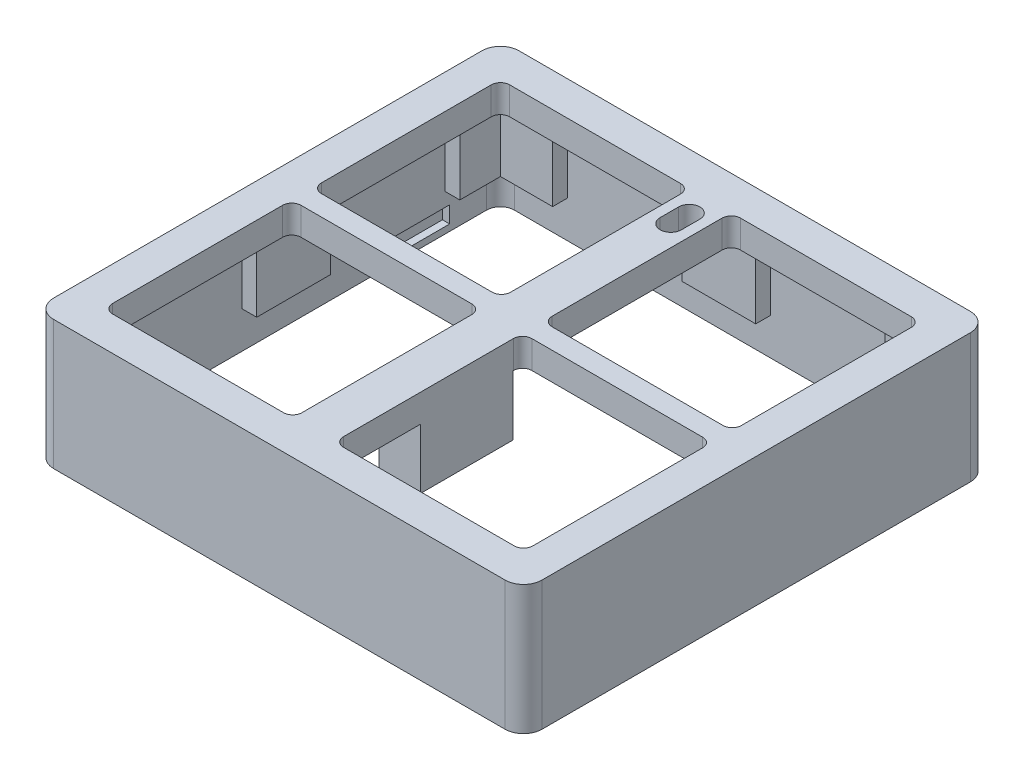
ISO-10303-21;
HEADER;
FILE_DESCRIPTION(('STEP AP214'),'2;1');
FILE_NAME('part.step','',(''),(''),'','','');
FILE_SCHEMA(('AUTOMOTIVE_DESIGN { 1 0 10303 214 1 1 1 1 }'));
ENDSEC;
DATA;
#1=APPLICATION_CONTEXT('core data for automotive mechanical design processes');
#2=APPLICATION_PROTOCOL_DEFINITION('international standard','automotive_design',2000,#1);
#3=PRODUCT_CONTEXT('',#1,'mechanical');
#4=PRODUCT('Part','Part','',(#3));
#5=PRODUCT_RELATED_PRODUCT_CATEGORY('part','',(#4));
#6=PRODUCT_DEFINITION_FORMATION('','',#4);
#7=PRODUCT_DEFINITION_CONTEXT('part definition',#1,'design');
#8=PRODUCT_DEFINITION('design','',#6,#7);
#9=PRODUCT_DEFINITION_SHAPE('','',#8);
#10=(LENGTH_UNIT() NAMED_UNIT(*) SI_UNIT(.MILLI.,.METRE.));
#11=(NAMED_UNIT(*) PLANE_ANGLE_UNIT() SI_UNIT($,.RADIAN.));
#12=(NAMED_UNIT(*) SI_UNIT($,.STERADIAN.) SOLID_ANGLE_UNIT());
#13=UNCERTAINTY_MEASURE_WITH_UNIT(LENGTH_MEASURE(1.E-05),#10,'distance_accuracy_value','');
#14=(GEOMETRIC_REPRESENTATION_CONTEXT(3) GLOBAL_UNCERTAINTY_ASSIGNED_CONTEXT((#13)) GLOBAL_UNIT_ASSIGNED_CONTEXT((#10,
#11,#12)) REPRESENTATION_CONTEXT('',''));
#15=CARTESIAN_POINT('',(0.,0.,0.));
#16=DIRECTION('',(0.,0.,1.));
#17=DIRECTION('',(1.,0.,0.));
#18=AXIS2_PLACEMENT_3D('',#15,#16,#17);
#19=CARTESIAN_POINT('',(23.65,83.6724479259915,-22.4));
#20=DIRECTION('',(1.,0.,0.));
#21=DIRECTION('',(0.,0.,-1.));
#22=AXIS2_PLACEMENT_3D('',#19,#20,#21);
#23=PLANE('',#22);
#24=DIRECTION('',(0.,1.,0.));
#25=VECTOR('',#24,1.);
#26=CARTESIAN_POINT('',(23.65,83.6724479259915,-3.99999999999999));
#27=LINE('',#26,#25);
#28=CARTESIAN_POINT('',(23.65,4.,-3.99999999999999));
#29=VERTEX_POINT('',#28);
#30=CARTESIAN_POINT('',(23.65,11.,-3.99999999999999));
#31=VERTEX_POINT('',#30);
#32=EDGE_CURVE('E1295',#29,#31,#27,.T.);
#33=ORIENTED_EDGE('',*,*,#32,.F.);
#34=DIRECTION('',(0.,0.,1.));
#35=VECTOR('',#34,1.);
#36=CARTESIAN_POINT('',(23.65,4.,-22.4));
#37=LINE('',#36,#35);
#38=CARTESIAN_POINT('',(23.65,4.,4.00000000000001));
#39=VERTEX_POINT('',#38);
#40=EDGE_CURVE('E1160',#29,#39,#37,.T.);
#41=ORIENTED_EDGE('',*,*,#40,.T.);
#42=DIRECTION('',(0.,-1.,0.));
#43=VECTOR('',#42,1.);
#44=CARTESIAN_POINT('',(23.65,83.6724479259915,4.00000000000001));
#45=LINE('',#44,#43);
#46=CARTESIAN_POINT('',(23.65,11.,4.00000000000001));
#47=VERTEX_POINT('',#46);
#48=EDGE_CURVE('E1290',#47,#39,#45,.T.);
#49=ORIENTED_EDGE('',*,*,#48,.F.);
#50=DIRECTION('',(0.,0.,1.));
#51=VECTOR('',#50,1.);
#52=CARTESIAN_POINT('',(23.65,11.,-22.4));
#53=LINE('',#52,#51);
#54=EDGE_CURVE('E1142',#31,#47,#53,.T.);
#55=ORIENTED_EDGE('',*,*,#54,.F.);
#56=EDGE_LOOP('',(#33,#41,#49,#55));
#57=FACE_BOUND('',#56,.T.);
#58=ADVANCED_FACE('F39',(#57),#23,.F.);
#59=DIRECTION('',(0.,-1.,0.));
#60=VECTOR('',#59,1.);
#61=CARTESIAN_POINT('',(23.65,83.6724479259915,-18.));
#62=LINE('',#61,#60);
#63=CARTESIAN_POINT('',(23.65,11.,-18.));
#64=VERTEX_POINT('',#63);
#65=CARTESIAN_POINT('',(23.65,4.,-18.));
#66=VERTEX_POINT('',#65);
#67=EDGE_CURVE('E1293',#64,#66,#62,.T.);
#68=ORIENTED_EDGE('',*,*,#67,.F.);
#69=CARTESIAN_POINT('',(23.65,11.,-22.4));
#70=VERTEX_POINT('',#69);
#71=EDGE_CURVE('E1139',#70,#64,#53,.T.);
#72=ORIENTED_EDGE('',*,*,#71,.F.);
#73=DIRECTION('',(0.,-1.,0.));
#74=VECTOR('',#73,1.);
#75=CARTESIAN_POINT('',(23.65,83.6724479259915,-22.4));
#76=LINE('',#75,#74);
#77=CARTESIAN_POINT('',(23.65,4.,-22.4));
#78=VERTEX_POINT('',#77);
#79=EDGE_CURVE('E1141',#70,#78,#76,.T.);
#80=ORIENTED_EDGE('',*,*,#79,.T.);
#81=EDGE_CURVE('E1161',#78,#66,#37,.T.);
#82=ORIENTED_EDGE('',*,*,#81,.T.);
#83=EDGE_LOOP('',(#68,#72,#80,#82));
#84=FACE_BOUND('',#83,.T.);
#85=ADVANCED_FACE('F1540',(#84),#23,.F.);
#86=DIRECTION('',(0.,1.,0.));
#87=VECTOR('',#86,1.);
#88=CARTESIAN_POINT('',(23.65,83.6724479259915,18.));
#89=LINE('',#88,#87);
#90=CARTESIAN_POINT('',(23.65,4.,18.));
#91=VERTEX_POINT('',#90);
#92=CARTESIAN_POINT('',(23.65,11.,18.));
#93=VERTEX_POINT('',#92);
#94=EDGE_CURVE('E1159',#91,#93,#89,.T.);
#95=ORIENTED_EDGE('',*,*,#94,.F.);
#96=CARTESIAN_POINT('',(23.65,4.,22.4));
#97=VERTEX_POINT('',#96);
#98=EDGE_CURVE('E1146',#91,#97,#37,.T.);
#99=ORIENTED_EDGE('',*,*,#98,.T.);
#100=DIRECTION('',(0.,-1.,0.));
#101=VECTOR('',#100,1.);
#102=CARTESIAN_POINT('',(23.65,83.6724479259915,22.4));
#103=LINE('',#102,#101);
#104=CARTESIAN_POINT('',(23.65,11.,22.4));
#105=VERTEX_POINT('',#104);
#106=EDGE_CURVE('E791',#105,#97,#103,.T.);
#107=ORIENTED_EDGE('',*,*,#106,.F.);
#108=EDGE_CURVE('E1137',#93,#105,#53,.T.);
#109=ORIENTED_EDGE('',*,*,#108,.F.);
#110=EDGE_LOOP('',(#95,#99,#107,#109));
#111=FACE_BOUND('',#110,.T.);
#112=ADVANCED_FACE('F1158',(#111),#23,.F.);
#113=CARTESIAN_POINT('',(-23.65,83.6724479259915,-22.4));
#114=DIRECTION('',(0.,0.,-1.));
#115=DIRECTION('',(-1.,0.,0.));
#116=AXIS2_PLACEMENT_3D('',#113,#114,#115);
#117=PLANE('',#116);
#118=DIRECTION('',(0.,1.,0.));
#119=VECTOR('',#118,1.);
#120=CARTESIAN_POINT('',(4.,-10.2214626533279,-22.4));
#121=LINE('',#120,#119);
#122=CARTESIAN_POINT('',(4.,4.,-22.4));
#123=VERTEX_POINT('',#122);
#124=CARTESIAN_POINT('',(4.,11.,-22.4));
#125=VERTEX_POINT('',#124);
#126=EDGE_CURVE('E2556',#123,#125,#121,.T.);
#127=ORIENTED_EDGE('',*,*,#126,.T.);
#128=DIRECTION('',(1.,0.,0.));
#129=VECTOR('',#128,1.);
#130=CARTESIAN_POINT('',(-23.65,11.,-22.4));
#131=LINE('',#130,#129);
#132=CARTESIAN_POINT('',(-4.,11.,-22.4));
#133=VERTEX_POINT('',#132);
#134=EDGE_CURVE('E1138',#133,#125,#131,.T.);
#135=ORIENTED_EDGE('',*,*,#134,.F.);
#136=DIRECTION('',(0.,1.,0.));
#137=VECTOR('',#136,1.);
#138=CARTESIAN_POINT('',(-4.,-10.2214626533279,-22.4));
#139=LINE('',#138,#137);
#140=CARTESIAN_POINT('',(-4.,4.,-22.4));
#141=VERTEX_POINT('',#140);
#142=EDGE_CURVE('E2569',#141,#133,#139,.T.);
#143=ORIENTED_EDGE('',*,*,#142,.F.);
#144=DIRECTION('',(1.,0.,0.));
#145=VECTOR('',#144,1.);
#146=CARTESIAN_POINT('',(-23.65,4.,-22.4));
#147=LINE('',#146,#145);
#148=EDGE_CURVE('E1175',#141,#123,#147,.T.);
#149=ORIENTED_EDGE('',*,*,#148,.T.);
#150=EDGE_LOOP('',(#127,#135,#143,#149));
#151=FACE_BOUND('',#150,.T.);
#152=ADVANCED_FACE('F1550',(#151),#117,.F.);
#153=DIRECTION('',(0.,1.,0.));
#154=VECTOR('',#153,1.);
#155=CARTESIAN_POINT('',(18.,-10.2214626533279,-22.4));
#156=LINE('',#155,#154);
#157=CARTESIAN_POINT('',(18.,4.,-22.4));
#158=VERTEX_POINT('',#157);
#159=CARTESIAN_POINT('',(18.,11.,-22.4));
#160=VERTEX_POINT('',#159);
#161=EDGE_CURVE('E2547',#158,#160,#156,.T.);
#162=ORIENTED_EDGE('',*,*,#161,.F.);
#163=EDGE_CURVE('E1169',#158,#78,#147,.T.);
#164=ORIENTED_EDGE('',*,*,#163,.T.);
#165=ORIENTED_EDGE('',*,*,#79,.F.);
#166=EDGE_CURVE('E1133',#160,#70,#131,.T.);
#167=ORIENTED_EDGE('',*,*,#166,.F.);
#168=EDGE_LOOP('',(#162,#164,#165,#167));
#169=FACE_BOUND('',#168,.T.);
#170=ADVANCED_FACE('F1554',(#169),#117,.F.);
#171=DIRECTION('',(0.,1.,0.));
#172=VECTOR('',#171,1.);
#173=CARTESIAN_POINT('',(-18.,-10.2214626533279,-22.4));
#174=LINE('',#173,#172);
#175=CARTESIAN_POINT('',(-18.,4.,-22.4));
#176=VERTEX_POINT('',#175);
#177=CARTESIAN_POINT('',(-18.,11.,-22.4));
#178=VERTEX_POINT('',#177);
#179=EDGE_CURVE('E1568',#176,#178,#174,.T.);
#180=ORIENTED_EDGE('',*,*,#179,.T.);
#181=CARTESIAN_POINT('',(-23.65,11.,-22.4));
#182=VERTEX_POINT('',#181);
#183=EDGE_CURVE('E1135',#182,#178,#131,.T.);
#184=ORIENTED_EDGE('',*,*,#183,.F.);
#185=DIRECTION('',(0.,-1.,0.));
#186=VECTOR('',#185,1.);
#187=CARTESIAN_POINT('',(-23.65,83.6724479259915,-22.4));
#188=LINE('',#187,#186);
#189=CARTESIAN_POINT('',(-23.65,4.,-22.4));
#190=VERTEX_POINT('',#189);
#191=EDGE_CURVE('E1164',#182,#190,#188,.T.);
#192=ORIENTED_EDGE('',*,*,#191,.T.);
#193=EDGE_CURVE('E1176',#190,#176,#147,.T.);
#194=ORIENTED_EDGE('',*,*,#193,.T.);
#195=EDGE_LOOP('',(#180,#184,#192,#194));
#196=FACE_BOUND('',#195,.T.);
#197=ADVANCED_FACE('F1556',(#196),#117,.F.);
#198=CARTESIAN_POINT('',(-23.65,83.6724479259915,-22.4));
#199=DIRECTION('',(-1.,0.,0.));
#200=DIRECTION('',(0.,0.,1.));
#201=AXIS2_PLACEMENT_3D('',#198,#199,#200);
#202=PLANE('',#201);
#203=DIRECTION('',(0.,1.,0.));
#204=VECTOR('',#203,1.);
#205=CARTESIAN_POINT('',(-23.65,83.6724479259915,-18.));
#206=LINE('',#205,#204);
#207=CARTESIAN_POINT('',(-23.65,4.,-18.));
#208=VERTEX_POINT('',#207);
#209=CARTESIAN_POINT('',(-23.65,11.,-18.));
#210=VERTEX_POINT('',#209);
#211=EDGE_CURVE('E1298',#208,#210,#206,.T.);
#212=ORIENTED_EDGE('',*,*,#211,.F.);
#213=DIRECTION('',(0.,0.,-1.));
#214=VECTOR('',#213,1.);
#215=CARTESIAN_POINT('',(-23.65,4.,-22.4));
#216=LINE('',#215,#214);
#217=EDGE_CURVE('E803',#208,#190,#216,.T.);
#218=ORIENTED_EDGE('',*,*,#217,.T.);
#219=ORIENTED_EDGE('',*,*,#191,.F.);
#220=DIRECTION('',(0.,0.,-1.));
#221=VECTOR('',#220,1.);
#222=CARTESIAN_POINT('',(-23.65,11.,-22.4));
#223=LINE('',#222,#221);
#224=EDGE_CURVE('E1129',#210,#182,#223,.T.);
#225=ORIENTED_EDGE('',*,*,#224,.F.);
#226=EDGE_LOOP('',(#212,#218,#219,#225));
#227=FACE_BOUND('',#226,.T.);
#228=ADVANCED_FACE('F1563',(#227),#202,.F.);
#229=DIRECTION('',(0.,-1.,0.));
#230=VECTOR('',#229,1.);
#231=CARTESIAN_POINT('',(-23.65,83.6724479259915,-4.));
#232=LINE('',#231,#230);
#233=CARTESIAN_POINT('',(-23.65,11.,-4.));
#234=VERTEX_POINT('',#233);
#235=CARTESIAN_POINT('',(-23.65,4.,-4.));
#236=VERTEX_POINT('',#235);
#237=EDGE_CURVE('E1196',#234,#236,#232,.T.);
#238=ORIENTED_EDGE('',*,*,#237,.F.);
#239=CARTESIAN_POINT('',(-23.65,11.,4.));
#240=VERTEX_POINT('',#239);
#241=EDGE_CURVE('E1134',#240,#234,#223,.T.);
#242=ORIENTED_EDGE('',*,*,#241,.F.);
#243=DIRECTION('',(0.,1.,0.));
#244=VECTOR('',#243,1.);
#245=CARTESIAN_POINT('',(-23.65,83.6724479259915,4.));
#246=LINE('',#245,#244);
#247=CARTESIAN_POINT('',(-23.65,4.,4.));
#248=VERTEX_POINT('',#247);
#249=EDGE_CURVE('E1198',#248,#240,#246,.T.);
#250=ORIENTED_EDGE('',*,*,#249,.F.);
#251=EDGE_CURVE('E802',#248,#236,#216,.T.);
#252=ORIENTED_EDGE('',*,*,#251,.T.);
#253=EDGE_LOOP('',(#238,#242,#250,#252));
#254=FACE_BOUND('',#253,.T.);
#255=ADVANCED_FACE('F1194',(#254),#202,.F.);
#256=DIRECTION('',(0.,-1.,0.));
#257=VECTOR('',#256,1.);
#258=CARTESIAN_POINT('',(-23.65,83.6724479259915,18.));
#259=LINE('',#258,#257);
#260=CARTESIAN_POINT('',(-23.65,11.,18.));
#261=VERTEX_POINT('',#260);
#262=CARTESIAN_POINT('',(-23.65,4.,18.));
#263=VERTEX_POINT('',#262);
#264=EDGE_CURVE('E1283',#261,#263,#259,.T.);
#265=ORIENTED_EDGE('',*,*,#264,.F.);
#266=CARTESIAN_POINT('',(-23.65,11.,22.4));
#267=VERTEX_POINT('',#266);
#268=EDGE_CURVE('E1130',#267,#261,#223,.T.);
#269=ORIENTED_EDGE('',*,*,#268,.F.);
#270=DIRECTION('',(0.,-1.,0.));
#271=VECTOR('',#270,1.);
#272=CARTESIAN_POINT('',(-23.65,83.6724479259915,22.4));
#273=LINE('',#272,#271);
#274=CARTESIAN_POINT('',(-23.65,4.,22.4));
#275=VERTEX_POINT('',#274);
#276=EDGE_CURVE('E805',#267,#275,#273,.T.);
#277=ORIENTED_EDGE('',*,*,#276,.T.);
#278=EDGE_CURVE('E797',#275,#263,#216,.T.);
#279=ORIENTED_EDGE('',*,*,#278,.T.);
#280=EDGE_LOOP('',(#265,#269,#277,#279));
#281=FACE_BOUND('',#280,.T.);
#282=ADVANCED_FACE('F1567',(#281),#202,.F.);
#283=CARTESIAN_POINT('',(-23.65,83.6724479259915,22.4));
#284=DIRECTION('',(0.,0.,1.));
#285=DIRECTION('',(1.,0.,0.));
#286=AXIS2_PLACEMENT_3D('',#283,#284,#285);
#287=PLANE('',#286);
#288=DIRECTION('',(0.,1.,0.));
#289=VECTOR('',#288,1.);
#290=CARTESIAN_POINT('',(-18.,-10.2214626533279,22.4));
#291=LINE('',#290,#289);
#292=CARTESIAN_POINT('',(-18.,4.,22.4));
#293=VERTEX_POINT('',#292);
#294=CARTESIAN_POINT('',(-18.,11.,22.4));
#295=VERTEX_POINT('',#294);
#296=EDGE_CURVE('E1262',#293,#295,#291,.T.);
#297=ORIENTED_EDGE('',*,*,#296,.F.);
#298=DIRECTION('',(-1.,0.,0.));
#299=VECTOR('',#298,1.);
#300=CARTESIAN_POINT('',(-23.65,4.,22.4));
#301=LINE('',#300,#299);
#302=EDGE_CURVE('E785',#293,#275,#301,.T.);
#303=ORIENTED_EDGE('',*,*,#302,.T.);
#304=ORIENTED_EDGE('',*,*,#276,.F.);
#305=DIRECTION('',(-1.,0.,0.));
#306=VECTOR('',#305,1.);
#307=CARTESIAN_POINT('',(-23.65,11.,22.4));
#308=LINE('',#307,#306);
#309=EDGE_CURVE('E1111',#295,#267,#308,.T.);
#310=ORIENTED_EDGE('',*,*,#309,.F.);
#311=EDGE_LOOP('',(#297,#303,#304,#310));
#312=FACE_BOUND('',#311,.T.);
#313=ADVANCED_FACE('F1782',(#312),#287,.F.);
#314=DIRECTION('',(0.,1.,0.));
#315=VECTOR('',#314,1.);
#316=CARTESIAN_POINT('',(-4.,-10.2214626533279,22.4));
#317=LINE('',#316,#315);
#318=CARTESIAN_POINT('',(-4.,4.,22.4));
#319=VERTEX_POINT('',#318);
#320=CARTESIAN_POINT('',(-4.,11.,22.4));
#321=VERTEX_POINT('',#320);
#322=EDGE_CURVE('E1259',#319,#321,#317,.T.);
#323=ORIENTED_EDGE('',*,*,#322,.T.);
#324=CARTESIAN_POINT('',(4.,11.,22.4));
#325=VERTEX_POINT('',#324);
#326=EDGE_CURVE('E1113',#325,#321,#308,.T.);
#327=ORIENTED_EDGE('',*,*,#326,.F.);
#328=DIRECTION('',(0.,1.,0.));
#329=VECTOR('',#328,1.);
#330=CARTESIAN_POINT('',(4.,-10.2214626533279,22.4));
#331=LINE('',#330,#329);
#332=CARTESIAN_POINT('',(4.,4.,22.4));
#333=VERTEX_POINT('',#332);
#334=EDGE_CURVE('E2527',#333,#325,#331,.T.);
#335=ORIENTED_EDGE('',*,*,#334,.F.);
#336=EDGE_CURVE('E783',#333,#319,#301,.T.);
#337=ORIENTED_EDGE('',*,*,#336,.T.);
#338=EDGE_LOOP('',(#323,#327,#335,#337));
#339=FACE_BOUND('',#338,.T.);
#340=ADVANCED_FACE('F1784',(#339),#287,.F.);
#341=DIRECTION('',(0.,1.,0.));
#342=VECTOR('',#341,1.);
#343=CARTESIAN_POINT('',(18.,-10.2214626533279,22.4));
#344=LINE('',#343,#342);
#345=CARTESIAN_POINT('',(18.,4.,22.4));
#346=VERTEX_POINT('',#345);
#347=CARTESIAN_POINT('',(18.,11.,22.4));
#348=VERTEX_POINT('',#347);
#349=EDGE_CURVE('E723',#346,#348,#344,.T.);
#350=ORIENTED_EDGE('',*,*,#349,.T.);
#351=EDGE_CURVE('E1115',#105,#348,#308,.T.);
#352=ORIENTED_EDGE('',*,*,#351,.F.);
#353=ORIENTED_EDGE('',*,*,#106,.T.);
#354=EDGE_CURVE('E779',#97,#346,#301,.T.);
#355=ORIENTED_EDGE('',*,*,#354,.T.);
#356=EDGE_LOOP('',(#350,#352,#353,#355));
#357=FACE_BOUND('',#356,.T.);
#358=ADVANCED_FACE('F1157',(#357),#287,.F.);
#359=CARTESIAN_POINT('',(0.,4.,0.));
#360=DIRECTION('',(0.,-1.,0.));
#361=DIRECTION('',(0.,0.,-1.));
#362=AXIS2_PLACEMENT_3D('',#359,#360,#361);
#363=PLANE('',#362);
#364=ORIENTED_EDGE('',*,*,#217,.F.);
#365=DIRECTION('',(1.,0.,0.));
#366=VECTOR('',#365,1.);
#367=CARTESIAN_POINT('',(-25.25,4.,-18.));
#368=LINE('',#367,#366);
#369=CARTESIAN_POINT('',(-25.25,4.,-18.));
#370=VERTEX_POINT('',#369);
#371=EDGE_CURVE('E1209',#370,#208,#368,.T.);
#372=ORIENTED_EDGE('',*,*,#371,.F.);
#373=DIRECTION('',(0.,0.,-1.));
#374=VECTOR('',#373,1.);
#375=CARTESIAN_POINT('',(-25.25,4.,24.));
#376=LINE('',#375,#374);
#377=CARTESIAN_POINT('',(-25.25,4.,-22.5));
#378=VERTEX_POINT('',#377);
#379=EDGE_CURVE('E774',#370,#378,#376,.T.);
#380=ORIENTED_EDGE('',*,*,#379,.T.);
#381=CARTESIAN_POINT('',(-23.75,4.,-22.5));
#382=DIRECTION('',(0.,-1.,0.));
#383=DIRECTION('',(0.,0.,-1.));
#384=AXIS2_PLACEMENT_3D('',#381,#382,#383);
#385=CIRCLE('',#384,1.5);
#386=CARTESIAN_POINT('',(-23.75,4.,-24.));
#387=VERTEX_POINT('',#386);
#388=EDGE_CURVE('E882',#378,#387,#385,.T.);
#389=ORIENTED_EDGE('',*,*,#388,.T.);
#390=DIRECTION('',(1.,0.,0.));
#391=VECTOR('',#390,1.);
#392=CARTESIAN_POINT('',(-25.25,4.,-24.));
#393=LINE('',#392,#391);
#394=CARTESIAN_POINT('',(-18.,4.,-24.));
#395=VERTEX_POINT('',#394);
#396=EDGE_CURVE('E756',#387,#395,#393,.T.);
#397=ORIENTED_EDGE('',*,*,#396,.T.);
#398=DIRECTION('',(0.,0.,-1.));
#399=VECTOR('',#398,1.);
#400=CARTESIAN_POINT('',(-18.,4.,-24.));
#401=LINE('',#400,#399);
#402=EDGE_CURVE('E2576',#176,#395,#401,.T.);
#403=ORIENTED_EDGE('',*,*,#402,.F.);
#404=ORIENTED_EDGE('',*,*,#193,.F.);
#405=EDGE_LOOP('',(#364,#372,#380,#389,#397,#403,#404));
#406=FACE_BOUND('',#405,.T.);
#407=ADVANCED_FACE('F1778',(#406),#363,.T.);
#408=CARTESIAN_POINT('',(-25.25,4.,4.));
#409=VERTEX_POINT('',#408);
#410=CARTESIAN_POINT('',(-25.25,4.,-4.));
#411=VERTEX_POINT('',#410);
#412=EDGE_CURVE('E773',#409,#411,#376,.T.);
#413=ORIENTED_EDGE('',*,*,#412,.T.);
#414=DIRECTION('',(-1.,0.,0.));
#415=VECTOR('',#414,1.);
#416=CARTESIAN_POINT('',(-25.25,4.,-4.));
#417=LINE('',#416,#415);
#418=EDGE_CURVE('E1205',#236,#411,#417,.T.);
#419=ORIENTED_EDGE('',*,*,#418,.F.);
#420=ORIENTED_EDGE('',*,*,#251,.F.);
#421=DIRECTION('',(1.,0.,0.));
#422=VECTOR('',#421,1.);
#423=CARTESIAN_POINT('',(-25.25,4.,4.));
#424=LINE('',#423,#422);
#425=EDGE_CURVE('E1203',#409,#248,#424,.T.);
#426=ORIENTED_EDGE('',*,*,#425,.F.);
#427=EDGE_LOOP('',(#413,#419,#420,#426));
#428=FACE_BOUND('',#427,.T.);
#429=ADVANCED_FACE('F1202',(#428),#363,.T.);
#430=ORIENTED_EDGE('',*,*,#40,.F.);
#431=DIRECTION('',(-1.,0.,0.));
#432=VECTOR('',#431,1.);
#433=CARTESIAN_POINT('',(25.25,4.,-3.99999999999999));
#434=LINE('',#433,#432);
#435=CARTESIAN_POINT('',(25.25,4.,-3.99999999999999));
#436=VERTEX_POINT('',#435);
#437=EDGE_CURVE('E1227',#436,#29,#434,.T.);
#438=ORIENTED_EDGE('',*,*,#437,.F.);
#439=DIRECTION('',(0.,0.,1.));
#440=VECTOR('',#439,1.);
#441=CARTESIAN_POINT('',(25.25,4.,-24.));
#442=LINE('',#441,#440);
#443=CARTESIAN_POINT('',(25.25,4.,4.00000000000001));
#444=VERTEX_POINT('',#443);
#445=EDGE_CURVE('E750',#436,#444,#442,.T.);
#446=ORIENTED_EDGE('',*,*,#445,.T.);
#447=DIRECTION('',(1.,0.,0.));
#448=VECTOR('',#447,1.);
#449=CARTESIAN_POINT('',(25.25,4.,4.00000000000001));
#450=LINE('',#449,#448);
#451=EDGE_CURVE('E1238',#39,#444,#450,.T.);
#452=ORIENTED_EDGE('',*,*,#451,.F.);
#453=EDGE_LOOP('',(#430,#438,#446,#452));
#454=FACE_BOUND('',#453,.T.);
#455=ADVANCED_FACE('F1805',(#454),#363,.T.);
#456=CARTESIAN_POINT('',(25.25,4.,-22.5));
#457=VERTEX_POINT('',#456);
#458=CARTESIAN_POINT('',(25.25,4.,-18.));
#459=VERTEX_POINT('',#458);
#460=EDGE_CURVE('E744',#457,#459,#442,.T.);
#461=ORIENTED_EDGE('',*,*,#460,.T.);
#462=DIRECTION('',(1.,0.,0.));
#463=VECTOR('',#462,1.);
#464=CARTESIAN_POINT('',(25.25,4.,-18.));
#465=LINE('',#464,#463);
#466=EDGE_CURVE('E1223',#66,#459,#465,.T.);
#467=ORIENTED_EDGE('',*,*,#466,.F.);
#468=ORIENTED_EDGE('',*,*,#81,.F.);
#469=ORIENTED_EDGE('',*,*,#163,.F.);
#470=DIRECTION('',(0.,0.,1.));
#471=VECTOR('',#470,1.);
#472=CARTESIAN_POINT('',(18.,4.,-24.));
#473=LINE('',#472,#471);
#474=CARTESIAN_POINT('',(18.,4.,-24.));
#475=VERTEX_POINT('',#474);
#476=EDGE_CURVE('E2539',#475,#158,#473,.T.);
#477=ORIENTED_EDGE('',*,*,#476,.F.);
#478=CARTESIAN_POINT('',(23.75,4.,-24.));
#479=VERTEX_POINT('',#478);
#480=EDGE_CURVE('E762',#475,#479,#393,.T.);
#481=ORIENTED_EDGE('',*,*,#480,.T.);
#482=CARTESIAN_POINT('',(23.75,4.,-22.5));
#483=DIRECTION('',(0.,-1.,0.));
#484=DIRECTION('',(0.,0.,-1.));
#485=AXIS2_PLACEMENT_3D('',#482,#483,#484);
#486=CIRCLE('',#485,1.5);
#487=EDGE_CURVE('E887',#479,#457,#486,.T.);
#488=ORIENTED_EDGE('',*,*,#487,.T.);
#489=EDGE_LOOP('',(#461,#467,#468,#469,#477,#481,#488));
#490=FACE_BOUND('',#489,.T.);
#491=ADVANCED_FACE('F1811',(#490),#363,.T.);
#492=ORIENTED_EDGE('',*,*,#98,.F.);
#493=DIRECTION('',(-1.,0.,0.));
#494=VECTOR('',#493,1.);
#495=CARTESIAN_POINT('',(25.25,4.,18.));
#496=LINE('',#495,#494);
#497=CARTESIAN_POINT('',(25.25,4.,18.));
#498=VERTEX_POINT('',#497);
#499=EDGE_CURVE('E1241',#498,#91,#496,.T.);
#500=ORIENTED_EDGE('',*,*,#499,.F.);
#501=CARTESIAN_POINT('',(25.25,4.,22.5));
#502=VERTEX_POINT('',#501);
#503=EDGE_CURVE('E751',#498,#502,#442,.T.);
#504=ORIENTED_EDGE('',*,*,#503,.T.);
#505=CARTESIAN_POINT('',(23.75,4.,22.5));
#506=DIRECTION('',(0.,-1.,0.));
#507=DIRECTION('',(0.,0.,-1.));
#508=AXIS2_PLACEMENT_3D('',#505,#506,#507);
#509=CIRCLE('',#508,1.5);
#510=CARTESIAN_POINT('',(23.75,4.,24.));
#511=VERTEX_POINT('',#510);
#512=EDGE_CURVE('E733',#502,#511,#509,.T.);
#513=ORIENTED_EDGE('',*,*,#512,.T.);
#514=DIRECTION('',(-1.,0.,0.));
#515=VECTOR('',#514,1.);
#516=CARTESIAN_POINT('',(25.25,4.,24.));
#517=LINE('',#516,#515);
#518=CARTESIAN_POINT('',(18.,4.,24.));
#519=VERTEX_POINT('',#518);
#520=EDGE_CURVE('E711',#511,#519,#517,.T.);
#521=ORIENTED_EDGE('',*,*,#520,.T.);
#522=DIRECTION('',(0.,0.,1.));
#523=VECTOR('',#522,1.);
#524=CARTESIAN_POINT('',(18.,4.,24.));
#525=LINE('',#524,#523);
#526=EDGE_CURVE('E720',#346,#519,#525,.T.);
#527=ORIENTED_EDGE('',*,*,#526,.F.);
#528=ORIENTED_EDGE('',*,*,#354,.F.);
#529=EDGE_LOOP('',(#492,#500,#504,#513,#521,#527,#528));
#530=FACE_BOUND('',#529,.T.);
#531=ADVANCED_FACE('F731',(#530),#363,.T.);
#532=ORIENTED_EDGE('',*,*,#302,.F.);
#533=DIRECTION('',(0.,0.,-1.));
#534=VECTOR('',#533,1.);
#535=CARTESIAN_POINT('',(-18.,4.,24.));
#536=LINE('',#535,#534);
#537=CARTESIAN_POINT('',(-18.,4.,24.));
#538=VERTEX_POINT('',#537);
#539=EDGE_CURVE('E1254',#538,#293,#536,.T.);
#540=ORIENTED_EDGE('',*,*,#539,.F.);
#541=CARTESIAN_POINT('',(-23.75,4.,24.));
#542=VERTEX_POINT('',#541);
#543=EDGE_CURVE('E737',#538,#542,#517,.T.);
#544=ORIENTED_EDGE('',*,*,#543,.T.);
#545=CARTESIAN_POINT('',(-23.75,4.,22.5));
#546=DIRECTION('',(0.,-1.,0.));
#547=DIRECTION('',(0.,0.,-1.));
#548=AXIS2_PLACEMENT_3D('',#545,#546,#547);
#549=CIRCLE('',#548,1.5);
#550=CARTESIAN_POINT('',(-25.25,4.,22.5));
#551=VERTEX_POINT('',#550);
#552=EDGE_CURVE('E884',#542,#551,#549,.T.);
#553=ORIENTED_EDGE('',*,*,#552,.T.);
#554=CARTESIAN_POINT('',(-25.25,4.,18.));
#555=VERTEX_POINT('',#554);
#556=EDGE_CURVE('E768',#551,#555,#376,.T.);
#557=ORIENTED_EDGE('',*,*,#556,.T.);
#558=DIRECTION('',(-1.,0.,0.));
#559=VECTOR('',#558,1.);
#560=CARTESIAN_POINT('',(-25.25,4.,18.));
#561=LINE('',#560,#559);
#562=EDGE_CURVE('E1274',#263,#555,#561,.T.);
#563=ORIENTED_EDGE('',*,*,#562,.F.);
#564=ORIENTED_EDGE('',*,*,#278,.F.);
#565=EDGE_LOOP('',(#532,#540,#544,#553,#557,#563,#564));
#566=FACE_BOUND('',#565,.T.);
#567=ADVANCED_FACE('F1823',(#566),#363,.T.);
#568=CARTESIAN_POINT('',(4.,4.,24.));
#569=VERTEX_POINT('',#568);
#570=CARTESIAN_POINT('',(-4.,4.,24.));
#571=VERTEX_POINT('',#570);
#572=EDGE_CURVE('E735',#569,#571,#517,.T.);
#573=ORIENTED_EDGE('',*,*,#572,.T.);
#574=DIRECTION('',(0.,0.,1.));
#575=VECTOR('',#574,1.);
#576=CARTESIAN_POINT('',(-4.,4.,24.));
#577=LINE('',#576,#575);
#578=EDGE_CURVE('E1250',#319,#571,#577,.T.);
#579=ORIENTED_EDGE('',*,*,#578,.F.);
#580=ORIENTED_EDGE('',*,*,#336,.F.);
#581=DIRECTION('',(0.,0.,-1.));
#582=VECTOR('',#581,1.);
#583=CARTESIAN_POINT('',(4.,4.,24.));
#584=LINE('',#583,#582);
#585=EDGE_CURVE('E728',#569,#333,#584,.T.);
#586=ORIENTED_EDGE('',*,*,#585,.F.);
#587=EDGE_LOOP('',(#573,#579,#580,#586));
#588=FACE_BOUND('',#587,.T.);
#589=ADVANCED_FACE('F1829',(#588),#363,.T.);
#590=CARTESIAN_POINT('',(-4.,4.,-24.));
#591=VERTEX_POINT('',#590);
#592=CARTESIAN_POINT('',(4.,4.,-24.));
#593=VERTEX_POINT('',#592);
#594=EDGE_CURVE('E761',#591,#593,#393,.T.);
#595=ORIENTED_EDGE('',*,*,#594,.T.);
#596=DIRECTION('',(0.,0.,-1.));
#597=VECTOR('',#596,1.);
#598=CARTESIAN_POINT('',(4.,4.,-24.));
#599=LINE('',#598,#597);
#600=EDGE_CURVE('E2558',#123,#593,#599,.T.);
#601=ORIENTED_EDGE('',*,*,#600,.F.);
#602=ORIENTED_EDGE('',*,*,#148,.F.);
#603=DIRECTION('',(0.,0.,1.));
#604=VECTOR('',#603,1.);
#605=CARTESIAN_POINT('',(-4.,4.,-24.));
#606=LINE('',#605,#604);
#607=EDGE_CURVE('E2566',#591,#141,#606,.T.);
#608=ORIENTED_EDGE('',*,*,#607,.F.);
#609=EDGE_LOOP('',(#595,#601,#602,#608));
#610=FACE_BOUND('',#609,.T.);
#611=ADVANCED_FACE('F1781',(#610),#363,.T.);
#612=CARTESIAN_POINT('',(0.,14.,0.));
#613=DIRECTION('',(0.,1.,0.));
#614=DIRECTION('',(0.,0.,1.));
#615=AXIS2_PLACEMENT_3D('',#612,#613,#614);
#616=PLANE('',#615);
#617=CARTESIAN_POINT('',(0.,14.,-19.2));
#618=DIRECTION('',(0.,1.,0.));
#619=DIRECTION('',(0.,0.,1.));
#620=AXIS2_PLACEMENT_3D('',#617,#618,#619);
#621=CIRCLE('',#620,1.15);
#622=CARTESIAN_POINT('',(1.15,14.,-19.2));
#623=VERTEX_POINT('',#622);
#624=CARTESIAN_POINT('',(-1.15,14.,-19.2));
#625=VERTEX_POINT('',#624);
#626=EDGE_CURVE('E1422',#623,#625,#621,.T.);
#627=ORIENTED_EDGE('',*,*,#626,.F.);
#628=DIRECTION('',(0.,0.,-1.));
#629=VECTOR('',#628,1.);
#630=CARTESIAN_POINT('',(1.15,14.,-19.2));
#631=LINE('',#630,#629);
#632=CARTESIAN_POINT('',(1.15,14.,-17.2));
#633=VERTEX_POINT('',#632);
#634=EDGE_CURVE('E1432',#633,#623,#631,.T.);
#635=ORIENTED_EDGE('',*,*,#634,.F.);
#636=CARTESIAN_POINT('',(0.,14.,-17.2));
#637=DIRECTION('',(0.,1.,0.));
#638=DIRECTION('',(0.,0.,1.));
#639=AXIS2_PLACEMENT_3D('',#636,#637,#638);
#640=CIRCLE('',#639,1.15);
#641=CARTESIAN_POINT('',(-1.15,14.,-17.2));
#642=VERTEX_POINT('',#641);
#643=EDGE_CURVE('E1429',#642,#633,#640,.T.);
#644=ORIENTED_EDGE('',*,*,#643,.F.);
#645=DIRECTION('',(0.,0.,1.));
#646=VECTOR('',#645,1.);
#647=CARTESIAN_POINT('',(-1.15,14.,-19.2));
#648=LINE('',#647,#646);
#649=EDGE_CURVE('E1426',#625,#642,#648,.T.);
#650=ORIENTED_EDGE('',*,*,#649,.F.);
#651=EDGE_LOOP('',(#627,#635,#644,#650));
#652=FACE_BOUND('',#651,.T.);
#653=DIRECTION('',(0.,0.,-1.));
#654=VECTOR('',#653,1.);
#655=CARTESIAN_POINT('',(26.45,14.,25.2));
#656=LINE('',#655,#654);
#657=CARTESIAN_POINT('',(26.45,14.,23.2));
#658=VERTEX_POINT('',#657);
#659=CARTESIAN_POINT('',(26.45,14.,-23.2));
#660=VERTEX_POINT('',#659);
#661=EDGE_CURVE('E817',#658,#660,#656,.T.);
#662=ORIENTED_EDGE('',*,*,#661,.T.);
#663=CARTESIAN_POINT('',(24.45,14.,-23.2));
#664=DIRECTION('',(0.,1.,0.));
#665=DIRECTION('',(0.,0.,1.));
#666=AXIS2_PLACEMENT_3D('',#663,#664,#665);
#667=CIRCLE('',#666,2.);
#668=CARTESIAN_POINT('',(24.45,14.,-25.2));
#669=VERTEX_POINT('',#668);
#670=EDGE_CURVE('E862',#660,#669,#667,.T.);
#671=ORIENTED_EDGE('',*,*,#670,.T.);
#672=DIRECTION('',(-1.,0.,0.));
#673=VECTOR('',#672,1.);
#674=CARTESIAN_POINT('',(26.45,14.,-25.2));
#675=LINE('',#674,#673);
#676=CARTESIAN_POINT('',(-24.45,14.,-25.2));
#677=VERTEX_POINT('',#676);
#678=EDGE_CURVE('E820',#669,#677,#675,.T.);
#679=ORIENTED_EDGE('',*,*,#678,.T.);
#680=CARTESIAN_POINT('',(-24.45,14.,-23.2));
#681=DIRECTION('',(0.,1.,0.));
#682=DIRECTION('',(0.,0.,1.));
#683=AXIS2_PLACEMENT_3D('',#680,#681,#682);
#684=CIRCLE('',#683,2.);
#685=CARTESIAN_POINT('',(-26.45,14.,-23.2));
#686=VERTEX_POINT('',#685);
#687=EDGE_CURVE('E856',#677,#686,#684,.T.);
#688=ORIENTED_EDGE('',*,*,#687,.T.);
#689=DIRECTION('',(0.,0.,1.));
#690=VECTOR('',#689,1.);
#691=CARTESIAN_POINT('',(-26.45,14.,25.2));
#692=LINE('',#691,#690);
#693=CARTESIAN_POINT('',(-26.45,14.,23.2));
#694=VERTEX_POINT('',#693);
#695=EDGE_CURVE('E824',#686,#694,#692,.T.);
#696=ORIENTED_EDGE('',*,*,#695,.T.);
#697=CARTESIAN_POINT('',(-24.45,14.,23.2));
#698=DIRECTION('',(0.,1.,0.));
#699=DIRECTION('',(0.,0.,1.));
#700=AXIS2_PLACEMENT_3D('',#697,#698,#699);
#701=CIRCLE('',#700,2.);
#702=CARTESIAN_POINT('',(-24.45,14.,25.2));
#703=VERTEX_POINT('',#702);
#704=EDGE_CURVE('E858',#694,#703,#701,.T.);
#705=ORIENTED_EDGE('',*,*,#704,.T.);
#706=DIRECTION('',(1.,0.,0.));
#707=VECTOR('',#706,1.);
#708=CARTESIAN_POINT('',(26.45,14.,25.2));
#709=LINE('',#708,#707);
#710=CARTESIAN_POINT('',(24.45,14.,25.2));
#711=VERTEX_POINT('',#710);
#712=EDGE_CURVE('E827',#703,#711,#709,.T.);
#713=ORIENTED_EDGE('',*,*,#712,.T.);
#714=CARTESIAN_POINT('',(24.45,14.,23.2));
#715=DIRECTION('',(0.,1.,0.));
#716=DIRECTION('',(0.,0.,1.));
#717=AXIS2_PLACEMENT_3D('',#714,#715,#716);
#718=CIRCLE('',#717,2.);
#719=EDGE_CURVE('E860',#711,#658,#718,.T.);
#720=ORIENTED_EDGE('',*,*,#719,.T.);
#721=EDGE_LOOP('',(#662,#671,#679,#688,#696,#705,#713,#720));
#722=FACE_BOUND('',#721,.T.);
#723=DIRECTION('',(0.,0.,1.));
#724=VECTOR('',#723,1.);
#725=CARTESIAN_POINT('',(-22.75,14.,-1.1));
#726=LINE('',#725,#724);
#727=CARTESIAN_POINT('',(-22.75,14.,-20.5));
#728=VERTEX_POINT('',#727);
#729=CARTESIAN_POINT('',(-22.75,14.,-2.1));
#730=VERTEX_POINT('',#729);
#731=EDGE_CURVE('E1120',#728,#730,#726,.T.);
#732=ORIENTED_EDGE('',*,*,#731,.F.);
#733=CARTESIAN_POINT('',(-21.75,14.,-20.5));
#734=DIRECTION('',(0.,1.,0.));
#735=DIRECTION('',(0.,0.,1.));
#736=AXIS2_PLACEMENT_3D('',#733,#734,#735);
#737=CIRCLE('',#736,1.);
#738=CARTESIAN_POINT('',(-21.75,14.,-21.5));
#739=VERTEX_POINT('',#738);
#740=EDGE_CURVE('E1076',#728,#739,#737,.F.);
#741=ORIENTED_EDGE('',*,*,#740,.T.);
#742=DIRECTION('',(-1.,0.,0.));
#743=VECTOR('',#742,1.);
#744=CARTESIAN_POINT('',(-2.25,14.,-21.5));
#745=LINE('',#744,#743);
#746=CARTESIAN_POINT('',(-3.25,14.,-21.5));
#747=VERTEX_POINT('',#746);
#748=EDGE_CURVE('E1088',#747,#739,#745,.T.);
#749=ORIENTED_EDGE('',*,*,#748,.F.);
#750=CARTESIAN_POINT('',(-3.25,14.,-20.5));
#751=DIRECTION('',(0.,1.,0.));
#752=DIRECTION('',(0.,0.,1.));
#753=AXIS2_PLACEMENT_3D('',#750,#751,#752);
#754=CIRCLE('',#753,1.);
#755=CARTESIAN_POINT('',(-2.25,14.,-20.5));
#756=VERTEX_POINT('',#755);
#757=EDGE_CURVE('E47',#747,#756,#754,.F.);
#758=ORIENTED_EDGE('',*,*,#757,.T.);
#759=DIRECTION('',(0.,0.,-1.));
#760=VECTOR('',#759,1.);
#761=CARTESIAN_POINT('',(-2.25,14.,-21.5));
#762=LINE('',#761,#760);
#763=CARTESIAN_POINT('',(-2.25,14.,-2.1));
#764=VERTEX_POINT('',#763);
#765=EDGE_CURVE('E1086',#764,#756,#762,.T.);
#766=ORIENTED_EDGE('',*,*,#765,.F.);
#767=CARTESIAN_POINT('',(-3.25,14.,-2.1));
#768=DIRECTION('',(0.,1.,0.));
#769=DIRECTION('',(0.,0.,1.));
#770=AXIS2_PLACEMENT_3D('',#767,#768,#769);
#771=CIRCLE('',#770,1.);
#772=CARTESIAN_POINT('',(-3.25,14.,-1.1));
#773=VERTEX_POINT('',#772);
#774=EDGE_CURVE('E1072',#764,#773,#771,.F.);
#775=ORIENTED_EDGE('',*,*,#774,.T.);
#776=DIRECTION('',(1.,0.,0.));
#777=VECTOR('',#776,1.);
#778=CARTESIAN_POINT('',(-22.75,14.,-1.1));
#779=LINE('',#778,#777);
#780=CARTESIAN_POINT('',(-21.75,14.,-1.1));
#781=VERTEX_POINT('',#780);
#782=EDGE_CURVE('E1097',#781,#773,#779,.T.);
#783=ORIENTED_EDGE('',*,*,#782,.F.);
#784=CARTESIAN_POINT('',(-21.75,14.,-2.1));
#785=DIRECTION('',(0.,1.,0.));
#786=DIRECTION('',(0.,0.,1.));
#787=AXIS2_PLACEMENT_3D('',#784,#785,#786);
#788=CIRCLE('',#787,1.);
#789=EDGE_CURVE('E1068',#781,#730,#788,.F.);
#790=ORIENTED_EDGE('',*,*,#789,.T.);
#791=EDGE_LOOP('',(#732,#741,#749,#758,#766,#775,#783,#790));
#792=FACE_BOUND('',#791,.T.);
#793=DIRECTION('',(0.,0.,-1.));
#794=VECTOR('',#793,1.);
#795=CARTESIAN_POINT('',(22.75,14.,21.5));
#796=LINE('',#795,#794);
#797=CARTESIAN_POINT('',(22.75,14.,20.5));
#798=VERTEX_POINT('',#797);
#799=CARTESIAN_POINT('',(22.75,14.,2.1));
#800=VERTEX_POINT('',#799);
#801=EDGE_CURVE('E1480',#798,#800,#796,.T.);
#802=ORIENTED_EDGE('',*,*,#801,.F.);
#803=CARTESIAN_POINT('',(21.75,14.,20.5));
#804=DIRECTION('',(0.,1.,0.));
#805=DIRECTION('',(0.,0.,1.));
#806=AXIS2_PLACEMENT_3D('',#803,#804,#805);
#807=CIRCLE('',#806,1.);
#808=CARTESIAN_POINT('',(21.75,14.,21.5));
#809=VERTEX_POINT('',#808);
#810=EDGE_CURVE('E1044',#798,#809,#807,.F.);
#811=ORIENTED_EDGE('',*,*,#810,.T.);
#812=DIRECTION('',(1.,0.,0.));
#813=VECTOR('',#812,1.);
#814=CARTESIAN_POINT('',(22.75,14.,21.5));
#815=LINE('',#814,#813);
#816=CARTESIAN_POINT('',(3.25000000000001,14.,21.5));
#817=VERTEX_POINT('',#816);
#818=EDGE_CURVE('E1494',#817,#809,#815,.T.);
#819=ORIENTED_EDGE('',*,*,#818,.F.);
#820=CARTESIAN_POINT('',(3.25000000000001,14.,20.5));
#821=DIRECTION('',(0.,1.,0.));
#822=DIRECTION('',(0.,0.,1.));
#823=AXIS2_PLACEMENT_3D('',#820,#821,#822);
#824=CIRCLE('',#823,1.);
#825=CARTESIAN_POINT('',(2.25,14.,20.5));
#826=VERTEX_POINT('',#825);
#827=EDGE_CURVE('E1048',#817,#826,#824,.F.);
#828=ORIENTED_EDGE('',*,*,#827,.T.);
#829=DIRECTION('',(0.,0.,1.));
#830=VECTOR('',#829,1.);
#831=CARTESIAN_POINT('',(2.25,14.,1.1));
#832=LINE('',#831,#830);
#833=CARTESIAN_POINT('',(2.25,14.,2.1));
#834=VERTEX_POINT('',#833);
#835=EDGE_CURVE('E1507',#834,#826,#832,.T.);
#836=ORIENTED_EDGE('',*,*,#835,.F.);
#837=CARTESIAN_POINT('',(3.25,14.,2.1));
#838=DIRECTION('',(0.,1.,0.));
#839=DIRECTION('',(0.,0.,1.));
#840=AXIS2_PLACEMENT_3D('',#837,#838,#839);
#841=CIRCLE('',#840,1.);
#842=CARTESIAN_POINT('',(3.25,14.,1.1));
#843=VERTEX_POINT('',#842);
#844=EDGE_CURVE('E1036',#834,#843,#841,.F.);
#845=ORIENTED_EDGE('',*,*,#844,.T.);
#846=DIRECTION('',(-1.,0.,0.));
#847=VECTOR('',#846,1.);
#848=CARTESIAN_POINT('',(2.25,14.,1.1));
#849=LINE('',#848,#847);
#850=CARTESIAN_POINT('',(21.75,14.,1.1));
#851=VERTEX_POINT('',#850);
#852=EDGE_CURVE('E1504',#851,#843,#849,.T.);
#853=ORIENTED_EDGE('',*,*,#852,.F.);
#854=CARTESIAN_POINT('',(21.75,14.,2.1));
#855=DIRECTION('',(0.,1.,0.));
#856=DIRECTION('',(0.,0.,1.));
#857=AXIS2_PLACEMENT_3D('',#854,#855,#856);
#858=CIRCLE('',#857,1.);
#859=EDGE_CURVE('E1040',#851,#800,#858,.F.);
#860=ORIENTED_EDGE('',*,*,#859,.T.);
#861=EDGE_LOOP('',(#802,#811,#819,#828,#836,#845,#853,#860));
#862=FACE_BOUND('',#861,.T.);
#863=DIRECTION('',(-1.,0.,0.));
#864=VECTOR('',#863,1.);
#865=CARTESIAN_POINT('',(22.75,14.,-21.5));
#866=LINE('',#865,#864);
#867=CARTESIAN_POINT('',(21.75,14.,-21.5));
#868=VERTEX_POINT('',#867);
#869=CARTESIAN_POINT('',(3.25,14.,-21.5));
#870=VERTEX_POINT('',#869);
#871=EDGE_CURVE('E1457',#868,#870,#866,.T.);
#872=ORIENTED_EDGE('',*,*,#871,.F.);
#873=CARTESIAN_POINT('',(21.75,14.,-20.5));
#874=DIRECTION('',(0.,1.,0.));
#875=DIRECTION('',(0.,0.,1.));
#876=AXIS2_PLACEMENT_3D('',#873,#874,#875);
#877=CIRCLE('',#876,1.);
#878=CARTESIAN_POINT('',(22.75,14.,-20.5));
#879=VERTEX_POINT('',#878);
#880=EDGE_CURVE('E1024',#868,#879,#877,.F.);
#881=ORIENTED_EDGE('',*,*,#880,.T.);
#882=DIRECTION('',(0.,0.,-1.));
#883=VECTOR('',#882,1.);
#884=CARTESIAN_POINT('',(22.75,14.,-1.1));
#885=LINE('',#884,#883);
#886=CARTESIAN_POINT('',(22.75,14.,-2.1));
#887=VERTEX_POINT('',#886);
#888=EDGE_CURVE('E1472',#887,#879,#885,.T.);
#889=ORIENTED_EDGE('',*,*,#888,.F.);
#890=CARTESIAN_POINT('',(21.75,14.,-2.1));
#891=DIRECTION('',(0.,1.,0.));
#892=DIRECTION('',(0.,0.,1.));
#893=AXIS2_PLACEMENT_3D('',#890,#891,#892);
#894=CIRCLE('',#893,1.);
#895=CARTESIAN_POINT('',(21.75,14.,-1.1));
#896=VERTEX_POINT('',#895);
#897=EDGE_CURVE('E1028',#887,#896,#894,.F.);
#898=ORIENTED_EDGE('',*,*,#897,.T.);
#899=DIRECTION('',(1.,0.,0.));
#900=VECTOR('',#899,1.);
#901=CARTESIAN_POINT('',(2.25,14.,-1.1));
#902=LINE('',#901,#900);
#903=CARTESIAN_POINT('',(3.25,14.,-1.1));
#904=VERTEX_POINT('',#903);
#905=EDGE_CURVE('E1486',#904,#896,#902,.T.);
#906=ORIENTED_EDGE('',*,*,#905,.F.);
#907=CARTESIAN_POINT('',(3.25,14.,-2.1));
#908=DIRECTION('',(0.,1.,0.));
#909=DIRECTION('',(0.,0.,1.));
#910=AXIS2_PLACEMENT_3D('',#907,#908,#909);
#911=CIRCLE('',#910,1.);
#912=CARTESIAN_POINT('',(2.25,14.,-2.1));
#913=VERTEX_POINT('',#912);
#914=EDGE_CURVE('E1032',#904,#913,#911,.F.);
#915=ORIENTED_EDGE('',*,*,#914,.T.);
#916=DIRECTION('',(0.,0.,1.));
#917=VECTOR('',#916,1.);
#918=CARTESIAN_POINT('',(2.25,14.,-21.5));
#919=LINE('',#918,#917);
#920=CARTESIAN_POINT('',(2.25,14.,-20.5));
#921=VERTEX_POINT('',#920);
#922=EDGE_CURVE('E1483',#921,#913,#919,.T.);
#923=ORIENTED_EDGE('',*,*,#922,.F.);
#924=CARTESIAN_POINT('',(3.25,14.,-20.5));
#925=DIRECTION('',(0.,1.,0.));
#926=DIRECTION('',(0.,0.,1.));
#927=AXIS2_PLACEMENT_3D('',#924,#925,#926);
#928=CIRCLE('',#927,1.);
#929=EDGE_CURVE('E1020',#921,#870,#928,.F.);
#930=ORIENTED_EDGE('',*,*,#929,.T.);
#931=EDGE_LOOP('',(#872,#881,#889,#898,#906,#915,#923,#930));
#932=FACE_BOUND('',#931,.T.);
#933=DIRECTION('',(0.,0.,1.));
#934=VECTOR('',#933,1.);
#935=CARTESIAN_POINT('',(-22.75,14.,21.5));
#936=LINE('',#935,#934);
#937=CARTESIAN_POINT('',(-22.75,14.,2.1));
#938=VERTEX_POINT('',#937);
#939=CARTESIAN_POINT('',(-22.75,14.,20.5));
#940=VERTEX_POINT('',#939);
#941=EDGE_CURVE('E1438',#938,#940,#936,.T.);
#942=ORIENTED_EDGE('',*,*,#941,.F.);
#943=CARTESIAN_POINT('',(-21.75,14.,2.1));
#944=DIRECTION('',(0.,1.,0.));
#945=DIRECTION('',(0.,0.,1.));
#946=AXIS2_PLACEMENT_3D('',#943,#944,#945);
#947=CIRCLE('',#946,1.);
#948=CARTESIAN_POINT('',(-21.75,14.,1.1));
#949=VERTEX_POINT('',#948);
#950=EDGE_CURVE('E1060',#938,#949,#947,.F.);
#951=ORIENTED_EDGE('',*,*,#950,.T.);
#952=DIRECTION('',(-1.,0.,0.));
#953=VECTOR('',#952,1.);
#954=CARTESIAN_POINT('',(-22.75,14.,1.1));
#955=LINE('',#954,#953);
#956=CARTESIAN_POINT('',(-3.25,14.,1.1));
#957=VERTEX_POINT('',#956);
#958=EDGE_CURVE('E1448',#957,#949,#955,.T.);
#959=ORIENTED_EDGE('',*,*,#958,.F.);
#960=CARTESIAN_POINT('',(-3.25,14.,2.1));
#961=DIRECTION('',(0.,1.,0.));
#962=DIRECTION('',(0.,0.,1.));
#963=AXIS2_PLACEMENT_3D('',#960,#961,#962);
#964=CIRCLE('',#963,1.);
#965=CARTESIAN_POINT('',(-2.25,14.,2.1));
#966=VERTEX_POINT('',#965);
#967=EDGE_CURVE('E1056',#957,#966,#964,.F.);
#968=ORIENTED_EDGE('',*,*,#967,.T.);
#969=DIRECTION('',(0.,0.,-1.));
#970=VECTOR('',#969,1.);
#971=CARTESIAN_POINT('',(-2.25,14.,1.1));
#972=LINE('',#971,#970);
#973=CARTESIAN_POINT('',(-2.24999999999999,14.,20.5));
#974=VERTEX_POINT('',#973);
#975=EDGE_CURVE('E1463',#974,#966,#972,.T.);
#976=ORIENTED_EDGE('',*,*,#975,.F.);
#977=CARTESIAN_POINT('',(-3.24999999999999,14.,20.5));
#978=DIRECTION('',(0.,1.,0.));
#979=DIRECTION('',(0.,0.,1.));
#980=AXIS2_PLACEMENT_3D('',#977,#978,#979);
#981=CIRCLE('',#980,1.);
#982=CARTESIAN_POINT('',(-3.24999999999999,14.,21.5));
#983=VERTEX_POINT('',#982);
#984=EDGE_CURVE('E1052',#974,#983,#981,.F.);
#985=ORIENTED_EDGE('',*,*,#984,.T.);
#986=DIRECTION('',(1.,0.,0.));
#987=VECTOR('',#986,1.);
#988=CARTESIAN_POINT('',(-2.24999999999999,14.,21.5));
#989=LINE('',#988,#987);
#990=CARTESIAN_POINT('',(-21.75,14.,21.5));
#991=VERTEX_POINT('',#990);
#992=EDGE_CURVE('E1460',#991,#983,#989,.T.);
#993=ORIENTED_EDGE('',*,*,#992,.F.);
#994=CARTESIAN_POINT('',(-21.75,14.,20.5));
#995=DIRECTION('',(0.,1.,0.));
#996=DIRECTION('',(0.,0.,1.));
#997=AXIS2_PLACEMENT_3D('',#994,#995,#996);
#998=CIRCLE('',#997,1.);
#999=EDGE_CURVE('E1064',#991,#940,#998,.F.);
#1000=ORIENTED_EDGE('',*,*,#999,.T.);
#1001=EDGE_LOOP('',(#942,#951,#959,#968,#976,#985,#993,#1000));
#1002=FACE_BOUND('',#1001,.T.);
#1003=ADVANCED_FACE('F1084',(#652,#722,#792,#862,#932,#1002),#616,.T.);
#1004=CARTESIAN_POINT('',(0.,0.,0.));
#1005=DIRECTION('',(0.,1.,0.));
#1006=DIRECTION('',(0.,0.,1.));
#1007=AXIS2_PLACEMENT_3D('',#1004,#1005,#1006);
#1008=PLANE('',#1007);
#1009=DIRECTION('',(-1.,0.,0.));
#1010=VECTOR('',#1009,1.);
#1011=CARTESIAN_POINT('',(26.45,0.,-25.2));
#1012=LINE('',#1011,#1010);
#1013=CARTESIAN_POINT('',(24.45,0.,-25.2));
#1014=VERTEX_POINT('',#1013);
#1015=CARTESIAN_POINT('',(-24.45,0.,-25.2));
#1016=VERTEX_POINT('',#1015);
#1017=EDGE_CURVE('E833',#1014,#1016,#1012,.T.);
#1018=ORIENTED_EDGE('',*,*,#1017,.F.);
#1019=CARTESIAN_POINT('',(24.45,0.,-23.2));
#1020=DIRECTION('',(0.,1.,0.));
#1021=DIRECTION('',(0.,0.,1.));
#1022=AXIS2_PLACEMENT_3D('',#1019,#1020,#1021);
#1023=CIRCLE('',#1022,2.);
#1024=CARTESIAN_POINT('',(26.45,0.,-23.2));
#1025=VERTEX_POINT('',#1024);
#1026=EDGE_CURVE('E850',#1014,#1025,#1023,.F.);
#1027=ORIENTED_EDGE('',*,*,#1026,.T.);
#1028=DIRECTION('',(0.,0.,-1.));
#1029=VECTOR('',#1028,1.);
#1030=CARTESIAN_POINT('',(26.45,0.,25.2));
#1031=LINE('',#1030,#1029);
#1032=CARTESIAN_POINT('',(26.45,0.,23.2));
#1033=VERTEX_POINT('',#1032);
#1034=EDGE_CURVE('E816',#1033,#1025,#1031,.T.);
#1035=ORIENTED_EDGE('',*,*,#1034,.F.);
#1036=CARTESIAN_POINT('',(24.45,0.,23.2));
#1037=DIRECTION('',(0.,1.,0.));
#1038=DIRECTION('',(0.,0.,1.));
#1039=AXIS2_PLACEMENT_3D('',#1036,#1037,#1038);
#1040=CIRCLE('',#1039,2.);
#1041=CARTESIAN_POINT('',(24.45,0.,25.2));
#1042=VERTEX_POINT('',#1041);
#1043=EDGE_CURVE('E848',#1033,#1042,#1040,.F.);
#1044=ORIENTED_EDGE('',*,*,#1043,.T.);
#1045=DIRECTION('',(1.,0.,0.));
#1046=VECTOR('',#1045,1.);
#1047=CARTESIAN_POINT('',(26.45,0.,25.2));
#1048=LINE('',#1047,#1046);
#1049=CARTESIAN_POINT('',(-24.45,0.,25.2));
#1050=VERTEX_POINT('',#1049);
#1051=EDGE_CURVE('E821',#1050,#1042,#1048,.T.);
#1052=ORIENTED_EDGE('',*,*,#1051,.F.);
#1053=CARTESIAN_POINT('',(-24.45,0.,23.2));
#1054=DIRECTION('',(0.,1.,0.));
#1055=DIRECTION('',(0.,0.,1.));
#1056=AXIS2_PLACEMENT_3D('',#1053,#1054,#1055);
#1057=CIRCLE('',#1056,2.);
#1058=CARTESIAN_POINT('',(-26.45,0.,23.2));
#1059=VERTEX_POINT('',#1058);
#1060=EDGE_CURVE('E846',#1050,#1059,#1057,.F.);
#1061=ORIENTED_EDGE('',*,*,#1060,.T.);
#1062=DIRECTION('',(0.,0.,1.));
#1063=VECTOR('',#1062,1.);
#1064=CARTESIAN_POINT('',(-26.45,0.,25.2));
#1065=LINE('',#1064,#1063);
#1066=CARTESIAN_POINT('',(-26.45,0.,-23.2));
#1067=VERTEX_POINT('',#1066);
#1068=EDGE_CURVE('E836',#1067,#1059,#1065,.T.);
#1069=ORIENTED_EDGE('',*,*,#1068,.F.);
#1070=CARTESIAN_POINT('',(-24.45,0.,-23.2));
#1071=DIRECTION('',(0.,1.,0.));
#1072=DIRECTION('',(0.,0.,1.));
#1073=AXIS2_PLACEMENT_3D('',#1070,#1071,#1072);
#1074=CIRCLE('',#1073,2.);
#1075=EDGE_CURVE('E844',#1067,#1016,#1074,.F.);
#1076=ORIENTED_EDGE('',*,*,#1075,.T.);
#1077=EDGE_LOOP('',(#1018,#1027,#1035,#1044,#1052,#1061,#1069,#1076));
#1078=FACE_BOUND('',#1077,.T.);
#1079=DIRECTION('',(-1.,0.,0.));
#1080=VECTOR('',#1079,1.);
#1081=CARTESIAN_POINT('',(25.25,0.,-24.));
#1082=LINE('',#1081,#1080);
#1083=CARTESIAN_POINT('',(23.75,0.,-24.));
#1084=VERTEX_POINT('',#1083);
#1085=CARTESIAN_POINT('',(-23.75,0.,-24.));
#1086=VERTEX_POINT('',#1085);
#1087=EDGE_CURVE('E813',#1084,#1086,#1082,.T.);
#1088=ORIENTED_EDGE('',*,*,#1087,.T.);
#1089=CARTESIAN_POINT('',(-23.75,0.,-22.5));
#1090=DIRECTION('',(0.,1.,0.));
#1091=DIRECTION('',(0.,0.,1.));
#1092=AXIS2_PLACEMENT_3D('',#1089,#1090,#1091);
#1093=CIRCLE('',#1092,1.5);
#1094=CARTESIAN_POINT('',(-25.25,0.,-22.5));
#1095=VERTEX_POINT('',#1094);
#1096=EDGE_CURVE('E904',#1086,#1095,#1093,.T.);
#1097=ORIENTED_EDGE('',*,*,#1096,.T.);
#1098=DIRECTION('',(0.,0.,1.));
#1099=VECTOR('',#1098,1.);
#1100=CARTESIAN_POINT('',(-25.25,0.,24.));
#1101=LINE('',#1100,#1099);
#1102=CARTESIAN_POINT('',(-25.25,0.,22.5));
#1103=VERTEX_POINT('',#1102);
#1104=EDGE_CURVE('E734',#1095,#1103,#1101,.T.);
#1105=ORIENTED_EDGE('',*,*,#1104,.T.);
#1106=CARTESIAN_POINT('',(-23.75,0.,22.5));
#1107=DIRECTION('',(0.,1.,0.));
#1108=DIRECTION('',(0.,0.,1.));
#1109=AXIS2_PLACEMENT_3D('',#1106,#1107,#1108);
#1110=CIRCLE('',#1109,1.5);
#1111=CARTESIAN_POINT('',(-23.75,0.,24.));
#1112=VERTEX_POINT('',#1111);
#1113=EDGE_CURVE('E902',#1103,#1112,#1110,.T.);
#1114=ORIENTED_EDGE('',*,*,#1113,.T.);
#1115=DIRECTION('',(1.,0.,0.));
#1116=VECTOR('',#1115,1.);
#1117=CARTESIAN_POINT('',(25.25,0.,24.));
#1118=LINE('',#1117,#1116);
#1119=CARTESIAN_POINT('',(23.75,0.,24.));
#1120=VERTEX_POINT('',#1119);
#1121=EDGE_CURVE('E739',#1112,#1120,#1118,.T.);
#1122=ORIENTED_EDGE('',*,*,#1121,.T.);
#1123=CARTESIAN_POINT('',(23.75,0.,22.5));
#1124=DIRECTION('',(0.,1.,0.));
#1125=DIRECTION('',(0.,0.,1.));
#1126=AXIS2_PLACEMENT_3D('',#1123,#1124,#1125);
#1127=CIRCLE('',#1126,1.5);
#1128=CARTESIAN_POINT('',(25.25,0.,22.5));
#1129=VERTEX_POINT('',#1128);
#1130=EDGE_CURVE('E900',#1120,#1129,#1127,.T.);
#1131=ORIENTED_EDGE('',*,*,#1130,.T.);
#1132=DIRECTION('',(0.,0.,-1.));
#1133=VECTOR('',#1132,1.);
#1134=CARTESIAN_POINT('',(25.25,0.,24.));
#1135=LINE('',#1134,#1133);
#1136=CARTESIAN_POINT('',(25.25,0.,-22.5));
#1137=VERTEX_POINT('',#1136);
#1138=EDGE_CURVE('E810',#1129,#1137,#1135,.T.);
#1139=ORIENTED_EDGE('',*,*,#1138,.T.);
#1140=CARTESIAN_POINT('',(23.75,0.,-22.5));
#1141=DIRECTION('',(0.,1.,0.));
#1142=DIRECTION('',(0.,0.,1.));
#1143=AXIS2_PLACEMENT_3D('',#1140,#1141,#1142);
#1144=CIRCLE('',#1143,1.5);
#1145=EDGE_CURVE('E898',#1137,#1084,#1144,.T.);
#1146=ORIENTED_EDGE('',*,*,#1145,.T.);
#1147=EDGE_LOOP('',(#1088,#1097,#1105,#1114,#1122,#1131,#1139,#1146));
#1148=FACE_BOUND('',#1147,.T.);
#1149=ADVANCED_FACE('F1848',(#1078,#1148),#1008,.F.);
#1150=CARTESIAN_POINT('',(26.45,14.,25.2));
#1151=DIRECTION('',(-1.,0.,0.));
#1152=DIRECTION('',(0.,0.,1.));
#1153=AXIS2_PLACEMENT_3D('',#1150,#1151,#1152);
#1154=PLANE('',#1153);
#1155=DIRECTION('',(0.,-1.,0.));
#1156=VECTOR('',#1155,1.);
#1157=CARTESIAN_POINT('',(26.45,14.,23.2));
#1158=LINE('',#1157,#1156);
#1159=EDGE_CURVE('E852',#658,#1033,#1158,.T.);
#1160=ORIENTED_EDGE('',*,*,#1159,.T.);
#1161=ORIENTED_EDGE('',*,*,#1034,.T.);
#1162=DIRECTION('',(0.,-1.,0.));
#1163=VECTOR('',#1162,1.);
#1164=CARTESIAN_POINT('',(26.45,14.,-23.2));
#1165=LINE('',#1164,#1163);
#1166=EDGE_CURVE('E854',#1025,#660,#1165,.F.);
#1167=ORIENTED_EDGE('',*,*,#1166,.T.);
#1168=ORIENTED_EDGE('',*,*,#661,.F.);
#1169=EDGE_LOOP('',(#1160,#1161,#1167,#1168));
#1170=FACE_BOUND('',#1169,.T.);
#1171=ADVANCED_FACE('F1858',(#1170),#1154,.F.);
#1172=CARTESIAN_POINT('',(26.45,14.,-25.2));
#1173=DIRECTION('',(0.,0.,1.));
#1174=DIRECTION('',(1.,0.,0.));
#1175=AXIS2_PLACEMENT_3D('',#1172,#1173,#1174);
#1176=PLANE('',#1175);
#1177=DIRECTION('',(0.,-1.,0.));
#1178=VECTOR('',#1177,1.);
#1179=CARTESIAN_POINT('',(24.45,14.,-25.2));
#1180=LINE('',#1179,#1178);
#1181=EDGE_CURVE('E842',#669,#1014,#1180,.T.);
#1182=ORIENTED_EDGE('',*,*,#1181,.T.);
#1183=ORIENTED_EDGE('',*,*,#1017,.T.);
#1184=DIRECTION('',(0.,-1.,0.));
#1185=VECTOR('',#1184,1.);
#1186=CARTESIAN_POINT('',(-24.45,14.,-25.2));
#1187=LINE('',#1186,#1185);
#1188=EDGE_CURVE('E830',#1016,#677,#1187,.F.);
#1189=ORIENTED_EDGE('',*,*,#1188,.T.);
#1190=ORIENTED_EDGE('',*,*,#678,.F.);
#1191=EDGE_LOOP('',(#1182,#1183,#1189,#1190));
#1192=FACE_BOUND('',#1191,.T.);
#1193=ADVANCED_FACE('F1867',(#1192),#1176,.F.);
#1194=CARTESIAN_POINT('',(-26.45,14.,25.2));
#1195=DIRECTION('',(1.,0.,0.));
#1196=DIRECTION('',(0.,0.,-1.));
#1197=AXIS2_PLACEMENT_3D('',#1194,#1195,#1196);
#1198=PLANE('',#1197);
#1199=DIRECTION('',(0.,-1.,0.));
#1200=VECTOR('',#1199,1.);
#1201=CARTESIAN_POINT('',(-26.45,14.,-23.2));
#1202=LINE('',#1201,#1200);
#1203=EDGE_CURVE('E868',#686,#1067,#1202,.T.);
#1204=ORIENTED_EDGE('',*,*,#1203,.T.);
#1205=ORIENTED_EDGE('',*,*,#1068,.T.);
#1206=DIRECTION('',(0.,-1.,0.));
#1207=VECTOR('',#1206,1.);
#1208=CARTESIAN_POINT('',(-26.45,14.,23.2));
#1209=LINE('',#1208,#1207);
#1210=EDGE_CURVE('E870',#1059,#694,#1209,.F.);
#1211=ORIENTED_EDGE('',*,*,#1210,.T.);
#1212=ORIENTED_EDGE('',*,*,#695,.F.);
#1213=EDGE_LOOP('',(#1204,#1205,#1211,#1212));
#1214=FACE_BOUND('',#1213,.T.);
#1215=ADVANCED_FACE('F1876',(#1214),#1198,.F.);
#1216=CARTESIAN_POINT('',(26.45,14.,25.2));
#1217=DIRECTION('',(0.,0.,-1.));
#1218=DIRECTION('',(-1.,0.,0.));
#1219=AXIS2_PLACEMENT_3D('',#1216,#1217,#1218);
#1220=PLANE('',#1219);
#1221=DIRECTION('',(0.,-1.,0.));
#1222=VECTOR('',#1221,1.);
#1223=CARTESIAN_POINT('',(-24.45,14.,25.2));
#1224=LINE('',#1223,#1222);
#1225=EDGE_CURVE('E864',#703,#1050,#1224,.T.);
#1226=ORIENTED_EDGE('',*,*,#1225,.T.);
#1227=ORIENTED_EDGE('',*,*,#1051,.T.);
#1228=DIRECTION('',(0.,-1.,0.));
#1229=VECTOR('',#1228,1.);
#1230=CARTESIAN_POINT('',(24.45,14.,25.2));
#1231=LINE('',#1230,#1229);
#1232=EDGE_CURVE('E866',#1042,#711,#1231,.F.);
#1233=ORIENTED_EDGE('',*,*,#1232,.T.);
#1234=ORIENTED_EDGE('',*,*,#712,.F.);
#1235=EDGE_LOOP('',(#1226,#1227,#1233,#1234));
#1236=FACE_BOUND('',#1235,.T.);
#1237=ADVANCED_FACE('F1884',(#1236),#1220,.F.);
#1238=CARTESIAN_POINT('',(-25.25,14.,24.));
#1239=DIRECTION('',(1.,0.,0.));
#1240=DIRECTION('',(0.,0.,-1.));
#1241=AXIS2_PLACEMENT_3D('',#1238,#1239,#1240);
#1242=PLANE('',#1241);
#1243=DIRECTION('',(0.,1.,0.));
#1244=VECTOR('',#1243,1.);
#1245=CARTESIAN_POINT('',(-25.25,14.,11.5));
#1246=LINE('',#1245,#1244);
#1247=CARTESIAN_POINT('',(-25.25,0.700000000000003,11.5));
#1248=VERTEX_POINT('',#1247);
#1249=CARTESIAN_POINT('',(-25.25,2.5,11.5));
#1250=VERTEX_POINT('',#1249);
#1251=EDGE_CURVE('E1385',#1248,#1250,#1246,.T.);
#1252=ORIENTED_EDGE('',*,*,#1251,.F.);
#1253=DIRECTION('',(0.,0.,-1.));
#1254=VECTOR('',#1253,1.);
#1255=CARTESIAN_POINT('',(-25.25,0.700000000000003,24.));
#1256=LINE('',#1255,#1254);
#1257=CARTESIAN_POINT('',(-25.25,0.700000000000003,18.5));
#1258=VERTEX_POINT('',#1257);
#1259=EDGE_CURVE('E1383',#1258,#1248,#1256,.T.);
#1260=ORIENTED_EDGE('',*,*,#1259,.F.);
#1261=DIRECTION('',(0.,-1.,0.));
#1262=VECTOR('',#1261,1.);
#1263=CARTESIAN_POINT('',(-25.25,14.,18.5));
#1264=LINE('',#1263,#1262);
#1265=CARTESIAN_POINT('',(-25.25,2.5,18.5));
#1266=VERTEX_POINT('',#1265);
#1267=EDGE_CURVE('E1381',#1266,#1258,#1264,.T.);
#1268=ORIENTED_EDGE('',*,*,#1267,.F.);
#1269=DIRECTION('',(0.,0.,1.));
#1270=VECTOR('',#1269,1.);
#1271=CARTESIAN_POINT('',(-25.25,2.5,24.));
#1272=LINE('',#1271,#1270);
#1273=EDGE_CURVE('E1379',#1250,#1266,#1272,.T.);
#1274=ORIENTED_EDGE('',*,*,#1273,.F.);
#1275=EDGE_LOOP('',(#1252,#1260,#1268,#1274));
#1276=FACE_BOUND('',#1275,.T.);
#1277=DIRECTION('',(0.,1.,0.));
#1278=VECTOR('',#1277,1.);
#1279=CARTESIAN_POINT('',(-25.25,14.,-18.5));
#1280=LINE('',#1279,#1278);
#1281=CARTESIAN_POINT('',(-25.25,0.700000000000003,-18.5));
#1282=VERTEX_POINT('',#1281);
#1283=CARTESIAN_POINT('',(-25.25,2.5,-18.5));
#1284=VERTEX_POINT('',#1283);
#1285=EDGE_CURVE('E1376',#1282,#1284,#1280,.T.);
#1286=ORIENTED_EDGE('',*,*,#1285,.F.);
#1287=DIRECTION('',(0.,0.,-1.));
#1288=VECTOR('',#1287,1.);
#1289=CARTESIAN_POINT('',(-25.25,0.700000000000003,24.));
#1290=LINE('',#1289,#1288);
#1291=CARTESIAN_POINT('',(-25.25,0.700000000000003,-11.5));
#1292=VERTEX_POINT('',#1291);
#1293=EDGE_CURVE('E1374',#1292,#1282,#1290,.T.);
#1294=ORIENTED_EDGE('',*,*,#1293,.F.);
#1295=DIRECTION('',(0.,-1.,0.));
#1296=VECTOR('',#1295,1.);
#1297=CARTESIAN_POINT('',(-25.25,14.,-11.5));
#1298=LINE('',#1297,#1296);
#1299=CARTESIAN_POINT('',(-25.25,2.5,-11.5));
#1300=VERTEX_POINT('',#1299);
#1301=EDGE_CURVE('E1372',#1300,#1292,#1298,.T.);
#1302=ORIENTED_EDGE('',*,*,#1301,.F.);
#1303=DIRECTION('',(0.,0.,1.));
#1304=VECTOR('',#1303,1.);
#1305=CARTESIAN_POINT('',(-25.25,2.5,24.));
#1306=LINE('',#1305,#1304);
#1307=EDGE_CURVE('E1337',#1284,#1300,#1306,.T.);
#1308=ORIENTED_EDGE('',*,*,#1307,.F.);
#1309=EDGE_LOOP('',(#1286,#1294,#1302,#1308));
#1310=FACE_BOUND('',#1309,.T.);
#1311=ORIENTED_EDGE('',*,*,#556,.F.);
#1312=DIRECTION('',(0.,-1.,0.));
#1313=VECTOR('',#1312,1.);
#1314=CARTESIAN_POINT('',(-25.25,0.,22.5));
#1315=LINE('',#1314,#1313);
#1316=EDGE_CURVE('E895',#551,#1103,#1315,.T.);
#1317=ORIENTED_EDGE('',*,*,#1316,.T.);
#1318=ORIENTED_EDGE('',*,*,#1104,.F.);
#1319=DIRECTION('',(0.,-1.,0.));
#1320=VECTOR('',#1319,1.);
#1321=CARTESIAN_POINT('',(-25.25,4.,-22.5));
#1322=LINE('',#1321,#1320);
#1323=EDGE_CURVE('E893',#1095,#378,#1322,.F.);
#1324=ORIENTED_EDGE('',*,*,#1323,.T.);
#1325=ORIENTED_EDGE('',*,*,#379,.F.);
#1326=DIRECTION('',(0.,1.,0.));
#1327=VECTOR('',#1326,1.);
#1328=CARTESIAN_POINT('',(-25.25,-10.2214626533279,-18.));
#1329=LINE('',#1328,#1327);
#1330=CARTESIAN_POINT('',(-25.25,11.,-18.));
#1331=VERTEX_POINT('',#1330);
#1332=EDGE_CURVE('E1218',#370,#1331,#1329,.T.);
#1333=ORIENTED_EDGE('',*,*,#1332,.T.);
#1334=DIRECTION('',(0.,0.,-1.));
#1335=VECTOR('',#1334,1.);
#1336=CARTESIAN_POINT('',(-25.25,11.,-4.));
#1337=LINE('',#1336,#1335);
#1338=CARTESIAN_POINT('',(-25.25,11.,-4.));
#1339=VERTEX_POINT('',#1338);
#1340=EDGE_CURVE('E1220',#1339,#1331,#1337,.T.);
#1341=ORIENTED_EDGE('',*,*,#1340,.F.);
#1342=DIRECTION('',(0.,1.,0.));
#1343=VECTOR('',#1342,1.);
#1344=CARTESIAN_POINT('',(-25.25,-10.2214626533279,-4.));
#1345=LINE('',#1344,#1343);
#1346=EDGE_CURVE('E1221',#411,#1339,#1345,.T.);
#1347=ORIENTED_EDGE('',*,*,#1346,.F.);
#1348=ORIENTED_EDGE('',*,*,#412,.F.);
#1349=DIRECTION('',(0.,1.,0.));
#1350=VECTOR('',#1349,1.);
#1351=CARTESIAN_POINT('',(-25.25,-10.2214626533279,4.));
#1352=LINE('',#1351,#1350);
#1353=CARTESIAN_POINT('',(-25.25,11.,4.));
#1354=VERTEX_POINT('',#1353);
#1355=EDGE_CURVE('E1278',#409,#1354,#1352,.T.);
#1356=ORIENTED_EDGE('',*,*,#1355,.T.);
#1357=DIRECTION('',(0.,0.,-1.));
#1358=VECTOR('',#1357,1.);
#1359=CARTESIAN_POINT('',(-25.25,11.,18.));
#1360=LINE('',#1359,#1358);
#1361=CARTESIAN_POINT('',(-25.25,11.,18.));
#1362=VERTEX_POINT('',#1361);
#1363=EDGE_CURVE('E1279',#1362,#1354,#1360,.T.);
#1364=ORIENTED_EDGE('',*,*,#1363,.F.);
#1365=DIRECTION('',(0.,1.,0.));
#1366=VECTOR('',#1365,1.);
#1367=CARTESIAN_POINT('',(-25.25,-10.2214626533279,18.));
#1368=LINE('',#1367,#1366);
#1369=EDGE_CURVE('E1212',#555,#1362,#1368,.T.);
#1370=ORIENTED_EDGE('',*,*,#1369,.F.);
#1371=EDGE_LOOP('',(#1311,#1317,#1318,#1324,#1325,#1333,#1341,#1347,#1348,#1356,#1364,#1370));
#1372=FACE_BOUND('',#1371,.T.);
#1373=ADVANCED_FACE('F1584',(#1276,#1310,#1372),#1242,.T.);
#1374=CARTESIAN_POINT('',(25.25,14.,24.));
#1375=DIRECTION('',(0.,0.,-1.));
#1376=DIRECTION('',(-1.,0.,0.));
#1377=AXIS2_PLACEMENT_3D('',#1374,#1375,#1376);
#1378=PLANE('',#1377);
#1379=ORIENTED_EDGE('',*,*,#520,.F.);
#1380=DIRECTION('',(0.,-1.,0.));
#1381=VECTOR('',#1380,1.);
#1382=CARTESIAN_POINT('',(23.75,0.,24.));
#1383=LINE('',#1382,#1381);
#1384=EDGE_CURVE('E891',#511,#1120,#1383,.T.);
#1385=ORIENTED_EDGE('',*,*,#1384,.T.);
#1386=ORIENTED_EDGE('',*,*,#1121,.F.);
#1387=DIRECTION('',(0.,-1.,0.));
#1388=VECTOR('',#1387,1.);
#1389=CARTESIAN_POINT('',(-23.75,4.,24.));
#1390=LINE('',#1389,#1388);
#1391=EDGE_CURVE('E889',#1112,#542,#1390,.F.);
#1392=ORIENTED_EDGE('',*,*,#1391,.T.);
#1393=ORIENTED_EDGE('',*,*,#543,.F.);
#1394=DIRECTION('',(0.,1.,0.));
#1395=VECTOR('',#1394,1.);
#1396=CARTESIAN_POINT('',(-18.,-10.2214626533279,24.));
#1397=LINE('',#1396,#1395);
#1398=CARTESIAN_POINT('',(-18.,11.,24.));
#1399=VERTEX_POINT('',#1398);
#1400=EDGE_CURVE('E727',#538,#1399,#1397,.T.);
#1401=ORIENTED_EDGE('',*,*,#1400,.T.);
#1402=DIRECTION('',(-1.,0.,0.));
#1403=VECTOR('',#1402,1.);
#1404=CARTESIAN_POINT('',(-18.,11.,24.));
#1405=LINE('',#1404,#1403);
#1406=CARTESIAN_POINT('',(-4.,11.,24.));
#1407=VERTEX_POINT('',#1406);
#1408=EDGE_CURVE('E1251',#1407,#1399,#1405,.T.);
#1409=ORIENTED_EDGE('',*,*,#1408,.F.);
#1410=DIRECTION('',(0.,1.,0.));
#1411=VECTOR('',#1410,1.);
#1412=CARTESIAN_POINT('',(-4.,-10.2214626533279,24.));
#1413=LINE('',#1412,#1411);
#1414=EDGE_CURVE('E1255',#571,#1407,#1413,.T.);
#1415=ORIENTED_EDGE('',*,*,#1414,.F.);
#1416=ORIENTED_EDGE('',*,*,#572,.F.);
#1417=DIRECTION('',(0.,1.,0.));
#1418=VECTOR('',#1417,1.);
#1419=CARTESIAN_POINT('',(4.,-10.2214626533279,24.));
#1420=LINE('',#1419,#1418);
#1421=CARTESIAN_POINT('',(4.,11.,24.));
#1422=VERTEX_POINT('',#1421);
#1423=EDGE_CURVE('E2529',#569,#1422,#1420,.T.);
#1424=ORIENTED_EDGE('',*,*,#1423,.T.);
#1425=DIRECTION('',(-1.,0.,0.));
#1426=VECTOR('',#1425,1.);
#1427=CARTESIAN_POINT('',(4.,11.,24.));
#1428=LINE('',#1427,#1426);
#1429=CARTESIAN_POINT('',(18.,11.,24.));
#1430=VERTEX_POINT('',#1429);
#1431=EDGE_CURVE('E714',#1430,#1422,#1428,.T.);
#1432=ORIENTED_EDGE('',*,*,#1431,.F.);
#1433=DIRECTION('',(0.,1.,0.));
#1434=VECTOR('',#1433,1.);
#1435=CARTESIAN_POINT('',(18.,-10.2214626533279,24.));
#1436=LINE('',#1435,#1434);
#1437=EDGE_CURVE('E706',#519,#1430,#1436,.T.);
#1438=ORIENTED_EDGE('',*,*,#1437,.F.);
#1439=EDGE_LOOP('',(#1379,#1385,#1386,#1392,#1393,#1401,#1409,#1415,#1416,#1424,#1432,#1438));
#1440=FACE_BOUND('',#1439,.T.);
#1441=ADVANCED_FACE('F708',(#1440),#1378,.T.);
#1442=CARTESIAN_POINT('',(25.25,14.,24.));
#1443=DIRECTION('',(-1.,0.,0.));
#1444=DIRECTION('',(0.,0.,1.));
#1445=AXIS2_PLACEMENT_3D('',#1442,#1443,#1444);
#1446=PLANE('',#1445);
#1447=DIRECTION('',(0.,-1.,0.));
#1448=VECTOR('',#1447,1.);
#1449=CARTESIAN_POINT('',(25.25,14.,11.5));
#1450=LINE('',#1449,#1448);
#1451=CARTESIAN_POINT('',(25.25,2.5,11.5));
#1452=VERTEX_POINT('',#1451);
#1453=CARTESIAN_POINT('',(25.25,0.700000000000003,11.5));
#1454=VERTEX_POINT('',#1453);
#1455=EDGE_CURVE('E934',#1452,#1454,#1450,.T.);
#1456=ORIENTED_EDGE('',*,*,#1455,.F.);
#1457=DIRECTION('',(0.,0.,-1.));
#1458=VECTOR('',#1457,1.);
#1459=CARTESIAN_POINT('',(25.25,2.5,24.));
#1460=LINE('',#1459,#1458);
#1461=CARTESIAN_POINT('',(25.25,2.5,18.5));
#1462=VERTEX_POINT('',#1461);
#1463=EDGE_CURVE('E927',#1462,#1452,#1460,.T.);
#1464=ORIENTED_EDGE('',*,*,#1463,.F.);
#1465=DIRECTION('',(0.,1.,0.));
#1466=VECTOR('',#1465,1.);
#1467=CARTESIAN_POINT('',(25.25,14.,18.5));
#1468=LINE('',#1467,#1466);
#1469=CARTESIAN_POINT('',(25.25,0.700000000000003,18.5));
#1470=VERTEX_POINT('',#1469);
#1471=EDGE_CURVE('E929',#1470,#1462,#1468,.T.);
#1472=ORIENTED_EDGE('',*,*,#1471,.F.);
#1473=DIRECTION('',(0.,0.,1.));
#1474=VECTOR('',#1473,1.);
#1475=CARTESIAN_POINT('',(25.25,0.700000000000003,24.));
#1476=LINE('',#1475,#1474);
#1477=EDGE_CURVE('E932',#1454,#1470,#1476,.T.);
#1478=ORIENTED_EDGE('',*,*,#1477,.F.);
#1479=EDGE_LOOP('',(#1456,#1464,#1472,#1478));
#1480=FACE_BOUND('',#1479,.T.);
#1481=DIRECTION('',(0.,-1.,0.));
#1482=VECTOR('',#1481,1.);
#1483=CARTESIAN_POINT('',(25.25,14.,-18.5));
#1484=LINE('',#1483,#1482);
#1485=CARTESIAN_POINT('',(25.25,2.5,-18.5));
#1486=VERTEX_POINT('',#1485);
#1487=CARTESIAN_POINT('',(25.25,0.700000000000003,-18.5));
#1488=VERTEX_POINT('',#1487);
#1489=EDGE_CURVE('E925',#1486,#1488,#1484,.T.);
#1490=ORIENTED_EDGE('',*,*,#1489,.F.);
#1491=DIRECTION('',(0.,0.,-1.));
#1492=VECTOR('',#1491,1.);
#1493=CARTESIAN_POINT('',(25.25,2.5,24.));
#1494=LINE('',#1493,#1492);
#1495=CARTESIAN_POINT('',(25.25,2.5,-11.5));
#1496=VERTEX_POINT('',#1495);
#1497=EDGE_CURVE('E918',#1496,#1486,#1494,.T.);
#1498=ORIENTED_EDGE('',*,*,#1497,.F.);
#1499=DIRECTION('',(0.,1.,0.));
#1500=VECTOR('',#1499,1.);
#1501=CARTESIAN_POINT('',(25.25,14.,-11.5));
#1502=LINE('',#1501,#1500);
#1503=CARTESIAN_POINT('',(25.25,0.700000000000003,-11.5));
#1504=VERTEX_POINT('',#1503);
#1505=EDGE_CURVE('E920',#1504,#1496,#1502,.T.);
#1506=ORIENTED_EDGE('',*,*,#1505,.F.);
#1507=DIRECTION('',(0.,0.,1.));
#1508=VECTOR('',#1507,1.);
#1509=CARTESIAN_POINT('',(25.25,0.700000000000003,24.));
#1510=LINE('',#1509,#1508);
#1511=EDGE_CURVE('E923',#1488,#1504,#1510,.T.);
#1512=ORIENTED_EDGE('',*,*,#1511,.F.);
#1513=EDGE_LOOP('',(#1490,#1498,#1506,#1512));
#1514=FACE_BOUND('',#1513,.T.);
#1515=ORIENTED_EDGE('',*,*,#460,.F.);
#1516=DIRECTION('',(0.,-1.,0.));
#1517=VECTOR('',#1516,1.);
#1518=CARTESIAN_POINT('',(25.25,0.,-22.5));
#1519=LINE('',#1518,#1517);
#1520=EDGE_CURVE('E874',#457,#1137,#1519,.T.);
#1521=ORIENTED_EDGE('',*,*,#1520,.T.);
#1522=ORIENTED_EDGE('',*,*,#1138,.F.);
#1523=DIRECTION('',(0.,-1.,0.));
#1524=VECTOR('',#1523,1.);
#1525=CARTESIAN_POINT('',(25.25,4.,22.5));
#1526=LINE('',#1525,#1524);
#1527=EDGE_CURVE('E872',#1129,#502,#1526,.F.);
#1528=ORIENTED_EDGE('',*,*,#1527,.T.);
#1529=ORIENTED_EDGE('',*,*,#503,.F.);
#1530=DIRECTION('',(0.,1.,0.));
#1531=VECTOR('',#1530,1.);
#1532=CARTESIAN_POINT('',(25.25,-10.2214626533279,18.));
#1533=LINE('',#1532,#1531);
#1534=CARTESIAN_POINT('',(25.25,11.,18.));
#1535=VERTEX_POINT('',#1534);
#1536=EDGE_CURVE('E1245',#498,#1535,#1533,.T.);
#1537=ORIENTED_EDGE('',*,*,#1536,.T.);
#1538=DIRECTION('',(0.,0.,1.));
#1539=VECTOR('',#1538,1.);
#1540=CARTESIAN_POINT('',(25.25,11.,18.));
#1541=LINE('',#1540,#1539);
#1542=CARTESIAN_POINT('',(25.25,11.,4.00000000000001));
#1543=VERTEX_POINT('',#1542);
#1544=EDGE_CURVE('E1239',#1543,#1535,#1541,.T.);
#1545=ORIENTED_EDGE('',*,*,#1544,.F.);
#1546=DIRECTION('',(0.,1.,0.));
#1547=VECTOR('',#1546,1.);
#1548=CARTESIAN_POINT('',(25.25,-10.2214626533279,4.00000000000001));
#1549=LINE('',#1548,#1547);
#1550=EDGE_CURVE('E54',#444,#1543,#1549,.T.);
#1551=ORIENTED_EDGE('',*,*,#1550,.F.);
#1552=ORIENTED_EDGE('',*,*,#445,.F.);
#1553=DIRECTION('',(0.,1.,0.));
#1554=VECTOR('',#1553,1.);
#1555=CARTESIAN_POINT('',(25.25,-10.2214626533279,-3.99999999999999));
#1556=LINE('',#1555,#1554);
#1557=CARTESIAN_POINT('',(25.25,11.,-3.99999999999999));
#1558=VERTEX_POINT('',#1557);
#1559=EDGE_CURVE('E1233',#436,#1558,#1556,.T.);
#1560=ORIENTED_EDGE('',*,*,#1559,.T.);
#1561=DIRECTION('',(0.,0.,1.));
#1562=VECTOR('',#1561,1.);
#1563=CARTESIAN_POINT('',(25.25,11.,-3.99999999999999));
#1564=LINE('',#1563,#1562);
#1565=CARTESIAN_POINT('',(25.25,11.,-18.));
#1566=VERTEX_POINT('',#1565);
#1567=EDGE_CURVE('E1224',#1566,#1558,#1564,.T.);
#1568=ORIENTED_EDGE('',*,*,#1567,.F.);
#1569=DIRECTION('',(0.,1.,0.));
#1570=VECTOR('',#1569,1.);
#1571=CARTESIAN_POINT('',(25.25,-10.2214626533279,-18.));
#1572=LINE('',#1571,#1570);
#1573=EDGE_CURVE('E61',#459,#1566,#1572,.T.);
#1574=ORIENTED_EDGE('',*,*,#1573,.F.);
#1575=EDGE_LOOP('',(#1515,#1521,#1522,#1528,#1529,#1537,#1545,#1551,#1552,#1560,#1568,#1574));
#1576=FACE_BOUND('',#1575,.T.);
#1577=ADVANCED_FACE('F1906',(#1480,#1514,#1576),#1446,.T.);
#1578=CARTESIAN_POINT('',(25.25,14.,-24.));
#1579=DIRECTION('',(0.,0.,1.));
#1580=DIRECTION('',(1.,0.,0.));
#1581=AXIS2_PLACEMENT_3D('',#1578,#1579,#1580);
#1582=PLANE('',#1581);
#1583=ORIENTED_EDGE('',*,*,#1087,.F.);
#1584=DIRECTION('',(0.,-1.,0.));
#1585=VECTOR('',#1584,1.);
#1586=CARTESIAN_POINT('',(23.75,4.,-24.));
#1587=LINE('',#1586,#1585);
#1588=EDGE_CURVE('E880',#1084,#479,#1587,.F.);
#1589=ORIENTED_EDGE('',*,*,#1588,.T.);
#1590=ORIENTED_EDGE('',*,*,#480,.F.);
#1591=DIRECTION('',(0.,1.,0.));
#1592=VECTOR('',#1591,1.);
#1593=CARTESIAN_POINT('',(18.,-10.2214626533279,-24.));
#1594=LINE('',#1593,#1592);
#1595=CARTESIAN_POINT('',(18.,11.,-24.));
#1596=VERTEX_POINT('',#1595);
#1597=EDGE_CURVE('E2548',#475,#1596,#1594,.T.);
#1598=ORIENTED_EDGE('',*,*,#1597,.T.);
#1599=DIRECTION('',(1.,0.,0.));
#1600=VECTOR('',#1599,1.);
#1601=CARTESIAN_POINT('',(4.,11.,-24.));
#1602=LINE('',#1601,#1600);
#1603=CARTESIAN_POINT('',(4.,11.,-24.));
#1604=VERTEX_POINT('',#1603);
#1605=EDGE_CURVE('E2549',#1604,#1596,#1602,.T.);
#1606=ORIENTED_EDGE('',*,*,#1605,.F.);
#1607=DIRECTION('',(0.,1.,0.));
#1608=VECTOR('',#1607,1.);
#1609=CARTESIAN_POINT('',(4.,-10.2214626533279,-24.));
#1610=LINE('',#1609,#1608);
#1611=EDGE_CURVE('E2552',#593,#1604,#1610,.T.);
#1612=ORIENTED_EDGE('',*,*,#1611,.F.);
#1613=ORIENTED_EDGE('',*,*,#594,.F.);
#1614=DIRECTION('',(0.,1.,0.));
#1615=VECTOR('',#1614,1.);
#1616=CARTESIAN_POINT('',(-4.,-10.2214626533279,-24.));
#1617=LINE('',#1616,#1615);
#1618=CARTESIAN_POINT('',(-4.,11.,-24.));
#1619=VERTEX_POINT('',#1618);
#1620=EDGE_CURVE('E2570',#591,#1619,#1617,.T.);
#1621=ORIENTED_EDGE('',*,*,#1620,.T.);
#1622=DIRECTION('',(1.,0.,0.));
#1623=VECTOR('',#1622,1.);
#1624=CARTESIAN_POINT('',(-18.,11.,-24.));
#1625=LINE('',#1624,#1623);
#1626=CARTESIAN_POINT('',(-18.,11.,-24.));
#1627=VERTEX_POINT('',#1626);
#1628=EDGE_CURVE('E2571',#1627,#1619,#1625,.T.);
#1629=ORIENTED_EDGE('',*,*,#1628,.F.);
#1630=DIRECTION('',(0.,1.,0.));
#1631=VECTOR('',#1630,1.);
#1632=CARTESIAN_POINT('',(-18.,-10.2214626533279,-24.));
#1633=LINE('',#1632,#1631);
#1634=EDGE_CURVE('E2573',#395,#1627,#1633,.T.);
#1635=ORIENTED_EDGE('',*,*,#1634,.F.);
#1636=ORIENTED_EDGE('',*,*,#396,.F.);
#1637=DIRECTION('',(0.,-1.,0.));
#1638=VECTOR('',#1637,1.);
#1639=CARTESIAN_POINT('',(-23.75,0.,-24.));
#1640=LINE('',#1639,#1638);
#1641=EDGE_CURVE('E877',#387,#1086,#1640,.T.);
#1642=ORIENTED_EDGE('',*,*,#1641,.T.);
#1643=EDGE_LOOP('',(#1583,#1589,#1590,#1598,#1606,#1612,#1613,#1621,#1629,#1635,#1636,#1642));
#1644=FACE_BOUND('',#1643,.T.);
#1645=ADVANCED_FACE('F1913',(#1644),#1582,.T.);
#1646=CARTESIAN_POINT('',(24.45,14.,-23.2));
#1647=DIRECTION('',(0.,-1.,0.));
#1648=DIRECTION('',(0.,0.,-1.));
#1649=AXIS2_PLACEMENT_3D('',#1646,#1647,#1648);
#1650=CYLINDRICAL_SURFACE('',#1649,2.);
#1651=ORIENTED_EDGE('',*,*,#670,.F.);
#1652=ORIENTED_EDGE('',*,*,#1166,.F.);
#1653=ORIENTED_EDGE('',*,*,#1026,.F.);
#1654=ORIENTED_EDGE('',*,*,#1181,.F.);
#1655=EDGE_LOOP('',(#1651,#1652,#1653,#1654));
#1656=FACE_BOUND('',#1655,.T.);
#1657=ADVANCED_FACE('F1921',(#1656),#1650,.T.);
#1658=CARTESIAN_POINT('',(24.45,14.,23.2));
#1659=DIRECTION('',(0.,-1.,0.));
#1660=DIRECTION('',(0.,0.,-1.));
#1661=AXIS2_PLACEMENT_3D('',#1658,#1659,#1660);
#1662=CYLINDRICAL_SURFACE('',#1661,2.);
#1663=ORIENTED_EDGE('',*,*,#719,.F.);
#1664=ORIENTED_EDGE('',*,*,#1232,.F.);
#1665=ORIENTED_EDGE('',*,*,#1043,.F.);
#1666=ORIENTED_EDGE('',*,*,#1159,.F.);
#1667=EDGE_LOOP('',(#1663,#1664,#1665,#1666));
#1668=FACE_BOUND('',#1667,.T.);
#1669=ADVANCED_FACE('F1928',(#1668),#1662,.T.);
#1670=CARTESIAN_POINT('',(-24.45,14.,23.2));
#1671=DIRECTION('',(0.,-1.,0.));
#1672=DIRECTION('',(0.,0.,-1.));
#1673=AXIS2_PLACEMENT_3D('',#1670,#1671,#1672);
#1674=CYLINDRICAL_SURFACE('',#1673,2.);
#1675=ORIENTED_EDGE('',*,*,#704,.F.);
#1676=ORIENTED_EDGE('',*,*,#1210,.F.);
#1677=ORIENTED_EDGE('',*,*,#1060,.F.);
#1678=ORIENTED_EDGE('',*,*,#1225,.F.);
#1679=EDGE_LOOP('',(#1675,#1676,#1677,#1678));
#1680=FACE_BOUND('',#1679,.T.);
#1681=ADVANCED_FACE('F1936',(#1680),#1674,.T.);
#1682=CARTESIAN_POINT('',(-24.45,14.,-23.2));
#1683=DIRECTION('',(0.,-1.,0.));
#1684=DIRECTION('',(0.,0.,-1.));
#1685=AXIS2_PLACEMENT_3D('',#1682,#1683,#1684);
#1686=CYLINDRICAL_SURFACE('',#1685,2.);
#1687=ORIENTED_EDGE('',*,*,#687,.F.);
#1688=ORIENTED_EDGE('',*,*,#1188,.F.);
#1689=ORIENTED_EDGE('',*,*,#1075,.F.);
#1690=ORIENTED_EDGE('',*,*,#1203,.F.);
#1691=EDGE_LOOP('',(#1687,#1688,#1689,#1690));
#1692=FACE_BOUND('',#1691,.T.);
#1693=ADVANCED_FACE('F1944',(#1692),#1686,.T.);
#1694=CARTESIAN_POINT('',(23.75,14.,-22.5));
#1695=DIRECTION('',(0.,1.,0.));
#1696=DIRECTION('',(0.,0.,1.));
#1697=AXIS2_PLACEMENT_3D('',#1694,#1695,#1696);
#1698=CYLINDRICAL_SURFACE('',#1697,1.5);
#1699=ORIENTED_EDGE('',*,*,#487,.F.);
#1700=ORIENTED_EDGE('',*,*,#1588,.F.);
#1701=ORIENTED_EDGE('',*,*,#1145,.F.);
#1702=ORIENTED_EDGE('',*,*,#1520,.F.);
#1703=EDGE_LOOP('',(#1699,#1700,#1701,#1702));
#1704=FACE_BOUND('',#1703,.T.);
#1705=ADVANCED_FACE('F1952',(#1704),#1698,.F.);
#1706=CARTESIAN_POINT('',(23.75,14.,22.5));
#1707=DIRECTION('',(0.,1.,0.));
#1708=DIRECTION('',(0.,0.,1.));
#1709=AXIS2_PLACEMENT_3D('',#1706,#1707,#1708);
#1710=CYLINDRICAL_SURFACE('',#1709,1.5);
#1711=ORIENTED_EDGE('',*,*,#512,.F.);
#1712=ORIENTED_EDGE('',*,*,#1527,.F.);
#1713=ORIENTED_EDGE('',*,*,#1130,.F.);
#1714=ORIENTED_EDGE('',*,*,#1384,.F.);
#1715=EDGE_LOOP('',(#1711,#1712,#1713,#1714));
#1716=FACE_BOUND('',#1715,.T.);
#1717=ADVANCED_FACE('F1960',(#1716),#1710,.F.);
#1718=CARTESIAN_POINT('',(-23.75,14.,22.5));
#1719=DIRECTION('',(0.,1.,0.));
#1720=DIRECTION('',(0.,0.,1.));
#1721=AXIS2_PLACEMENT_3D('',#1718,#1719,#1720);
#1722=CYLINDRICAL_SURFACE('',#1721,1.5);
#1723=ORIENTED_EDGE('',*,*,#552,.F.);
#1724=ORIENTED_EDGE('',*,*,#1391,.F.);
#1725=ORIENTED_EDGE('',*,*,#1113,.F.);
#1726=ORIENTED_EDGE('',*,*,#1316,.F.);
#1727=EDGE_LOOP('',(#1723,#1724,#1725,#1726));
#1728=FACE_BOUND('',#1727,.T.);
#1729=ADVANCED_FACE('F1968',(#1728),#1722,.F.);
#1730=CARTESIAN_POINT('',(-23.75,14.,-22.5));
#1731=DIRECTION('',(0.,1.,0.));
#1732=DIRECTION('',(0.,0.,1.));
#1733=AXIS2_PLACEMENT_3D('',#1730,#1731,#1732);
#1734=CYLINDRICAL_SURFACE('',#1733,1.5);
#1735=ORIENTED_EDGE('',*,*,#388,.F.);
#1736=ORIENTED_EDGE('',*,*,#1323,.F.);
#1737=ORIENTED_EDGE('',*,*,#1096,.F.);
#1738=ORIENTED_EDGE('',*,*,#1641,.F.);
#1739=EDGE_LOOP('',(#1735,#1736,#1737,#1738));
#1740=FACE_BOUND('',#1739,.T.);
#1741=ADVANCED_FACE('F1777',(#1740),#1734,.F.);
#1742=CARTESIAN_POINT('',(-24.45,11.,-23.2));
#1743=DIRECTION('',(0.,1.,0.));
#1744=DIRECTION('',(0.,0.,1.));
#1745=AXIS2_PLACEMENT_3D('',#1742,#1743,#1744);
#1746=PLANE('',#1745);
#1747=DIRECTION('',(0.,0.,1.));
#1748=VECTOR('',#1747,1.);
#1749=CARTESIAN_POINT('',(-22.75,11.,-1.1));
#1750=LINE('',#1749,#1748);
#1751=CARTESIAN_POINT('',(-22.75,11.,-20.5));
#1752=VERTEX_POINT('',#1751);
#1753=CARTESIAN_POINT('',(-22.75,11.,-2.1));
#1754=VERTEX_POINT('',#1753);
#1755=EDGE_CURVE('E1126',#1752,#1754,#1750,.T.);
#1756=ORIENTED_EDGE('',*,*,#1755,.T.);
#1757=CARTESIAN_POINT('',(-21.75,11.,-2.1));
#1758=DIRECTION('',(0.,1.,0.));
#1759=DIRECTION('',(0.,0.,1.));
#1760=AXIS2_PLACEMENT_3D('',#1757,#1758,#1759);
#1761=CIRCLE('',#1760,1.);
#1762=CARTESIAN_POINT('',(-21.75,11.,-1.1));
#1763=VERTEX_POINT('',#1762);
#1764=EDGE_CURVE('E1070',#1754,#1763,#1761,.T.);
#1765=ORIENTED_EDGE('',*,*,#1764,.T.);
#1766=DIRECTION('',(1.,0.,0.));
#1767=VECTOR('',#1766,1.);
#1768=CARTESIAN_POINT('',(-22.75,11.,-1.1));
#1769=LINE('',#1768,#1767);
#1770=CARTESIAN_POINT('',(-3.25,11.,-1.1));
#1771=VERTEX_POINT('',#1770);
#1772=EDGE_CURVE('E1116',#1763,#1771,#1769,.T.);
#1773=ORIENTED_EDGE('',*,*,#1772,.T.);
#1774=CARTESIAN_POINT('',(-3.25,11.,-2.1));
#1775=DIRECTION('',(0.,1.,0.));
#1776=DIRECTION('',(0.,0.,1.));
#1777=AXIS2_PLACEMENT_3D('',#1774,#1775,#1776);
#1778=CIRCLE('',#1777,1.);
#1779=CARTESIAN_POINT('',(-2.25,11.,-2.1));
#1780=VERTEX_POINT('',#1779);
#1781=EDGE_CURVE('E1074',#1771,#1780,#1778,.T.);
#1782=ORIENTED_EDGE('',*,*,#1781,.T.);
#1783=DIRECTION('',(0.,0.,-1.));
#1784=VECTOR('',#1783,1.);
#1785=CARTESIAN_POINT('',(-2.25,11.,-21.5));
#1786=LINE('',#1785,#1784);
#1787=CARTESIAN_POINT('',(-2.25,11.,-20.5));
#1788=VERTEX_POINT('',#1787);
#1789=EDGE_CURVE('E1107',#1780,#1788,#1786,.T.);
#1790=ORIENTED_EDGE('',*,*,#1789,.T.);
#1791=CARTESIAN_POINT('',(-3.25,11.,-20.5));
#1792=DIRECTION('',(0.,1.,0.));
#1793=DIRECTION('',(0.,0.,1.));
#1794=AXIS2_PLACEMENT_3D('',#1791,#1792,#1793);
#1795=CIRCLE('',#1794,1.);
#1796=CARTESIAN_POINT('',(-3.25,11.,-21.5));
#1797=VERTEX_POINT('',#1796);
#1798=EDGE_CURVE('E12',#1788,#1797,#1795,.T.);
#1799=ORIENTED_EDGE('',*,*,#1798,.T.);
#1800=DIRECTION('',(-1.,0.,0.));
#1801=VECTOR('',#1800,1.);
#1802=CARTESIAN_POINT('',(-2.25,11.,-21.5));
#1803=LINE('',#1802,#1801);
#1804=CARTESIAN_POINT('',(-21.75,11.,-21.5));
#1805=VERTEX_POINT('',#1804);
#1806=EDGE_CURVE('E1105',#1797,#1805,#1803,.T.);
#1807=ORIENTED_EDGE('',*,*,#1806,.T.);
#1808=CARTESIAN_POINT('',(-21.75,11.,-20.5));
#1809=DIRECTION('',(0.,1.,0.));
#1810=DIRECTION('',(0.,0.,1.));
#1811=AXIS2_PLACEMENT_3D('',#1808,#1809,#1810);
#1812=CIRCLE('',#1811,1.);
#1813=EDGE_CURVE('E1078',#1805,#1752,#1812,.T.);
#1814=ORIENTED_EDGE('',*,*,#1813,.T.);
#1815=EDGE_LOOP('',(#1756,#1765,#1773,#1782,#1790,#1799,#1807,#1814));
#1816=FACE_BOUND('',#1815,.T.);
#1817=DIRECTION('',(0.,0.,-1.));
#1818=VECTOR('',#1817,1.);
#1819=CARTESIAN_POINT('',(22.75,11.,-1.1));
#1820=LINE('',#1819,#1818);
#1821=CARTESIAN_POINT('',(22.75,11.,-2.1));
#1822=VERTEX_POINT('',#1821);
#1823=CARTESIAN_POINT('',(22.75,11.,-20.5));
#1824=VERTEX_POINT('',#1823);
#1825=EDGE_CURVE('E1478',#1822,#1824,#1820,.T.);
#1826=ORIENTED_EDGE('',*,*,#1825,.T.);
#1827=CARTESIAN_POINT('',(21.75,11.,-20.5));
#1828=DIRECTION('',(0.,1.,0.));
#1829=DIRECTION('',(0.,0.,1.));
#1830=AXIS2_PLACEMENT_3D('',#1827,#1828,#1829);
#1831=CIRCLE('',#1830,1.);
#1832=CARTESIAN_POINT('',(21.75,11.,-21.5));
#1833=VERTEX_POINT('',#1832);
#1834=EDGE_CURVE('E1026',#1824,#1833,#1831,.T.);
#1835=ORIENTED_EDGE('',*,*,#1834,.T.);
#1836=DIRECTION('',(-1.,0.,0.));
#1837=VECTOR('',#1836,1.);
#1838=CARTESIAN_POINT('',(22.75,11.,-21.5));
#1839=LINE('',#1838,#1837);
#1840=CARTESIAN_POINT('',(3.25,11.,-21.5));
#1841=VERTEX_POINT('',#1840);
#1842=EDGE_CURVE('E1468',#1833,#1841,#1839,.T.);
#1843=ORIENTED_EDGE('',*,*,#1842,.T.);
#1844=CARTESIAN_POINT('',(3.25,11.,-20.5));
#1845=DIRECTION('',(0.,1.,0.));
#1846=DIRECTION('',(0.,0.,1.));
#1847=AXIS2_PLACEMENT_3D('',#1844,#1845,#1846);
#1848=CIRCLE('',#1847,1.);
#1849=CARTESIAN_POINT('',(2.25,11.,-20.5));
#1850=VERTEX_POINT('',#1849);
#1851=EDGE_CURVE('E1022',#1841,#1850,#1848,.T.);
#1852=ORIENTED_EDGE('',*,*,#1851,.T.);
#1853=DIRECTION('',(0.,0.,1.));
#1854=VECTOR('',#1853,1.);
#1855=CARTESIAN_POINT('',(2.25,11.,-21.5));
#1856=LINE('',#1855,#1854);
#1857=CARTESIAN_POINT('',(2.25,11.,-2.1));
#1858=VERTEX_POINT('',#1857);
#1859=EDGE_CURVE('E1471',#1850,#1858,#1856,.T.);
#1860=ORIENTED_EDGE('',*,*,#1859,.T.);
#1861=CARTESIAN_POINT('',(3.25,11.,-2.1));
#1862=DIRECTION('',(0.,1.,0.));
#1863=DIRECTION('',(0.,0.,1.));
#1864=AXIS2_PLACEMENT_3D('',#1861,#1862,#1863);
#1865=CIRCLE('',#1864,1.);
#1866=CARTESIAN_POINT('',(3.25,11.,-1.1));
#1867=VERTEX_POINT('',#1866);
#1868=EDGE_CURVE('E1034',#1858,#1867,#1865,.T.);
#1869=ORIENTED_EDGE('',*,*,#1868,.T.);
#1870=DIRECTION('',(1.,0.,0.));
#1871=VECTOR('',#1870,1.);
#1872=CARTESIAN_POINT('',(2.25,11.,-1.1));
#1873=LINE('',#1872,#1871);
#1874=CARTESIAN_POINT('',(21.75,11.,-1.1));
#1875=VERTEX_POINT('',#1874);
#1876=EDGE_CURVE('E1475',#1867,#1875,#1873,.T.);
#1877=ORIENTED_EDGE('',*,*,#1876,.T.);
#1878=CARTESIAN_POINT('',(21.75,11.,-2.1));
#1879=DIRECTION('',(0.,1.,0.));
#1880=DIRECTION('',(0.,0.,1.));
#1881=AXIS2_PLACEMENT_3D('',#1878,#1879,#1880);
#1882=CIRCLE('',#1881,1.);
#1883=EDGE_CURVE('E1030',#1875,#1822,#1882,.T.);
#1884=ORIENTED_EDGE('',*,*,#1883,.T.);
#1885=EDGE_LOOP('',(#1826,#1835,#1843,#1852,#1860,#1869,#1877,#1884));
#1886=FACE_BOUND('',#1885,.T.);
#1887=DIRECTION('',(0.,0.,-1.));
#1888=VECTOR('',#1887,1.);
#1889=CARTESIAN_POINT('',(22.75,11.,21.5));
#1890=LINE('',#1889,#1888);
#1891=CARTESIAN_POINT('',(22.75,11.,20.5));
#1892=VERTEX_POINT('',#1891);
#1893=CARTESIAN_POINT('',(22.75,11.,2.1));
#1894=VERTEX_POINT('',#1893);
#1895=EDGE_CURVE('E1491',#1892,#1894,#1890,.T.);
#1896=ORIENTED_EDGE('',*,*,#1895,.T.);
#1897=CARTESIAN_POINT('',(21.75,11.,2.1));
#1898=DIRECTION('',(0.,1.,0.));
#1899=DIRECTION('',(0.,0.,1.));
#1900=AXIS2_PLACEMENT_3D('',#1897,#1898,#1899);
#1901=CIRCLE('',#1900,1.);
#1902=CARTESIAN_POINT('',(21.75,11.,1.1));
#1903=VERTEX_POINT('',#1902);
#1904=EDGE_CURVE('E1042',#1894,#1903,#1901,.T.);
#1905=ORIENTED_EDGE('',*,*,#1904,.T.);
#1906=DIRECTION('',(-1.,0.,0.));
#1907=VECTOR('',#1906,1.);
#1908=CARTESIAN_POINT('',(2.25,11.,1.1));
#1909=LINE('',#1908,#1907);
#1910=CARTESIAN_POINT('',(3.25,11.,1.1));
#1911=VERTEX_POINT('',#1910);
#1912=EDGE_CURVE('E1493',#1903,#1911,#1909,.T.);
#1913=ORIENTED_EDGE('',*,*,#1912,.T.);
#1914=CARTESIAN_POINT('',(3.25,11.,2.1));
#1915=DIRECTION('',(0.,1.,0.));
#1916=DIRECTION('',(0.,0.,1.));
#1917=AXIS2_PLACEMENT_3D('',#1914,#1915,#1916);
#1918=CIRCLE('',#1917,1.);
#1919=CARTESIAN_POINT('',(2.25,11.,2.1));
#1920=VERTEX_POINT('',#1919);
#1921=EDGE_CURVE('E1038',#1911,#1920,#1918,.T.);
#1922=ORIENTED_EDGE('',*,*,#1921,.T.);
#1923=DIRECTION('',(0.,0.,1.));
#1924=VECTOR('',#1923,1.);
#1925=CARTESIAN_POINT('',(2.25,11.,1.1));
#1926=LINE('',#1925,#1924);
#1927=CARTESIAN_POINT('',(2.25,11.,2.15));
#1928=VERTEX_POINT('',#1927);
#1929=EDGE_CURVE('E1498',#1920,#1928,#1926,.T.);
#1930=ORIENTED_EDGE('',*,*,#1929,.T.);
#1931=DIRECTION('',(1.,0.,0.));
#1932=VECTOR('',#1931,1.);
#1933=CARTESIAN_POINT('',(2.24999999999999,11.,2.15));
#1934=LINE('',#1933,#1932);
#1935=CARTESIAN_POINT('',(-2.25,11.,2.15));
#1936=VERTEX_POINT('',#1935);
#1937=EDGE_CURVE('E1404',#1936,#1928,#1934,.T.);
#1938=ORIENTED_EDGE('',*,*,#1937,.F.);
#1939=DIRECTION('',(0.,0.,-1.));
#1940=VECTOR('',#1939,1.);
#1941=CARTESIAN_POINT('',(-2.25,11.,1.1));
#1942=LINE('',#1941,#1940);
#1943=CARTESIAN_POINT('',(-2.25,11.,2.1));
#1944=VERTEX_POINT('',#1943);
#1945=EDGE_CURVE('E1451',#1936,#1944,#1942,.T.);
#1946=ORIENTED_EDGE('',*,*,#1945,.T.);
#1947=CARTESIAN_POINT('',(-3.25,11.,2.1));
#1948=DIRECTION('',(0.,1.,0.));
#1949=DIRECTION('',(0.,0.,1.));
#1950=AXIS2_PLACEMENT_3D('',#1947,#1948,#1949);
#1951=CIRCLE('',#1950,1.);
#1952=CARTESIAN_POINT('',(-3.25,11.,1.1));
#1953=VERTEX_POINT('',#1952);
#1954=EDGE_CURVE('E1058',#1944,#1953,#1951,.T.);
#1955=ORIENTED_EDGE('',*,*,#1954,.T.);
#1956=DIRECTION('',(-1.,0.,0.));
#1957=VECTOR('',#1956,1.);
#1958=CARTESIAN_POINT('',(-22.75,11.,1.1));
#1959=LINE('',#1958,#1957);
#1960=CARTESIAN_POINT('',(-21.75,11.,1.1));
#1961=VERTEX_POINT('',#1960);
#1962=EDGE_CURVE('E1454',#1953,#1961,#1959,.T.);
#1963=ORIENTED_EDGE('',*,*,#1962,.T.);
#1964=CARTESIAN_POINT('',(-21.75,11.,2.1));
#1965=DIRECTION('',(0.,1.,0.));
#1966=DIRECTION('',(0.,0.,1.));
#1967=AXIS2_PLACEMENT_3D('',#1964,#1965,#1966);
#1968=CIRCLE('',#1967,1.);
#1969=CARTESIAN_POINT('',(-22.75,11.,2.1));
#1970=VERTEX_POINT('',#1969);
#1971=EDGE_CURVE('E1062',#1961,#1970,#1968,.T.);
#1972=ORIENTED_EDGE('',*,*,#1971,.T.);
#1973=DIRECTION('',(0.,0.,1.));
#1974=VECTOR('',#1973,1.);
#1975=CARTESIAN_POINT('',(-22.75,11.,21.5));
#1976=LINE('',#1975,#1974);
#1977=CARTESIAN_POINT('',(-22.75,11.,20.5));
#1978=VERTEX_POINT('',#1977);
#1979=EDGE_CURVE('E1445',#1970,#1978,#1976,.T.);
#1980=ORIENTED_EDGE('',*,*,#1979,.T.);
#1981=CARTESIAN_POINT('',(-21.75,11.,20.5));
#1982=DIRECTION('',(0.,1.,0.));
#1983=DIRECTION('',(0.,0.,1.));
#1984=AXIS2_PLACEMENT_3D('',#1981,#1982,#1983);
#1985=CIRCLE('',#1984,1.);
#1986=CARTESIAN_POINT('',(-21.75,11.,21.5));
#1987=VERTEX_POINT('',#1986);
#1988=EDGE_CURVE('E1066',#1978,#1987,#1985,.T.);
#1989=ORIENTED_EDGE('',*,*,#1988,.T.);
#1990=DIRECTION('',(1.,0.,0.));
#1991=VECTOR('',#1990,1.);
#1992=CARTESIAN_POINT('',(-2.24999999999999,11.,21.5));
#1993=LINE('',#1992,#1991);
#1994=CARTESIAN_POINT('',(-3.24999999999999,11.,21.5));
#1995=VERTEX_POINT('',#1994);
#1996=EDGE_CURVE('E1447',#1987,#1995,#1993,.T.);
#1997=ORIENTED_EDGE('',*,*,#1996,.T.);
#1998=CARTESIAN_POINT('',(-3.24999999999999,11.,20.5));
#1999=DIRECTION('',(0.,1.,0.));
#2000=DIRECTION('',(0.,0.,1.));
#2001=AXIS2_PLACEMENT_3D('',#1998,#1999,#2000);
#2002=CIRCLE('',#2001,1.);
#2003=CARTESIAN_POINT('',(-2.24999999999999,11.,20.5));
#2004=VERTEX_POINT('',#2003);
#2005=EDGE_CURVE('E1054',#1995,#2004,#2002,.T.);
#2006=ORIENTED_EDGE('',*,*,#2005,.T.);
#2007=CARTESIAN_POINT('',(-2.24999999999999,11.,12.15));
#2008=VERTEX_POINT('',#2007);
#2009=EDGE_CURVE('E1452',#2004,#2008,#1942,.T.);
#2010=ORIENTED_EDGE('',*,*,#2009,.T.);
#2011=DIRECTION('',(-1.,0.,0.));
#2012=VECTOR('',#2011,1.);
#2013=CARTESIAN_POINT('',(2.24999999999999,11.,12.15));
#2014=LINE('',#2013,#2012);
#2015=CARTESIAN_POINT('',(2.25,11.,12.15));
#2016=VERTEX_POINT('',#2015);
#2017=EDGE_CURVE('E1407',#2016,#2008,#2014,.T.);
#2018=ORIENTED_EDGE('',*,*,#2017,.F.);
#2019=CARTESIAN_POINT('',(2.25,11.,20.5));
#2020=VERTEX_POINT('',#2019);
#2021=EDGE_CURVE('E1497',#2016,#2020,#1926,.T.);
#2022=ORIENTED_EDGE('',*,*,#2021,.T.);
#2023=CARTESIAN_POINT('',(3.25000000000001,11.,20.5));
#2024=DIRECTION('',(0.,1.,0.));
#2025=DIRECTION('',(0.,0.,1.));
#2026=AXIS2_PLACEMENT_3D('',#2023,#2024,#2025);
#2027=CIRCLE('',#2026,1.);
#2028=CARTESIAN_POINT('',(3.25000000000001,11.,21.5));
#2029=VERTEX_POINT('',#2028);
#2030=EDGE_CURVE('E1050',#2020,#2029,#2027,.T.);
#2031=ORIENTED_EDGE('',*,*,#2030,.T.);
#2032=DIRECTION('',(1.,0.,0.));
#2033=VECTOR('',#2032,1.);
#2034=CARTESIAN_POINT('',(22.75,11.,21.5));
#2035=LINE('',#2034,#2033);
#2036=CARTESIAN_POINT('',(21.75,11.,21.5));
#2037=VERTEX_POINT('',#2036);
#2038=EDGE_CURVE('E1123',#2029,#2037,#2035,.T.);
#2039=ORIENTED_EDGE('',*,*,#2038,.T.);
#2040=CARTESIAN_POINT('',(21.75,11.,20.5));
#2041=DIRECTION('',(0.,1.,0.));
#2042=DIRECTION('',(0.,0.,1.));
#2043=AXIS2_PLACEMENT_3D('',#2040,#2041,#2042);
#2044=CIRCLE('',#2043,1.);
#2045=EDGE_CURVE('E1046',#2037,#1892,#2044,.T.);
#2046=ORIENTED_EDGE('',*,*,#2045,.T.);
#2047=EDGE_LOOP('',(#1896,#1905,#1913,#1922,#1930,#1938,#1946,#1955,#1963,#1972,#1980,#1989,
#1997,#2006,#2010,#2018,#2022,#2031,#2039,#2046));
#2048=FACE_BOUND('',#2047,.T.);
#2049=ORIENTED_EDGE('',*,*,#268,.T.);
#2050=DIRECTION('',(-1.,0.,0.));
#2051=VECTOR('',#2050,1.);
#2052=CARTESIAN_POINT('',(-25.25,11.,18.));
#2053=LINE('',#2052,#2051);
#2054=EDGE_CURVE('E1272',#261,#1362,#2053,.T.);
#2055=ORIENTED_EDGE('',*,*,#2054,.T.);
#2056=ORIENTED_EDGE('',*,*,#1363,.T.);
#2057=DIRECTION('',(1.,0.,0.));
#2058=VECTOR('',#2057,1.);
#2059=CARTESIAN_POINT('',(-25.25,11.,4.));
#2060=LINE('',#2059,#2058);
#2061=EDGE_CURVE('E1275',#1354,#240,#2060,.T.);
#2062=ORIENTED_EDGE('',*,*,#2061,.T.);
#2063=ORIENTED_EDGE('',*,*,#241,.T.);
#2064=DIRECTION('',(-1.,0.,0.));
#2065=VECTOR('',#2064,1.);
#2066=CARTESIAN_POINT('',(-25.25,11.,-4.));
#2067=LINE('',#2066,#2065);
#2068=EDGE_CURVE('E1210',#234,#1339,#2067,.T.);
#2069=ORIENTED_EDGE('',*,*,#2068,.T.);
#2070=ORIENTED_EDGE('',*,*,#1340,.T.);
#2071=DIRECTION('',(1.,0.,0.));
#2072=VECTOR('',#2071,1.);
#2073=CARTESIAN_POINT('',(-25.25,11.,-18.));
#2074=LINE('',#2073,#2072);
#2075=EDGE_CURVE('E1214',#1331,#210,#2074,.T.);
#2076=ORIENTED_EDGE('',*,*,#2075,.T.);
#2077=ORIENTED_EDGE('',*,*,#224,.T.);
#2078=ORIENTED_EDGE('',*,*,#183,.T.);
#2079=DIRECTION('',(0.,0.,-1.));
#2080=VECTOR('',#2079,1.);
#2081=CARTESIAN_POINT('',(-18.,11.,-24.));
#2082=LINE('',#2081,#2080);
#2083=EDGE_CURVE('E1571',#178,#1627,#2082,.T.);
#2084=ORIENTED_EDGE('',*,*,#2083,.T.);
#2085=ORIENTED_EDGE('',*,*,#1628,.T.);
#2086=DIRECTION('',(0.,0.,1.));
#2087=VECTOR('',#2086,1.);
#2088=CARTESIAN_POINT('',(-4.,11.,-24.));
#2089=LINE('',#2088,#2087);
#2090=EDGE_CURVE('E2567',#1619,#133,#2089,.T.);
#2091=ORIENTED_EDGE('',*,*,#2090,.T.);
#2092=ORIENTED_EDGE('',*,*,#134,.T.);
#2093=DIRECTION('',(0.,0.,-1.));
#2094=VECTOR('',#2093,1.);
#2095=CARTESIAN_POINT('',(4.,11.,-24.));
#2096=LINE('',#2095,#2094);
#2097=EDGE_CURVE('E2553',#125,#1604,#2096,.T.);
#2098=ORIENTED_EDGE('',*,*,#2097,.T.);
#2099=ORIENTED_EDGE('',*,*,#1605,.T.);
#2100=DIRECTION('',(0.,0.,1.));
#2101=VECTOR('',#2100,1.);
#2102=CARTESIAN_POINT('',(18.,11.,-24.));
#2103=LINE('',#2102,#2101);
#2104=EDGE_CURVE('E2545',#1596,#160,#2103,.T.);
#2105=ORIENTED_EDGE('',*,*,#2104,.T.);
#2106=ORIENTED_EDGE('',*,*,#166,.T.);
#2107=ORIENTED_EDGE('',*,*,#71,.T.);
#2108=DIRECTION('',(1.,0.,0.));
#2109=VECTOR('',#2108,1.);
#2110=CARTESIAN_POINT('',(25.25,11.,-18.));
#2111=LINE('',#2110,#2109);
#2112=EDGE_CURVE('E1228',#64,#1566,#2111,.T.);
#2113=ORIENTED_EDGE('',*,*,#2112,.T.);
#2114=ORIENTED_EDGE('',*,*,#1567,.T.);
#2115=DIRECTION('',(-1.,0.,0.));
#2116=VECTOR('',#2115,1.);
#2117=CARTESIAN_POINT('',(25.25,11.,-3.99999999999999));
#2118=LINE('',#2117,#2116);
#2119=EDGE_CURVE('E1230',#1558,#31,#2118,.T.);
#2120=ORIENTED_EDGE('',*,*,#2119,.T.);
#2121=ORIENTED_EDGE('',*,*,#54,.T.);
#2122=DIRECTION('',(1.,0.,0.));
#2123=VECTOR('',#2122,1.);
#2124=CARTESIAN_POINT('',(25.25,11.,4.00000000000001));
#2125=LINE('',#2124,#2123);
#2126=EDGE_CURVE('E1242',#47,#1543,#2125,.T.);
#2127=ORIENTED_EDGE('',*,*,#2126,.T.);
#2128=ORIENTED_EDGE('',*,*,#1544,.T.);
#2129=DIRECTION('',(-1.,0.,0.));
#2130=VECTOR('',#2129,1.);
#2131=CARTESIAN_POINT('',(25.25,11.,18.));
#2132=LINE('',#2131,#2130);
#2133=EDGE_CURVE('E1154',#1535,#93,#2132,.T.);
#2134=ORIENTED_EDGE('',*,*,#2133,.T.);
#2135=ORIENTED_EDGE('',*,*,#108,.T.);
#2136=ORIENTED_EDGE('',*,*,#351,.T.);
#2137=DIRECTION('',(0.,0.,1.));
#2138=VECTOR('',#2137,1.);
#2139=CARTESIAN_POINT('',(18.,11.,24.));
#2140=LINE('',#2139,#2138);
#2141=EDGE_CURVE('E717',#348,#1430,#2140,.T.);
#2142=ORIENTED_EDGE('',*,*,#2141,.T.);
#2143=ORIENTED_EDGE('',*,*,#1431,.T.);
#2144=DIRECTION('',(0.,0.,-1.));
#2145=VECTOR('',#2144,1.);
#2146=CARTESIAN_POINT('',(4.,11.,24.));
#2147=LINE('',#2146,#2145);
#2148=EDGE_CURVE('E2534',#1422,#325,#2147,.T.);
#2149=ORIENTED_EDGE('',*,*,#2148,.T.);
#2150=ORIENTED_EDGE('',*,*,#326,.T.);
#2151=DIRECTION('',(0.,0.,1.));
#2152=VECTOR('',#2151,1.);
#2153=CARTESIAN_POINT('',(-4.,11.,24.));
#2154=LINE('',#2153,#2152);
#2155=EDGE_CURVE('E1256',#321,#1407,#2154,.T.);
#2156=ORIENTED_EDGE('',*,*,#2155,.T.);
#2157=ORIENTED_EDGE('',*,*,#1408,.T.);
#2158=DIRECTION('',(0.,0.,-1.));
#2159=VECTOR('',#2158,1.);
#2160=CARTESIAN_POINT('',(-18.,11.,24.));
#2161=LINE('',#2160,#2159);
#2162=EDGE_CURVE('E1260',#1399,#295,#2161,.T.);
#2163=ORIENTED_EDGE('',*,*,#2162,.T.);
#2164=ORIENTED_EDGE('',*,*,#309,.T.);
#2165=EDGE_LOOP('',(#2049,#2055,#2056,#2062,#2063,#2069,#2070,#2076,#2077,#2078,#2084,#2085,
#2091,#2092,#2098,#2099,#2105,#2106,#2107,#2113,#2114,#2120,#2121,#2127,#2128,#2134,#2135,#2136,
#2142,#2143,#2149,#2150,#2156,#2157,#2163,#2164));
#2166=FACE_BOUND('',#2165,.T.);
#2167=DIRECTION('',(0.,0.,-1.));
#2168=VECTOR('',#2167,1.);
#2169=CARTESIAN_POINT('',(1.15,11.,-23.2));
#2170=LINE('',#2169,#2168);
#2171=CARTESIAN_POINT('',(1.15,11.,-17.2));
#2172=VERTEX_POINT('',#2171);
#2173=CARTESIAN_POINT('',(1.15,11.,-19.2));
#2174=VERTEX_POINT('',#2173);
#2175=EDGE_CURVE('E912',#2172,#2174,#2170,.T.);
#2176=ORIENTED_EDGE('',*,*,#2175,.T.);
#2177=CARTESIAN_POINT('',(0.,11.,-19.2));
#2178=DIRECTION('',(0.,1.,0.));
#2179=DIRECTION('',(0.,0.,1.));
#2180=AXIS2_PLACEMENT_3D('',#2177,#2178,#2179);
#2181=CIRCLE('',#2180,1.15);
#2182=CARTESIAN_POINT('',(-1.15,11.,-19.2));
#2183=VERTEX_POINT('',#2182);
#2184=EDGE_CURVE('E915',#2174,#2183,#2181,.T.);
#2185=ORIENTED_EDGE('',*,*,#2184,.T.);
#2186=DIRECTION('',(0.,0.,1.));
#2187=VECTOR('',#2186,1.);
#2188=CARTESIAN_POINT('',(-1.15,11.,-23.2));
#2189=LINE('',#2188,#2187);
#2190=CARTESIAN_POINT('',(-1.15,11.,-17.2));
#2191=VERTEX_POINT('',#2190);
#2192=EDGE_CURVE('E906',#2183,#2191,#2189,.T.);
#2193=ORIENTED_EDGE('',*,*,#2192,.T.);
#2194=CARTESIAN_POINT('',(0.,11.,-17.2));
#2195=DIRECTION('',(0.,1.,0.));
#2196=DIRECTION('',(0.,0.,1.));
#2197=AXIS2_PLACEMENT_3D('',#2194,#2195,#2196);
#2198=CIRCLE('',#2197,1.15);
#2199=EDGE_CURVE('E909',#2191,#2172,#2198,.T.);
#2200=ORIENTED_EDGE('',*,*,#2199,.T.);
#2201=EDGE_LOOP('',(#2176,#2185,#2193,#2200));
#2202=FACE_BOUND('',#2201,.T.);
#2203=ADVANCED_FACE('F1103',(#1816,#1886,#2048,#2166,#2202),#1746,.F.);
#2204=CARTESIAN_POINT('',(-22.75,11.,-1.1));
#2205=DIRECTION('',(-1.,0.,0.));
#2206=DIRECTION('',(0.,0.,1.));
#2207=AXIS2_PLACEMENT_3D('',#2204,#2205,#2206);
#2208=PLANE('',#2207);
#2209=ORIENTED_EDGE('',*,*,#731,.T.);
#2210=DIRECTION('',(0.,1.,0.));
#2211=VECTOR('',#2210,1.);
#2212=CARTESIAN_POINT('',(-22.75,11.,-2.1));
#2213=LINE('',#2212,#2211);
#2214=EDGE_CURVE('E1007',#730,#1754,#2213,.F.);
#2215=ORIENTED_EDGE('',*,*,#2214,.T.);
#2216=ORIENTED_EDGE('',*,*,#1755,.F.);
#2217=DIRECTION('',(0.,1.,0.));
#2218=VECTOR('',#2217,1.);
#2219=CARTESIAN_POINT('',(-22.75,14.,-20.5));
#2220=LINE('',#2219,#2218);
#2221=EDGE_CURVE('E1004',#1752,#728,#2220,.T.);
#2222=ORIENTED_EDGE('',*,*,#2221,.T.);
#2223=EDGE_LOOP('',(#2209,#2215,#2216,#2222));
#2224=FACE_BOUND('',#2223,.T.);
#2225=ADVANCED_FACE('F1527',(#2224),#2208,.F.);
#2226=CARTESIAN_POINT('',(-2.25,11.,-21.5));
#2227=DIRECTION('',(0.,0.,-1.));
#2228=DIRECTION('',(-1.,0.,0.));
#2229=AXIS2_PLACEMENT_3D('',#2226,#2227,#2228);
#2230=PLANE('',#2229);
#2231=ORIENTED_EDGE('',*,*,#748,.T.);
#2232=DIRECTION('',(0.,1.,0.));
#2233=VECTOR('',#2232,1.);
#2234=CARTESIAN_POINT('',(-21.75,11.,-21.5));
#2235=LINE('',#2234,#2233);
#2236=EDGE_CURVE('E1018',#739,#1805,#2235,.F.);
#2237=ORIENTED_EDGE('',*,*,#2236,.T.);
#2238=ORIENTED_EDGE('',*,*,#1806,.F.);
#2239=DIRECTION('',(0.,1.,0.));
#2240=VECTOR('',#2239,1.);
#2241=CARTESIAN_POINT('',(-3.25,14.,-21.5));
#2242=LINE('',#2241,#2240);
#2243=EDGE_CURVE('E1015',#1797,#747,#2242,.T.);
#2244=ORIENTED_EDGE('',*,*,#2243,.T.);
#2245=EDGE_LOOP('',(#2231,#2237,#2238,#2244));
#2246=FACE_BOUND('',#2245,.T.);
#2247=ADVANCED_FACE('F1109',(#2246),#2230,.F.);
#2248=CARTESIAN_POINT('',(-2.25,11.,-21.5));
#2249=DIRECTION('',(1.,0.,0.));
#2250=DIRECTION('',(0.,0.,-1.));
#2251=AXIS2_PLACEMENT_3D('',#2248,#2249,#2250);
#2252=PLANE('',#2251);
#2253=ORIENTED_EDGE('',*,*,#1789,.F.);
#2254=DIRECTION('',(0.,1.,0.));
#2255=VECTOR('',#2254,1.);
#2256=CARTESIAN_POINT('',(-2.25,14.,-2.1));
#2257=LINE('',#2256,#2255);
#2258=EDGE_CURVE('E1012',#1780,#764,#2257,.T.);
#2259=ORIENTED_EDGE('',*,*,#2258,.T.);
#2260=ORIENTED_EDGE('',*,*,#765,.T.);
#2261=DIRECTION('',(0.,1.,0.));
#2262=VECTOR('',#2261,1.);
#2263=CARTESIAN_POINT('',(-2.25,11.,-20.5));
#2264=LINE('',#2263,#2262);
#2265=EDGE_CURVE('E1010',#756,#1788,#2264,.F.);
#2266=ORIENTED_EDGE('',*,*,#2265,.T.);
#2267=EDGE_LOOP('',(#2253,#2259,#2260,#2266));
#2268=FACE_BOUND('',#2267,.T.);
#2269=ADVANCED_FACE('F1094',(#2268),#2252,.F.);
#2270=CARTESIAN_POINT('',(-22.75,11.,-1.1));
#2271=DIRECTION('',(0.,0.,1.));
#2272=DIRECTION('',(1.,0.,0.));
#2273=AXIS2_PLACEMENT_3D('',#2270,#2271,#2272);
#2274=PLANE('',#2273);
#2275=ORIENTED_EDGE('',*,*,#1772,.F.);
#2276=DIRECTION('',(0.,1.,0.));
#2277=VECTOR('',#2276,1.);
#2278=CARTESIAN_POINT('',(-21.75,14.,-1.1));
#2279=LINE('',#2278,#2277);
#2280=EDGE_CURVE('E1001',#1763,#781,#2279,.T.);
#2281=ORIENTED_EDGE('',*,*,#2280,.T.);
#2282=ORIENTED_EDGE('',*,*,#782,.T.);
#2283=DIRECTION('',(0.,1.,0.));
#2284=VECTOR('',#2283,1.);
#2285=CARTESIAN_POINT('',(-3.25,11.,-1.1));
#2286=LINE('',#2285,#2284);
#2287=EDGE_CURVE('E999',#773,#1771,#2286,.F.);
#2288=ORIENTED_EDGE('',*,*,#2287,.T.);
#2289=EDGE_LOOP('',(#2275,#2281,#2282,#2288));
#2290=FACE_BOUND('',#2289,.T.);
#2291=ADVANCED_FACE('F1522',(#2290),#2274,.F.);
#2292=CARTESIAN_POINT('',(22.75,11.,21.5));
#2293=DIRECTION('',(1.,0.,0.));
#2294=DIRECTION('',(0.,0.,-1.));
#2295=AXIS2_PLACEMENT_3D('',#2292,#2293,#2294);
#2296=PLANE('',#2295);
#2297=ORIENTED_EDGE('',*,*,#801,.T.);
#2298=DIRECTION('',(0.,1.,0.));
#2299=VECTOR('',#2298,1.);
#2300=CARTESIAN_POINT('',(22.75,11.,2.1));
#2301=LINE('',#2300,#2299);
#2302=EDGE_CURVE('E970',#800,#1894,#2301,.F.);
#2303=ORIENTED_EDGE('',*,*,#2302,.T.);
#2304=ORIENTED_EDGE('',*,*,#1895,.F.);
#2305=DIRECTION('',(0.,1.,0.));
#2306=VECTOR('',#2305,1.);
#2307=CARTESIAN_POINT('',(22.75,14.,20.5));
#2308=LINE('',#2307,#2306);
#2309=EDGE_CURVE('E967',#1892,#798,#2308,.T.);
#2310=ORIENTED_EDGE('',*,*,#2309,.T.);
#2311=EDGE_LOOP('',(#2297,#2303,#2304,#2310));
#2312=FACE_BOUND('',#2311,.T.);
#2313=ADVANCED_FACE('F1756',(#2312),#2296,.F.);
#2314=CARTESIAN_POINT('',(22.75,11.,21.5));
#2315=DIRECTION('',(0.,0.,1.));
#2316=DIRECTION('',(1.,0.,0.));
#2317=AXIS2_PLACEMENT_3D('',#2314,#2315,#2316);
#2318=PLANE('',#2317);
#2319=ORIENTED_EDGE('',*,*,#818,.T.);
#2320=DIRECTION('',(0.,1.,0.));
#2321=VECTOR('',#2320,1.);
#2322=CARTESIAN_POINT('',(21.75,11.,21.5));
#2323=LINE('',#2322,#2321);
#2324=EDGE_CURVE('E976',#809,#2037,#2323,.F.);
#2325=ORIENTED_EDGE('',*,*,#2324,.T.);
#2326=ORIENTED_EDGE('',*,*,#2038,.F.);
#2327=DIRECTION('',(0.,1.,0.));
#2328=VECTOR('',#2327,1.);
#2329=CARTESIAN_POINT('',(3.25000000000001,14.,21.5));
#2330=LINE('',#2329,#2328);
#2331=EDGE_CURVE('E973',#2029,#817,#2330,.T.);
#2332=ORIENTED_EDGE('',*,*,#2331,.T.);
#2333=EDGE_LOOP('',(#2319,#2325,#2326,#2332));
#2334=FACE_BOUND('',#2333,.T.);
#2335=ADVANCED_FACE('F1752',(#2334),#2318,.F.);
#2336=CARTESIAN_POINT('',(2.25,11.,1.1));
#2337=DIRECTION('',(-1.,0.,0.));
#2338=DIRECTION('',(0.,0.,1.));
#2339=AXIS2_PLACEMENT_3D('',#2336,#2337,#2338);
#2340=PLANE('',#2339);
#2341=ORIENTED_EDGE('',*,*,#1929,.F.);
#2342=DIRECTION('',(0.,1.,0.));
#2343=VECTOR('',#2342,1.);
#2344=CARTESIAN_POINT('',(2.25,14.,2.1));
#2345=LINE('',#2344,#2343);
#2346=EDGE_CURVE('E959',#1920,#834,#2345,.T.);
#2347=ORIENTED_EDGE('',*,*,#2346,.T.);
#2348=ORIENTED_EDGE('',*,*,#835,.T.);
#2349=DIRECTION('',(0.,1.,0.));
#2350=VECTOR('',#2349,1.);
#2351=CARTESIAN_POINT('',(2.25,11.,20.5));
#2352=LINE('',#2351,#2350);
#2353=EDGE_CURVE('E957',#826,#2020,#2352,.F.);
#2354=ORIENTED_EDGE('',*,*,#2353,.T.);
#2355=ORIENTED_EDGE('',*,*,#2021,.F.);
#2356=DIRECTION('',(0.,1.,0.));
#2357=VECTOR('',#2356,1.);
#2358=CARTESIAN_POINT('',(2.24999999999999,-6.96585609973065,12.15));
#2359=LINE('',#2358,#2357);
#2360=CARTESIAN_POINT('',(2.24999999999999,4.5,12.15));
#2361=VERTEX_POINT('',#2360);
#2362=EDGE_CURVE('E1413',#2361,#2016,#2359,.T.);
#2363=ORIENTED_EDGE('',*,*,#2362,.F.);
#2364=DIRECTION('',(0.,0.,1.));
#2365=VECTOR('',#2364,1.);
#2366=CARTESIAN_POINT('',(2.24999999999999,4.5,12.15));
#2367=LINE('',#2366,#2365);
#2368=CARTESIAN_POINT('',(2.24999999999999,4.5,2.15));
#2369=VERTEX_POINT('',#2368);
#2370=EDGE_CURVE('E1392',#2369,#2361,#2367,.T.);
#2371=ORIENTED_EDGE('',*,*,#2370,.F.);
#2372=DIRECTION('',(0.,1.,0.));
#2373=VECTOR('',#2372,1.);
#2374=CARTESIAN_POINT('',(2.24999999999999,-6.96585609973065,2.15));
#2375=LINE('',#2374,#2373);
#2376=EDGE_CURVE('E1416',#2369,#1928,#2375,.T.);
#2377=ORIENTED_EDGE('',*,*,#2376,.T.);
#2378=EDGE_LOOP('',(#2341,#2347,#2348,#2354,#2355,#2363,#2371,#2377));
#2379=FACE_BOUND('',#2378,.T.);
#2380=ADVANCED_FACE('F1755',(#2379),#2340,.F.);
#2381=CARTESIAN_POINT('',(2.25,11.,1.1));
#2382=DIRECTION('',(0.,0.,-1.));
#2383=DIRECTION('',(-1.,0.,0.));
#2384=AXIS2_PLACEMENT_3D('',#2381,#2382,#2383);
#2385=PLANE('',#2384);
#2386=ORIENTED_EDGE('',*,*,#852,.T.);
#2387=DIRECTION('',(0.,1.,0.));
#2388=VECTOR('',#2387,1.);
#2389=CARTESIAN_POINT('',(3.25,11.,1.1));
#2390=LINE('',#2389,#2388);
#2391=EDGE_CURVE('E965',#843,#1911,#2390,.F.);
#2392=ORIENTED_EDGE('',*,*,#2391,.T.);
#2393=ORIENTED_EDGE('',*,*,#1912,.F.);
#2394=DIRECTION('',(0.,1.,0.));
#2395=VECTOR('',#2394,1.);
#2396=CARTESIAN_POINT('',(21.75,14.,1.1));
#2397=LINE('',#2396,#2395);
#2398=EDGE_CURVE('E962',#1903,#851,#2397,.T.);
#2399=ORIENTED_EDGE('',*,*,#2398,.T.);
#2400=EDGE_LOOP('',(#2386,#2392,#2393,#2399));
#2401=FACE_BOUND('',#2400,.T.);
#2402=ADVANCED_FACE('F1750',(#2401),#2385,.F.);
#2403=CARTESIAN_POINT('',(22.75,11.,-21.5));
#2404=DIRECTION('',(0.,0.,-1.));
#2405=DIRECTION('',(-1.,0.,0.));
#2406=AXIS2_PLACEMENT_3D('',#2403,#2404,#2405);
#2407=PLANE('',#2406);
#2408=ORIENTED_EDGE('',*,*,#871,.T.);
#2409=DIRECTION('',(0.,1.,0.));
#2410=VECTOR('',#2409,1.);
#2411=CARTESIAN_POINT('',(3.25,11.,-21.5));
#2412=LINE('',#2411,#2410);
#2413=EDGE_CURVE('E944',#870,#1841,#2412,.F.);
#2414=ORIENTED_EDGE('',*,*,#2413,.T.);
#2415=ORIENTED_EDGE('',*,*,#1842,.F.);
#2416=DIRECTION('',(0.,1.,0.));
#2417=VECTOR('',#2416,1.);
#2418=CARTESIAN_POINT('',(21.75,14.,-21.5));
#2419=LINE('',#2418,#2417);
#2420=EDGE_CURVE('E941',#1833,#868,#2419,.T.);
#2421=ORIENTED_EDGE('',*,*,#2420,.T.);
#2422=EDGE_LOOP('',(#2408,#2414,#2415,#2421));
#2423=FACE_BOUND('',#2422,.T.);
#2424=ADVANCED_FACE('F1740',(#2423),#2407,.F.);
#2425=CARTESIAN_POINT('',(22.75,11.,-1.1));
#2426=DIRECTION('',(1.,0.,0.));
#2427=DIRECTION('',(0.,0.,-1.));
#2428=AXIS2_PLACEMENT_3D('',#2425,#2426,#2427);
#2429=PLANE('',#2428);
#2430=ORIENTED_EDGE('',*,*,#888,.T.);
#2431=DIRECTION('',(0.,1.,0.));
#2432=VECTOR('',#2431,1.);
#2433=CARTESIAN_POINT('',(22.75,11.,-20.5));
#2434=LINE('',#2433,#2432);
#2435=EDGE_CURVE('E949',#879,#1824,#2434,.F.);
#2436=ORIENTED_EDGE('',*,*,#2435,.T.);
#2437=ORIENTED_EDGE('',*,*,#1825,.F.);
#2438=DIRECTION('',(0.,1.,0.));
#2439=VECTOR('',#2438,1.);
#2440=CARTESIAN_POINT('',(22.75,14.,-2.1));
#2441=LINE('',#2440,#2439);
#2442=EDGE_CURVE('E946',#1822,#887,#2441,.T.);
#2443=ORIENTED_EDGE('',*,*,#2442,.T.);
#2444=EDGE_LOOP('',(#2430,#2436,#2437,#2443));
#2445=FACE_BOUND('',#2444,.T.);
#2446=ADVANCED_FACE('F1736',(#2445),#2429,.F.);
#2447=CARTESIAN_POINT('',(2.25,11.,-1.1));
#2448=DIRECTION('',(0.,0.,1.));
#2449=DIRECTION('',(1.,0.,0.));
#2450=AXIS2_PLACEMENT_3D('',#2447,#2448,#2449);
#2451=PLANE('',#2450);
#2452=ORIENTED_EDGE('',*,*,#905,.T.);
#2453=DIRECTION('',(0.,1.,0.));
#2454=VECTOR('',#2453,1.);
#2455=CARTESIAN_POINT('',(21.75,11.,-1.1));
#2456=LINE('',#2455,#2454);
#2457=EDGE_CURVE('E955',#896,#1875,#2456,.F.);
#2458=ORIENTED_EDGE('',*,*,#2457,.T.);
#2459=ORIENTED_EDGE('',*,*,#1876,.F.);
#2460=DIRECTION('',(0.,1.,0.));
#2461=VECTOR('',#2460,1.);
#2462=CARTESIAN_POINT('',(3.25,14.,-1.1));
#2463=LINE('',#2462,#2461);
#2464=EDGE_CURVE('E952',#1867,#904,#2463,.T.);
#2465=ORIENTED_EDGE('',*,*,#2464,.T.);
#2466=EDGE_LOOP('',(#2452,#2458,#2459,#2465));
#2467=FACE_BOUND('',#2466,.T.);
#2468=ADVANCED_FACE('F1739',(#2467),#2451,.F.);
#2469=CARTESIAN_POINT('',(2.25,11.,-21.5));
#2470=DIRECTION('',(-1.,0.,0.));
#2471=DIRECTION('',(0.,0.,1.));
#2472=AXIS2_PLACEMENT_3D('',#2469,#2470,#2471);
#2473=PLANE('',#2472);
#2474=ORIENTED_EDGE('',*,*,#1859,.F.);
#2475=DIRECTION('',(0.,1.,0.));
#2476=VECTOR('',#2475,1.);
#2477=CARTESIAN_POINT('',(2.25,14.,-20.5));
#2478=LINE('',#2477,#2476);
#2479=EDGE_CURVE('E938',#1850,#921,#2478,.T.);
#2480=ORIENTED_EDGE('',*,*,#2479,.T.);
#2481=ORIENTED_EDGE('',*,*,#922,.T.);
#2482=DIRECTION('',(0.,1.,0.));
#2483=VECTOR('',#2482,1.);
#2484=CARTESIAN_POINT('',(2.25,11.,-2.1));
#2485=LINE('',#2484,#2483);
#2486=EDGE_CURVE('E936',#913,#1858,#2485,.F.);
#2487=ORIENTED_EDGE('',*,*,#2486,.T.);
#2488=EDGE_LOOP('',(#2474,#2480,#2481,#2487));
#2489=FACE_BOUND('',#2488,.T.);
#2490=ADVANCED_FACE('F1734',(#2489),#2473,.F.);
#2491=CARTESIAN_POINT('',(-22.75,11.,21.5));
#2492=DIRECTION('',(-1.,0.,0.));
#2493=DIRECTION('',(0.,0.,1.));
#2494=AXIS2_PLACEMENT_3D('',#2491,#2492,#2493);
#2495=PLANE('',#2494);
#2496=ORIENTED_EDGE('',*,*,#1979,.F.);
#2497=DIRECTION('',(0.,1.,0.));
#2498=VECTOR('',#2497,1.);
#2499=CARTESIAN_POINT('',(-22.75,14.,2.1));
#2500=LINE('',#2499,#2498);
#2501=EDGE_CURVE('E996',#1970,#938,#2500,.T.);
#2502=ORIENTED_EDGE('',*,*,#2501,.T.);
#2503=ORIENTED_EDGE('',*,*,#941,.T.);
#2504=DIRECTION('',(0.,1.,0.));
#2505=VECTOR('',#2504,1.);
#2506=CARTESIAN_POINT('',(-22.75,11.,20.5));
#2507=LINE('',#2506,#2505);
#2508=EDGE_CURVE('E993',#940,#1978,#2507,.F.);
#2509=ORIENTED_EDGE('',*,*,#2508,.T.);
#2510=EDGE_LOOP('',(#2496,#2502,#2503,#2509));
#2511=FACE_BOUND('',#2510,.T.);
#2512=ADVANCED_FACE('F1724',(#2511),#2495,.F.);
#2513=CARTESIAN_POINT('',(-22.75,11.,1.1));
#2514=DIRECTION('',(0.,0.,-1.));
#2515=DIRECTION('',(-1.,0.,0.));
#2516=AXIS2_PLACEMENT_3D('',#2513,#2514,#2515);
#2517=PLANE('',#2516);
#2518=ORIENTED_EDGE('',*,*,#1962,.F.);
#2519=DIRECTION('',(0.,1.,0.));
#2520=VECTOR('',#2519,1.);
#2521=CARTESIAN_POINT('',(-3.25,14.,1.1));
#2522=LINE('',#2521,#2520);
#2523=EDGE_CURVE('E990',#1953,#957,#2522,.T.);
#2524=ORIENTED_EDGE('',*,*,#2523,.T.);
#2525=ORIENTED_EDGE('',*,*,#958,.T.);
#2526=DIRECTION('',(0.,1.,0.));
#2527=VECTOR('',#2526,1.);
#2528=CARTESIAN_POINT('',(-21.75,11.,1.1));
#2529=LINE('',#2528,#2527);
#2530=EDGE_CURVE('E988',#949,#1961,#2529,.F.);
#2531=ORIENTED_EDGE('',*,*,#2530,.T.);
#2532=EDGE_LOOP('',(#2518,#2524,#2525,#2531));
#2533=FACE_BOUND('',#2532,.T.);
#2534=ADVANCED_FACE('F1720',(#2533),#2517,.F.);
#2535=CARTESIAN_POINT('',(-2.25,11.,1.1));
#2536=DIRECTION('',(1.,0.,0.));
#2537=DIRECTION('',(0.,0.,-1.));
#2538=AXIS2_PLACEMENT_3D('',#2535,#2536,#2537);
#2539=PLANE('',#2538);
#2540=ORIENTED_EDGE('',*,*,#2009,.F.);
#2541=DIRECTION('',(0.,1.,0.));
#2542=VECTOR('',#2541,1.);
#2543=CARTESIAN_POINT('',(-2.24999999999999,14.,20.5));
#2544=LINE('',#2543,#2542);
#2545=EDGE_CURVE('E980',#2004,#974,#2544,.T.);
#2546=ORIENTED_EDGE('',*,*,#2545,.T.);
#2547=ORIENTED_EDGE('',*,*,#975,.T.);
#2548=DIRECTION('',(0.,1.,0.));
#2549=VECTOR('',#2548,1.);
#2550=CARTESIAN_POINT('',(-2.25,11.,2.1));
#2551=LINE('',#2550,#2549);
#2552=EDGE_CURVE('E978',#966,#1944,#2551,.F.);
#2553=ORIENTED_EDGE('',*,*,#2552,.T.);
#2554=ORIENTED_EDGE('',*,*,#1945,.F.);
#2555=DIRECTION('',(0.,1.,0.));
#2556=VECTOR('',#2555,1.);
#2557=CARTESIAN_POINT('',(-2.25,-6.96585609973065,2.15));
#2558=LINE('',#2557,#2556);
#2559=CARTESIAN_POINT('',(-2.25,4.5,2.15));
#2560=VERTEX_POINT('',#2559);
#2561=EDGE_CURVE('E1419',#2560,#1936,#2558,.T.);
#2562=ORIENTED_EDGE('',*,*,#2561,.F.);
#2563=DIRECTION('',(0.,0.,-1.));
#2564=VECTOR('',#2563,1.);
#2565=CARTESIAN_POINT('',(-2.25,4.5,12.15));
#2566=LINE('',#2565,#2564);
#2567=CARTESIAN_POINT('',(-2.25,4.5,12.15));
#2568=VERTEX_POINT('',#2567);
#2569=EDGE_CURVE('E1398',#2568,#2560,#2566,.T.);
#2570=ORIENTED_EDGE('',*,*,#2569,.F.);
#2571=DIRECTION('',(0.,1.,0.));
#2572=VECTOR('',#2571,1.);
#2573=CARTESIAN_POINT('',(-2.25,-6.96585609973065,12.15));
#2574=LINE('',#2573,#2572);
#2575=EDGE_CURVE('E1410',#2568,#2008,#2574,.T.);
#2576=ORIENTED_EDGE('',*,*,#2575,.T.);
#2577=EDGE_LOOP('',(#2540,#2546,#2547,#2553,#2554,#2562,#2570,#2576));
#2578=FACE_BOUND('',#2577,.T.);
#2579=ADVANCED_FACE('F1723',(#2578),#2539,.F.);
#2580=CARTESIAN_POINT('',(-2.24999999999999,11.,21.5));
#2581=DIRECTION('',(0.,0.,1.));
#2582=DIRECTION('',(1.,0.,0.));
#2583=AXIS2_PLACEMENT_3D('',#2580,#2581,#2582);
#2584=PLANE('',#2583);
#2585=ORIENTED_EDGE('',*,*,#992,.T.);
#2586=DIRECTION('',(0.,1.,0.));
#2587=VECTOR('',#2586,1.);
#2588=CARTESIAN_POINT('',(-3.24999999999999,11.,21.5));
#2589=LINE('',#2588,#2587);
#2590=EDGE_CURVE('E986',#983,#1995,#2589,.F.);
#2591=ORIENTED_EDGE('',*,*,#2590,.T.);
#2592=ORIENTED_EDGE('',*,*,#1996,.F.);
#2593=DIRECTION('',(0.,1.,0.));
#2594=VECTOR('',#2593,1.);
#2595=CARTESIAN_POINT('',(-21.75,14.,21.5));
#2596=LINE('',#2595,#2594);
#2597=EDGE_CURVE('E983',#1987,#991,#2596,.T.);
#2598=ORIENTED_EDGE('',*,*,#2597,.T.);
#2599=EDGE_LOOP('',(#2585,#2591,#2592,#2598));
#2600=FACE_BOUND('',#2599,.T.);
#2601=ADVANCED_FACE('F1718',(#2600),#2584,.F.);
#2602=CARTESIAN_POINT('',(0.,0.,-19.2));
#2603=DIRECTION('',(0.,1.,0.));
#2604=DIRECTION('',(0.,0.,1.));
#2605=AXIS2_PLACEMENT_3D('',#2602,#2603,#2604);
#2606=CYLINDRICAL_SURFACE('',#2605,1.15);
#2607=DIRECTION('',(0.,1.,0.));
#2608=VECTOR('',#2607,1.);
#2609=CARTESIAN_POINT('',(1.15,0.,-19.2));
#2610=LINE('',#2609,#2608);
#2611=EDGE_CURVE('E1436',#2174,#623,#2610,.T.);
#2612=ORIENTED_EDGE('',*,*,#2611,.T.);
#2613=ORIENTED_EDGE('',*,*,#626,.T.);
#2614=DIRECTION('',(0.,1.,0.));
#2615=VECTOR('',#2614,1.);
#2616=CARTESIAN_POINT('',(-1.15,0.,-19.2));
#2617=LINE('',#2616,#2615);
#2618=EDGE_CURVE('E1435',#2183,#625,#2617,.T.);
#2619=ORIENTED_EDGE('',*,*,#2618,.F.);
#2620=ORIENTED_EDGE('',*,*,#2184,.F.);
#2621=EDGE_LOOP('',(#2612,#2613,#2619,#2620));
#2622=FACE_BOUND('',#2621,.T.);
#2623=ADVANCED_FACE('F1708',(#2622),#2606,.F.);
#2624=CARTESIAN_POINT('',(1.15,0.,-19.2));
#2625=DIRECTION('',(1.,0.,0.));
#2626=DIRECTION('',(0.,0.,-1.));
#2627=AXIS2_PLACEMENT_3D('',#2624,#2625,#2626);
#2628=PLANE('',#2627);
#2629=DIRECTION('',(0.,1.,0.));
#2630=VECTOR('',#2629,1.);
#2631=CARTESIAN_POINT('',(1.15,0.,-17.2));
#2632=LINE('',#2631,#2630);
#2633=EDGE_CURVE('E1439',#2172,#633,#2632,.T.);
#2634=ORIENTED_EDGE('',*,*,#2633,.T.);
#2635=ORIENTED_EDGE('',*,*,#634,.T.);
#2636=ORIENTED_EDGE('',*,*,#2611,.F.);
#2637=ORIENTED_EDGE('',*,*,#2175,.F.);
#2638=EDGE_LOOP('',(#2634,#2635,#2636,#2637));
#2639=FACE_BOUND('',#2638,.T.);
#2640=ADVANCED_FACE('F1704',(#2639),#2628,.F.);
#2641=CARTESIAN_POINT('',(0.,0.,-17.2));
#2642=DIRECTION('',(0.,1.,0.));
#2643=DIRECTION('',(0.,0.,1.));
#2644=AXIS2_PLACEMENT_3D('',#2641,#2642,#2643);
#2645=CYLINDRICAL_SURFACE('',#2644,1.15);
#2646=DIRECTION('',(0.,1.,0.));
#2647=VECTOR('',#2646,1.);
#2648=CARTESIAN_POINT('',(-1.15,0.,-17.2));
#2649=LINE('',#2648,#2647);
#2650=EDGE_CURVE('E1441',#2191,#642,#2649,.T.);
#2651=ORIENTED_EDGE('',*,*,#2650,.T.);
#2652=ORIENTED_EDGE('',*,*,#643,.T.);
#2653=ORIENTED_EDGE('',*,*,#2633,.F.);
#2654=ORIENTED_EDGE('',*,*,#2199,.F.);
#2655=EDGE_LOOP('',(#2651,#2652,#2653,#2654));
#2656=FACE_BOUND('',#2655,.T.);
#2657=ADVANCED_FACE('F1707',(#2656),#2645,.F.);
#2658=CARTESIAN_POINT('',(-1.15,0.,-19.2));
#2659=DIRECTION('',(-1.,0.,0.));
#2660=DIRECTION('',(0.,0.,1.));
#2661=AXIS2_PLACEMENT_3D('',#2658,#2659,#2660);
#2662=PLANE('',#2661);
#2663=ORIENTED_EDGE('',*,*,#2618,.T.);
#2664=ORIENTED_EDGE('',*,*,#649,.T.);
#2665=ORIENTED_EDGE('',*,*,#2650,.F.);
#2666=ORIENTED_EDGE('',*,*,#2192,.F.);
#2667=EDGE_LOOP('',(#2663,#2664,#2665,#2666));
#2668=FACE_BOUND('',#2667,.T.);
#2669=ADVANCED_FACE('F1699',(#2668),#2662,.F.);
#2670=CARTESIAN_POINT('',(2.24999999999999,-6.96585609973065,12.15));
#2671=DIRECTION('',(0.,0.,-1.));
#2672=DIRECTION('',(-1.,0.,0.));
#2673=AXIS2_PLACEMENT_3D('',#2670,#2671,#2672);
#2674=PLANE('',#2673);
#2675=DIRECTION('',(-1.,0.,0.));
#2676=VECTOR('',#2675,1.);
#2677=CARTESIAN_POINT('',(2.24999999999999,4.5,12.15));
#2678=LINE('',#2677,#2676);
#2679=EDGE_CURVE('E1389',#2361,#2568,#2678,.T.);
#2680=ORIENTED_EDGE('',*,*,#2679,.F.);
#2681=ORIENTED_EDGE('',*,*,#2362,.T.);
#2682=ORIENTED_EDGE('',*,*,#2017,.T.);
#2683=ORIENTED_EDGE('',*,*,#2575,.F.);
#2684=EDGE_LOOP('',(#2680,#2681,#2682,#2683));
#2685=FACE_BOUND('',#2684,.T.);
#2686=ADVANCED_FACE('F1696',(#2685),#2674,.F.);
#2687=CARTESIAN_POINT('',(2.24999999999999,-6.96585609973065,2.15));
#2688=DIRECTION('',(0.,0.,1.));
#2689=DIRECTION('',(1.,0.,0.));
#2690=AXIS2_PLACEMENT_3D('',#2687,#2688,#2689);
#2691=PLANE('',#2690);
#2692=DIRECTION('',(1.,0.,0.));
#2693=VECTOR('',#2692,1.);
#2694=CARTESIAN_POINT('',(2.24999999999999,4.5,2.15));
#2695=LINE('',#2694,#2693);
#2696=EDGE_CURVE('E1395',#2560,#2369,#2695,.T.);
#2697=ORIENTED_EDGE('',*,*,#2696,.F.);
#2698=ORIENTED_EDGE('',*,*,#2561,.T.);
#2699=ORIENTED_EDGE('',*,*,#1937,.T.);
#2700=ORIENTED_EDGE('',*,*,#2376,.F.);
#2701=EDGE_LOOP('',(#2697,#2698,#2699,#2700));
#2702=FACE_BOUND('',#2701,.T.);
#2703=ADVANCED_FACE('F1694',(#2702),#2691,.F.);
#2704=CARTESIAN_POINT('',(-0.497493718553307,-6.96585609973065,7.2));
#2705=DIRECTION('',(0.,1.,0.));
#2706=DIRECTION('',(0.,0.,1.));
#2707=AXIS2_PLACEMENT_3D('',#2704,#2705,#2706);
#2708=CYLINDRICAL_SURFACE('',#2707,1.15);
#2709=CARTESIAN_POINT('',(-0.497493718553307,11.,7.2));
#2710=DIRECTION('',(0.,-1.,0.));
#2711=DIRECTION('',(0.,0.,-1.));
#2712=AXIS2_PLACEMENT_3D('',#2709,#2710,#2711);
#2713=CIRCLE('',#2712,1.15);
#2714=CARTESIAN_POINT('',(-0.497493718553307,11.,6.05));
#2715=VERTEX_POINT('',#2714);
#2716=EDGE_CURVE('E1401',#2715,#2715,#2713,.T.);
#2717=ORIENTED_EDGE('',*,*,#2716,.F.);
#2718=EDGE_LOOP('',(#2717));
#2719=FACE_BOUND('',#2718,.T.);
#2720=CARTESIAN_POINT('',(-0.497493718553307,4.5,7.2));
#2721=DIRECTION('',(0.,-1.,0.));
#2722=DIRECTION('',(0.,0.,-1.));
#2723=AXIS2_PLACEMENT_3D('',#2720,#2721,#2722);
#2724=CIRCLE('',#2723,1.15);
#2725=CARTESIAN_POINT('',(-0.497493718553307,4.5,6.05));
#2726=VERTEX_POINT('',#2725);
#2727=EDGE_CURVE('E1388',#2726,#2726,#2724,.T.);
#2728=ORIENTED_EDGE('',*,*,#2727,.T.);
#2729=EDGE_LOOP('',(#2728));
#2730=FACE_BOUND('',#2729,.T.);
#2731=ADVANCED_FACE('F1690',(#2719,#2730),#2708,.F.);
#2732=CARTESIAN_POINT('',(0.,4.5,0.));
#2733=DIRECTION('',(0.,-1.,0.));
#2734=DIRECTION('',(0.,0.,-1.));
#2735=AXIS2_PLACEMENT_3D('',#2732,#2733,#2734);
#2736=PLANE('',#2735);
#2737=ORIENTED_EDGE('',*,*,#2727,.F.);
#2738=EDGE_LOOP('',(#2737));
#2739=FACE_BOUND('',#2738,.T.);
#2740=ORIENTED_EDGE('',*,*,#2679,.T.);
#2741=ORIENTED_EDGE('',*,*,#2569,.T.);
#2742=ORIENTED_EDGE('',*,*,#2696,.T.);
#2743=ORIENTED_EDGE('',*,*,#2370,.T.);
#2744=EDGE_LOOP('',(#2740,#2741,#2742,#2743));
#2745=FACE_BOUND('',#2744,.T.);
#2746=ADVANCED_FACE('F1687',(#2739,#2745),#2736,.T.);
#2747=ORIENTED_EDGE('',*,*,#2716,.T.);
#2748=EDGE_LOOP('',(#2747));
#2749=FACE_BOUND('',#2748,.T.);
#2750=ADVANCED_FACE('F1664',(#2749),#1746,.F.);
#2751=CARTESIAN_POINT('',(26.03,14.,25.2));
#2752=DIRECTION('',(-1.,0.,0.));
#2753=DIRECTION('',(0.,0.,1.));
#2754=AXIS2_PLACEMENT_3D('',#2751,#2752,#2753);
#2755=PLANE('',#2754);
#2756=DIRECTION('',(0.,0.,-1.));
#2757=VECTOR('',#2756,1.);
#2758=CARTESIAN_POINT('',(26.03,2.5,-11.5));
#2759=LINE('',#2758,#2757);
#2760=CARTESIAN_POINT('',(26.03,2.5,-11.5));
#2761=VERTEX_POINT('',#2760);
#2762=CARTESIAN_POINT('',(26.03,2.5,-18.5));
#2763=VERTEX_POINT('',#2762);
#2764=EDGE_CURVE('E1341',#2761,#2763,#2759,.T.);
#2765=ORIENTED_EDGE('',*,*,#2764,.T.);
#2766=DIRECTION('',(0.,-1.,0.));
#2767=VECTOR('',#2766,1.);
#2768=CARTESIAN_POINT('',(26.03,0.700000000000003,-18.5));
#2769=LINE('',#2768,#2767);
#2770=CARTESIAN_POINT('',(26.03,0.700000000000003,-18.5));
#2771=VERTEX_POINT('',#2770);
#2772=EDGE_CURVE('E1344',#2763,#2771,#2769,.T.);
#2773=ORIENTED_EDGE('',*,*,#2772,.T.);
#2774=DIRECTION('',(0.,0.,1.));
#2775=VECTOR('',#2774,1.);
#2776=CARTESIAN_POINT('',(26.03,0.700000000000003,-11.5));
#2777=LINE('',#2776,#2775);
#2778=CARTESIAN_POINT('',(26.03,0.700000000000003,-11.5));
#2779=VERTEX_POINT('',#2778);
#2780=EDGE_CURVE('E1300',#2771,#2779,#2777,.T.);
#2781=ORIENTED_EDGE('',*,*,#2780,.T.);
#2782=DIRECTION('',(0.,1.,0.));
#2783=VECTOR('',#2782,1.);
#2784=CARTESIAN_POINT('',(26.03,0.700000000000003,-11.5));
#2785=LINE('',#2784,#2783);
#2786=EDGE_CURVE('E1338',#2779,#2761,#2785,.T.);
#2787=ORIENTED_EDGE('',*,*,#2786,.T.);
#2788=EDGE_LOOP('',(#2765,#2773,#2781,#2787));
#2789=FACE_BOUND('',#2788,.T.);
#2790=ADVANCED_FACE('F1660',(#2789),#2755,.T.);
#2791=CARTESIAN_POINT('',(-33.6777243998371,2.5,-11.5));
#2792=DIRECTION('',(0.,1.,0.));
#2793=DIRECTION('',(0.,0.,1.));
#2794=AXIS2_PLACEMENT_3D('',#2791,#2792,#2793);
#2795=PLANE('',#2794);
#2796=ORIENTED_EDGE('',*,*,#1497,.T.);
#2797=DIRECTION('',(1.,0.,0.));
#2798=VECTOR('',#2797,1.);
#2799=CARTESIAN_POINT('',(-33.6777243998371,2.5,-18.5));
#2800=LINE('',#2799,#2798);
#2801=EDGE_CURVE('E1347',#1486,#2763,#2800,.T.);
#2802=ORIENTED_EDGE('',*,*,#2801,.T.);
#2803=ORIENTED_EDGE('',*,*,#2764,.F.);
#2804=DIRECTION('',(1.,0.,0.));
#2805=VECTOR('',#2804,1.);
#2806=CARTESIAN_POINT('',(-33.6777243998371,2.5,-11.5));
#2807=LINE('',#2806,#2805);
#2808=EDGE_CURVE('E1367',#1496,#2761,#2807,.T.);
#2809=ORIENTED_EDGE('',*,*,#2808,.F.);
#2810=EDGE_LOOP('',(#2796,#2802,#2803,#2809));
#2811=FACE_BOUND('',#2810,.T.);
#2812=ADVANCED_FACE('F1663',(#2811),#2795,.F.);
#2813=CARTESIAN_POINT('',(-33.6777243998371,0.700000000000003,-11.5));
#2814=DIRECTION('',(0.,0.,1.));
#2815=DIRECTION('',(1.,0.,0.));
#2816=AXIS2_PLACEMENT_3D('',#2813,#2814,#2815);
#2817=PLANE('',#2816);
#2818=ORIENTED_EDGE('',*,*,#1505,.T.);
#2819=ORIENTED_EDGE('',*,*,#2808,.T.);
#2820=ORIENTED_EDGE('',*,*,#2786,.F.);
#2821=DIRECTION('',(1.,0.,0.));
#2822=VECTOR('',#2821,1.);
#2823=CARTESIAN_POINT('',(-33.6777243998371,0.700000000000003,-11.5));
#2824=LINE('',#2823,#2822);
#2825=EDGE_CURVE('E1363',#1504,#2779,#2824,.T.);
#2826=ORIENTED_EDGE('',*,*,#2825,.F.);
#2827=EDGE_LOOP('',(#2818,#2819,#2820,#2826));
#2828=FACE_BOUND('',#2827,.T.);
#2829=ADVANCED_FACE('F1674',(#2828),#2817,.F.);
#2830=CARTESIAN_POINT('',(-33.6777243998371,0.700000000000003,-11.5));
#2831=DIRECTION('',(0.,-1.,0.));
#2832=DIRECTION('',(0.,0.,-1.));
#2833=AXIS2_PLACEMENT_3D('',#2830,#2831,#2832);
#2834=PLANE('',#2833);
#2835=ORIENTED_EDGE('',*,*,#1511,.T.);
#2836=ORIENTED_EDGE('',*,*,#2825,.T.);
#2837=ORIENTED_EDGE('',*,*,#2780,.F.);
#2838=DIRECTION('',(1.,0.,0.));
#2839=VECTOR('',#2838,1.);
#2840=CARTESIAN_POINT('',(-33.6777243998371,0.700000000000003,-18.5));
#2841=LINE('',#2840,#2839);
#2842=EDGE_CURVE('E1359',#1488,#2771,#2841,.T.);
#2843=ORIENTED_EDGE('',*,*,#2842,.F.);
#2844=EDGE_LOOP('',(#2835,#2836,#2837,#2843));
#2845=FACE_BOUND('',#2844,.T.);
#2846=ADVANCED_FACE('F1671',(#2845),#2834,.F.);
#2847=CARTESIAN_POINT('',(-33.6777243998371,0.700000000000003,-18.5));
#2848=DIRECTION('',(0.,0.,-1.));
#2849=DIRECTION('',(-1.,0.,0.));
#2850=AXIS2_PLACEMENT_3D('',#2847,#2848,#2849);
#2851=PLANE('',#2850);
#2852=ORIENTED_EDGE('',*,*,#1489,.T.);
#2853=ORIENTED_EDGE('',*,*,#2842,.T.);
#2854=ORIENTED_EDGE('',*,*,#2772,.F.);
#2855=ORIENTED_EDGE('',*,*,#2801,.F.);
#2856=EDGE_LOOP('',(#2852,#2853,#2854,#2855));
#2857=FACE_BOUND('',#2856,.T.);
#2858=ADVANCED_FACE('F1633',(#2857),#2851,.F.);
#2859=CARTESIAN_POINT('',(26.03,14.,25.2));
#2860=DIRECTION('',(-1.,0.,0.));
#2861=DIRECTION('',(0.,0.,1.));
#2862=AXIS2_PLACEMENT_3D('',#2859,#2860,#2861);
#2863=PLANE('',#2862);
#2864=DIRECTION('',(0.,0.,-1.));
#2865=VECTOR('',#2864,1.);
#2866=CARTESIAN_POINT('',(26.03,2.5,18.5));
#2867=LINE('',#2866,#2865);
#2868=CARTESIAN_POINT('',(26.03,2.5,18.5));
#2869=VERTEX_POINT('',#2868);
#2870=CARTESIAN_POINT('',(26.03,2.5,11.5));
#2871=VERTEX_POINT('',#2870);
#2872=EDGE_CURVE('E1304',#2869,#2871,#2867,.T.);
#2873=ORIENTED_EDGE('',*,*,#2872,.T.);
#2874=DIRECTION('',(0.,-1.,0.));
#2875=VECTOR('',#2874,1.);
#2876=CARTESIAN_POINT('',(26.03,0.700000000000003,11.5));
#2877=LINE('',#2876,#2875);
#2878=CARTESIAN_POINT('',(26.03,0.700000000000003,11.5));
#2879=VERTEX_POINT('',#2878);
#2880=EDGE_CURVE('E1308',#2871,#2879,#2877,.T.);
#2881=ORIENTED_EDGE('',*,*,#2880,.T.);
#2882=DIRECTION('',(0.,0.,1.));
#2883=VECTOR('',#2882,1.);
#2884=CARTESIAN_POINT('',(26.03,0.700000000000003,18.5));
#2885=LINE('',#2884,#2883);
#2886=CARTESIAN_POINT('',(26.03,0.700000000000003,18.5));
#2887=VERTEX_POINT('',#2886);
#2888=EDGE_CURVE('E1305',#2879,#2887,#2885,.T.);
#2889=ORIENTED_EDGE('',*,*,#2888,.T.);
#2890=DIRECTION('',(0.,1.,0.));
#2891=VECTOR('',#2890,1.);
#2892=CARTESIAN_POINT('',(26.03,0.700000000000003,18.5));
#2893=LINE('',#2892,#2891);
#2894=EDGE_CURVE('E1301',#2887,#2869,#2893,.T.);
#2895=ORIENTED_EDGE('',*,*,#2894,.T.);
#2896=EDGE_LOOP('',(#2873,#2881,#2889,#2895));
#2897=FACE_BOUND('',#2896,.T.);
#2898=ADVANCED_FACE('F1629',(#2897),#2863,.T.);
#2899=CARTESIAN_POINT('',(-33.6777243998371,2.5,18.5));
#2900=DIRECTION('',(0.,1.,0.));
#2901=DIRECTION('',(0.,0.,1.));
#2902=AXIS2_PLACEMENT_3D('',#2899,#2900,#2901);
#2903=PLANE('',#2902);
#2904=ORIENTED_EDGE('',*,*,#1463,.T.);
#2905=DIRECTION('',(1.,0.,0.));
#2906=VECTOR('',#2905,1.);
#2907=CARTESIAN_POINT('',(-33.6777243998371,2.5,11.5));
#2908=LINE('',#2907,#2906);
#2909=EDGE_CURVE('E1311',#1452,#2871,#2908,.T.);
#2910=ORIENTED_EDGE('',*,*,#2909,.T.);
#2911=ORIENTED_EDGE('',*,*,#2872,.F.);
#2912=DIRECTION('',(1.,0.,0.));
#2913=VECTOR('',#2912,1.);
#2914=CARTESIAN_POINT('',(-33.6777243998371,2.5,18.5));
#2915=LINE('',#2914,#2913);
#2916=EDGE_CURVE('E1333',#1462,#2869,#2915,.T.);
#2917=ORIENTED_EDGE('',*,*,#2916,.F.);
#2918=EDGE_LOOP('',(#2904,#2910,#2911,#2917));
#2919=FACE_BOUND('',#2918,.T.);
#2920=ADVANCED_FACE('F1632',(#2919),#2903,.F.);
#2921=CARTESIAN_POINT('',(-33.6777243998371,0.700000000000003,18.5));
#2922=DIRECTION('',(0.,0.,1.));
#2923=DIRECTION('',(1.,0.,0.));
#2924=AXIS2_PLACEMENT_3D('',#2921,#2922,#2923);
#2925=PLANE('',#2924);
#2926=ORIENTED_EDGE('',*,*,#1471,.T.);
#2927=ORIENTED_EDGE('',*,*,#2916,.T.);
#2928=ORIENTED_EDGE('',*,*,#2894,.F.);
#2929=DIRECTION('',(1.,0.,0.));
#2930=VECTOR('',#2929,1.);
#2931=CARTESIAN_POINT('',(-33.6777243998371,0.700000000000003,18.5));
#2932=LINE('',#2931,#2930);
#2933=EDGE_CURVE('E1329',#1470,#2887,#2932,.T.);
#2934=ORIENTED_EDGE('',*,*,#2933,.F.);
#2935=EDGE_LOOP('',(#2926,#2927,#2928,#2934));
#2936=FACE_BOUND('',#2935,.T.);
#2937=ADVANCED_FACE('F1645',(#2936),#2925,.F.);
#2938=CARTESIAN_POINT('',(-33.6777243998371,0.700000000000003,18.5));
#2939=DIRECTION('',(0.,-1.,0.));
#2940=DIRECTION('',(0.,0.,-1.));
#2941=AXIS2_PLACEMENT_3D('',#2938,#2939,#2940);
#2942=PLANE('',#2941);
#2943=ORIENTED_EDGE('',*,*,#1477,.T.);
#2944=ORIENTED_EDGE('',*,*,#2933,.T.);
#2945=ORIENTED_EDGE('',*,*,#2888,.F.);
#2946=DIRECTION('',(1.,0.,0.));
#2947=VECTOR('',#2946,1.);
#2948=CARTESIAN_POINT('',(-33.6777243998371,0.700000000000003,11.5));
#2949=LINE('',#2948,#2947);
#2950=EDGE_CURVE('E1325',#1454,#2879,#2949,.T.);
#2951=ORIENTED_EDGE('',*,*,#2950,.F.);
#2952=EDGE_LOOP('',(#2943,#2944,#2945,#2951));
#2953=FACE_BOUND('',#2952,.T.);
#2954=ADVANCED_FACE('F1641',(#2953),#2942,.F.);
#2955=CARTESIAN_POINT('',(-33.6777243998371,0.700000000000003,11.5));
#2956=DIRECTION('',(0.,0.,-1.));
#2957=DIRECTION('',(-1.,0.,0.));
#2958=AXIS2_PLACEMENT_3D('',#2955,#2956,#2957);
#2959=PLANE('',#2958);
#2960=ORIENTED_EDGE('',*,*,#1455,.T.);
#2961=ORIENTED_EDGE('',*,*,#2950,.T.);
#2962=ORIENTED_EDGE('',*,*,#2880,.F.);
#2963=ORIENTED_EDGE('',*,*,#2909,.F.);
#2964=EDGE_LOOP('',(#2960,#2961,#2962,#2963));
#2965=FACE_BOUND('',#2964,.T.);
#2966=ADVANCED_FACE('F1644',(#2965),#2959,.F.);
#2967=ORIENTED_EDGE('',*,*,#1285,.T.);
#2968=CARTESIAN_POINT('',(-26.03,2.5,-18.5));
#2969=VERTEX_POINT('',#2968);
#2970=EDGE_CURVE('E1368',#2969,#1284,#2800,.T.);
#2971=ORIENTED_EDGE('',*,*,#2970,.F.);
#2972=DIRECTION('',(0.,-1.,0.));
#2973=VECTOR('',#2972,1.);
#2974=CARTESIAN_POINT('',(-26.03,0.700000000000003,-18.5));
#2975=LINE('',#2974,#2973);
#2976=CARTESIAN_POINT('',(-26.03,0.700000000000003,-18.5));
#2977=VERTEX_POINT('',#2976);
#2978=EDGE_CURVE('E1355',#2969,#2977,#2975,.T.);
#2979=ORIENTED_EDGE('',*,*,#2978,.T.);
#2980=EDGE_CURVE('E1353',#2977,#1282,#2841,.T.);
#2981=ORIENTED_EDGE('',*,*,#2980,.T.);
#2982=EDGE_LOOP('',(#2967,#2971,#2979,#2981));
#2983=FACE_BOUND('',#2982,.T.);
#2984=ADVANCED_FACE('F1657',(#2983),#2851,.F.);
#2985=ORIENTED_EDGE('',*,*,#1293,.T.);
#2986=ORIENTED_EDGE('',*,*,#2980,.F.);
#2987=DIRECTION('',(0.,0.,1.));
#2988=VECTOR('',#2987,1.);
#2989=CARTESIAN_POINT('',(-26.03,0.700000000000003,-11.5));
#2990=LINE('',#2989,#2988);
#2991=CARTESIAN_POINT('',(-26.03,0.700000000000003,-11.5));
#2992=VERTEX_POINT('',#2991);
#2993=EDGE_CURVE('E1352',#2977,#2992,#2990,.T.);
#2994=ORIENTED_EDGE('',*,*,#2993,.T.);
#2995=EDGE_CURVE('E1360',#2992,#1292,#2824,.T.);
#2996=ORIENTED_EDGE('',*,*,#2995,.T.);
#2997=EDGE_LOOP('',(#2985,#2986,#2994,#2996));
#2998=FACE_BOUND('',#2997,.T.);
#2999=ADVANCED_FACE('F1676',(#2998),#2834,.F.);
#3000=ORIENTED_EDGE('',*,*,#1301,.T.);
#3001=ORIENTED_EDGE('',*,*,#2995,.F.);
#3002=DIRECTION('',(0.,1.,0.));
#3003=VECTOR('',#3002,1.);
#3004=CARTESIAN_POINT('',(-26.03,0.700000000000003,-11.5));
#3005=LINE('',#3004,#3003);
#3006=CARTESIAN_POINT('',(-26.03,2.5,-11.5));
#3007=VERTEX_POINT('',#3006);
#3008=EDGE_CURVE('E1350',#2992,#3007,#3005,.T.);
#3009=ORIENTED_EDGE('',*,*,#3008,.T.);
#3010=EDGE_CURVE('E1364',#3007,#1300,#2807,.T.);
#3011=ORIENTED_EDGE('',*,*,#3010,.T.);
#3012=EDGE_LOOP('',(#3000,#3001,#3009,#3011));
#3013=FACE_BOUND('',#3012,.T.);
#3014=ADVANCED_FACE('F1680',(#3013),#2817,.F.);
#3015=ORIENTED_EDGE('',*,*,#1307,.T.);
#3016=ORIENTED_EDGE('',*,*,#3010,.F.);
#3017=DIRECTION('',(0.,0.,-1.));
#3018=VECTOR('',#3017,1.);
#3019=CARTESIAN_POINT('',(-26.03,2.5,-11.5));
#3020=LINE('',#3019,#3018);
#3021=EDGE_CURVE('E1314',#3007,#2969,#3020,.T.);
#3022=ORIENTED_EDGE('',*,*,#3021,.T.);
#3023=ORIENTED_EDGE('',*,*,#2970,.T.);
#3024=EDGE_LOOP('',(#3015,#3016,#3022,#3023));
#3025=FACE_BOUND('',#3024,.T.);
#3026=ADVANCED_FACE('F1669',(#3025),#2795,.F.);
#3027=CARTESIAN_POINT('',(-26.03,14.,25.2));
#3028=DIRECTION('',(1.,0.,0.));
#3029=DIRECTION('',(0.,0.,-1.));
#3030=AXIS2_PLACEMENT_3D('',#3027,#3028,#3029);
#3031=PLANE('',#3030);
#3032=ORIENTED_EDGE('',*,*,#2978,.F.);
#3033=ORIENTED_EDGE('',*,*,#3021,.F.);
#3034=ORIENTED_EDGE('',*,*,#3008,.F.);
#3035=ORIENTED_EDGE('',*,*,#2993,.F.);
#3036=EDGE_LOOP('',(#3032,#3033,#3034,#3035));
#3037=FACE_BOUND('',#3036,.T.);
#3038=ADVANCED_FACE('F1666',(#3037),#3031,.T.);
#3039=ORIENTED_EDGE('',*,*,#1251,.T.);
#3040=CARTESIAN_POINT('',(-26.03,2.5,11.5));
#3041=VERTEX_POINT('',#3040);
#3042=EDGE_CURVE('E1334',#3041,#1250,#2908,.T.);
#3043=ORIENTED_EDGE('',*,*,#3042,.F.);
#3044=DIRECTION('',(0.,-1.,0.));
#3045=VECTOR('',#3044,1.);
#3046=CARTESIAN_POINT('',(-26.03,0.700000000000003,11.5));
#3047=LINE('',#3046,#3045);
#3048=CARTESIAN_POINT('',(-26.03,0.700000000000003,11.5));
#3049=VERTEX_POINT('',#3048);
#3050=EDGE_CURVE('E1320',#3041,#3049,#3047,.T.);
#3051=ORIENTED_EDGE('',*,*,#3050,.T.);
#3052=EDGE_CURVE('E1318',#3049,#1248,#2949,.T.);
#3053=ORIENTED_EDGE('',*,*,#3052,.T.);
#3054=EDGE_LOOP('',(#3039,#3043,#3051,#3053));
#3055=FACE_BOUND('',#3054,.T.);
#3056=ADVANCED_FACE('F1659',(#3055),#2959,.F.);
#3057=ORIENTED_EDGE('',*,*,#1259,.T.);
#3058=ORIENTED_EDGE('',*,*,#3052,.F.);
#3059=DIRECTION('',(0.,0.,1.));
#3060=VECTOR('',#3059,1.);
#3061=CARTESIAN_POINT('',(-26.03,0.700000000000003,18.5));
#3062=LINE('',#3061,#3060);
#3063=CARTESIAN_POINT('',(-26.03,0.700000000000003,18.5));
#3064=VERTEX_POINT('',#3063);
#3065=EDGE_CURVE('E1317',#3049,#3064,#3062,.T.);
#3066=ORIENTED_EDGE('',*,*,#3065,.T.);
#3067=EDGE_CURVE('E1326',#3064,#1258,#2932,.T.);
#3068=ORIENTED_EDGE('',*,*,#3067,.T.);
#3069=EDGE_LOOP('',(#3057,#3058,#3066,#3068));
#3070=FACE_BOUND('',#3069,.T.);
#3071=ADVANCED_FACE('F1647',(#3070),#2942,.F.);
#3072=ORIENTED_EDGE('',*,*,#1267,.T.);
#3073=ORIENTED_EDGE('',*,*,#3067,.F.);
#3074=DIRECTION('',(0.,1.,0.));
#3075=VECTOR('',#3074,1.);
#3076=CARTESIAN_POINT('',(-26.03,0.700000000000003,18.5));
#3077=LINE('',#3076,#3075);
#3078=CARTESIAN_POINT('',(-26.03,2.5,18.5));
#3079=VERTEX_POINT('',#3078);
#3080=EDGE_CURVE('E1315',#3064,#3079,#3077,.T.);
#3081=ORIENTED_EDGE('',*,*,#3080,.T.);
#3082=EDGE_CURVE('E1330',#3079,#1266,#2915,.T.);
#3083=ORIENTED_EDGE('',*,*,#3082,.T.);
#3084=EDGE_LOOP('',(#3072,#3073,#3081,#3083));
#3085=FACE_BOUND('',#3084,.T.);
#3086=ADVANCED_FACE('F1651',(#3085),#2925,.F.);
#3087=ORIENTED_EDGE('',*,*,#1273,.T.);
#3088=ORIENTED_EDGE('',*,*,#3082,.F.);
#3089=DIRECTION('',(0.,0.,-1.));
#3090=VECTOR('',#3089,1.);
#3091=CARTESIAN_POINT('',(-26.03,2.5,18.5));
#3092=LINE('',#3091,#3090);
#3093=EDGE_CURVE('E1322',#3079,#3041,#3092,.T.);
#3094=ORIENTED_EDGE('',*,*,#3093,.T.);
#3095=ORIENTED_EDGE('',*,*,#3042,.T.);
#3096=EDGE_LOOP('',(#3087,#3088,#3094,#3095));
#3097=FACE_BOUND('',#3096,.T.);
#3098=ADVANCED_FACE('F1639',(#3097),#2903,.F.);
#3099=CARTESIAN_POINT('',(-26.03,14.,25.2));
#3100=DIRECTION('',(1.,0.,0.));
#3101=DIRECTION('',(0.,0.,-1.));
#3102=AXIS2_PLACEMENT_3D('',#3099,#3100,#3101);
#3103=PLANE('',#3102);
#3104=ORIENTED_EDGE('',*,*,#3050,.F.);
#3105=ORIENTED_EDGE('',*,*,#3093,.F.);
#3106=ORIENTED_EDGE('',*,*,#3080,.F.);
#3107=ORIENTED_EDGE('',*,*,#3065,.F.);
#3108=EDGE_LOOP('',(#3104,#3105,#3106,#3107));
#3109=FACE_BOUND('',#3108,.T.);
#3110=ADVANCED_FACE('F1635',(#3109),#3103,.T.);
#3111=CARTESIAN_POINT('',(3.25,11.,-20.5));
#3112=DIRECTION('',(0.,-1.,0.));
#3113=DIRECTION('',(0.,0.,-1.));
#3114=AXIS2_PLACEMENT_3D('',#3111,#3112,#3113);
#3115=CYLINDRICAL_SURFACE('',#3114,1.);
#3116=ORIENTED_EDGE('',*,*,#1851,.F.);
#3117=ORIENTED_EDGE('',*,*,#2413,.F.);
#3118=ORIENTED_EDGE('',*,*,#929,.F.);
#3119=ORIENTED_EDGE('',*,*,#2479,.F.);
#3120=EDGE_LOOP('',(#3116,#3117,#3118,#3119));
#3121=FACE_BOUND('',#3120,.T.);
#3122=ADVANCED_FACE('F1638',(#3121),#3115,.F.);
#3123=CARTESIAN_POINT('',(21.75,11.,-20.5));
#3124=DIRECTION('',(0.,-1.,0.));
#3125=DIRECTION('',(0.,0.,-1.));
#3126=AXIS2_PLACEMENT_3D('',#3123,#3124,#3125);
#3127=CYLINDRICAL_SURFACE('',#3126,1.);
#3128=ORIENTED_EDGE('',*,*,#1834,.F.);
#3129=ORIENTED_EDGE('',*,*,#2435,.F.);
#3130=ORIENTED_EDGE('',*,*,#880,.F.);
#3131=ORIENTED_EDGE('',*,*,#2420,.F.);
#3132=EDGE_LOOP('',(#3128,#3129,#3130,#3131));
#3133=FACE_BOUND('',#3132,.T.);
#3134=ADVANCED_FACE('F2188',(#3133),#3127,.F.);
#3135=CARTESIAN_POINT('',(21.75,11.,-2.1));
#3136=DIRECTION('',(0.,-1.,0.));
#3137=DIRECTION('',(0.,0.,-1.));
#3138=AXIS2_PLACEMENT_3D('',#3135,#3136,#3137);
#3139=CYLINDRICAL_SURFACE('',#3138,1.);
#3140=ORIENTED_EDGE('',*,*,#1883,.F.);
#3141=ORIENTED_EDGE('',*,*,#2457,.F.);
#3142=ORIENTED_EDGE('',*,*,#897,.F.);
#3143=ORIENTED_EDGE('',*,*,#2442,.F.);
#3144=EDGE_LOOP('',(#3140,#3141,#3142,#3143));
#3145=FACE_BOUND('',#3144,.T.);
#3146=ADVANCED_FACE('F2196',(#3145),#3139,.F.);
#3147=CARTESIAN_POINT('',(3.25,11.,-2.1));
#3148=DIRECTION('',(0.,-1.,0.));
#3149=DIRECTION('',(0.,0.,-1.));
#3150=AXIS2_PLACEMENT_3D('',#3147,#3148,#3149);
#3151=CYLINDRICAL_SURFACE('',#3150,1.);
#3152=ORIENTED_EDGE('',*,*,#1868,.F.);
#3153=ORIENTED_EDGE('',*,*,#2486,.F.);
#3154=ORIENTED_EDGE('',*,*,#914,.F.);
#3155=ORIENTED_EDGE('',*,*,#2464,.F.);
#3156=EDGE_LOOP('',(#3152,#3153,#3154,#3155));
#3157=FACE_BOUND('',#3156,.T.);
#3158=ADVANCED_FACE('F2204',(#3157),#3151,.F.);
#3159=CARTESIAN_POINT('',(3.25,11.,2.1));
#3160=DIRECTION('',(0.,-1.,0.));
#3161=DIRECTION('',(0.,0.,-1.));
#3162=AXIS2_PLACEMENT_3D('',#3159,#3160,#3161);
#3163=CYLINDRICAL_SURFACE('',#3162,1.);
#3164=ORIENTED_EDGE('',*,*,#1921,.F.);
#3165=ORIENTED_EDGE('',*,*,#2391,.F.);
#3166=ORIENTED_EDGE('',*,*,#844,.F.);
#3167=ORIENTED_EDGE('',*,*,#2346,.F.);
#3168=EDGE_LOOP('',(#3164,#3165,#3166,#3167));
#3169=FACE_BOUND('',#3168,.T.);
#3170=ADVANCED_FACE('F2212',(#3169),#3163,.F.);
#3171=CARTESIAN_POINT('',(21.75,11.,2.1));
#3172=DIRECTION('',(0.,-1.,0.));
#3173=DIRECTION('',(0.,0.,-1.));
#3174=AXIS2_PLACEMENT_3D('',#3171,#3172,#3173);
#3175=CYLINDRICAL_SURFACE('',#3174,1.);
#3176=ORIENTED_EDGE('',*,*,#1904,.F.);
#3177=ORIENTED_EDGE('',*,*,#2302,.F.);
#3178=ORIENTED_EDGE('',*,*,#859,.F.);
#3179=ORIENTED_EDGE('',*,*,#2398,.F.);
#3180=EDGE_LOOP('',(#3176,#3177,#3178,#3179));
#3181=FACE_BOUND('',#3180,.T.);
#3182=ADVANCED_FACE('F2220',(#3181),#3175,.F.);
#3183=CARTESIAN_POINT('',(21.75,11.,20.5));
#3184=DIRECTION('',(0.,-1.,0.));
#3185=DIRECTION('',(0.,0.,-1.));
#3186=AXIS2_PLACEMENT_3D('',#3183,#3184,#3185);
#3187=CYLINDRICAL_SURFACE('',#3186,1.);
#3188=ORIENTED_EDGE('',*,*,#2045,.F.);
#3189=ORIENTED_EDGE('',*,*,#2324,.F.);
#3190=ORIENTED_EDGE('',*,*,#810,.F.);
#3191=ORIENTED_EDGE('',*,*,#2309,.F.);
#3192=EDGE_LOOP('',(#3188,#3189,#3190,#3191));
#3193=FACE_BOUND('',#3192,.T.);
#3194=ADVANCED_FACE('F2228',(#3193),#3187,.F.);
#3195=CARTESIAN_POINT('',(3.25000000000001,11.,20.5));
#3196=DIRECTION('',(0.,-1.,0.));
#3197=DIRECTION('',(0.,0.,-1.));
#3198=AXIS2_PLACEMENT_3D('',#3195,#3196,#3197);
#3199=CYLINDRICAL_SURFACE('',#3198,1.);
#3200=ORIENTED_EDGE('',*,*,#2030,.F.);
#3201=ORIENTED_EDGE('',*,*,#2353,.F.);
#3202=ORIENTED_EDGE('',*,*,#827,.F.);
#3203=ORIENTED_EDGE('',*,*,#2331,.F.);
#3204=EDGE_LOOP('',(#3200,#3201,#3202,#3203));
#3205=FACE_BOUND('',#3204,.T.);
#3206=ADVANCED_FACE('F2236',(#3205),#3199,.F.);
#3207=CARTESIAN_POINT('',(-3.24999999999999,11.,20.5));
#3208=DIRECTION('',(0.,-1.,0.));
#3209=DIRECTION('',(0.,0.,-1.));
#3210=AXIS2_PLACEMENT_3D('',#3207,#3208,#3209);
#3211=CYLINDRICAL_SURFACE('',#3210,1.);
#3212=ORIENTED_EDGE('',*,*,#2005,.F.);
#3213=ORIENTED_EDGE('',*,*,#2590,.F.);
#3214=ORIENTED_EDGE('',*,*,#984,.F.);
#3215=ORIENTED_EDGE('',*,*,#2545,.F.);
#3216=EDGE_LOOP('',(#3212,#3213,#3214,#3215));
#3217=FACE_BOUND('',#3216,.T.);
#3218=ADVANCED_FACE('F2244',(#3217),#3211,.F.);
#3219=CARTESIAN_POINT('',(-3.25,11.,2.1));
#3220=DIRECTION('',(0.,-1.,0.));
#3221=DIRECTION('',(0.,0.,-1.));
#3222=AXIS2_PLACEMENT_3D('',#3219,#3220,#3221);
#3223=CYLINDRICAL_SURFACE('',#3222,1.);
#3224=ORIENTED_EDGE('',*,*,#1954,.F.);
#3225=ORIENTED_EDGE('',*,*,#2552,.F.);
#3226=ORIENTED_EDGE('',*,*,#967,.F.);
#3227=ORIENTED_EDGE('',*,*,#2523,.F.);
#3228=EDGE_LOOP('',(#3224,#3225,#3226,#3227));
#3229=FACE_BOUND('',#3228,.T.);
#3230=ADVANCED_FACE('F2252',(#3229),#3223,.F.);
#3231=CARTESIAN_POINT('',(-21.75,11.,2.1));
#3232=DIRECTION('',(0.,-1.,0.));
#3233=DIRECTION('',(0.,0.,-1.));
#3234=AXIS2_PLACEMENT_3D('',#3231,#3232,#3233);
#3235=CYLINDRICAL_SURFACE('',#3234,1.);
#3236=ORIENTED_EDGE('',*,*,#1971,.F.);
#3237=ORIENTED_EDGE('',*,*,#2530,.F.);
#3238=ORIENTED_EDGE('',*,*,#950,.F.);
#3239=ORIENTED_EDGE('',*,*,#2501,.F.);
#3240=EDGE_LOOP('',(#3236,#3237,#3238,#3239));
#3241=FACE_BOUND('',#3240,.T.);
#3242=ADVANCED_FACE('F2260',(#3241),#3235,.F.);
#3243=CARTESIAN_POINT('',(-21.75,11.,20.5));
#3244=DIRECTION('',(0.,-1.,0.));
#3245=DIRECTION('',(0.,0.,-1.));
#3246=AXIS2_PLACEMENT_3D('',#3243,#3244,#3245);
#3247=CYLINDRICAL_SURFACE('',#3246,1.);
#3248=ORIENTED_EDGE('',*,*,#1988,.F.);
#3249=ORIENTED_EDGE('',*,*,#2508,.F.);
#3250=ORIENTED_EDGE('',*,*,#999,.F.);
#3251=ORIENTED_EDGE('',*,*,#2597,.F.);
#3252=EDGE_LOOP('',(#3248,#3249,#3250,#3251));
#3253=FACE_BOUND('',#3252,.T.);
#3254=ADVANCED_FACE('F2268',(#3253),#3247,.F.);
#3255=CARTESIAN_POINT('',(-21.75,11.,-2.1));
#3256=DIRECTION('',(0.,-1.,0.));
#3257=DIRECTION('',(0.,0.,-1.));
#3258=AXIS2_PLACEMENT_3D('',#3255,#3256,#3257);
#3259=CYLINDRICAL_SURFACE('',#3258,1.);
#3260=ORIENTED_EDGE('',*,*,#1764,.F.);
#3261=ORIENTED_EDGE('',*,*,#2214,.F.);
#3262=ORIENTED_EDGE('',*,*,#789,.F.);
#3263=ORIENTED_EDGE('',*,*,#2280,.F.);
#3264=EDGE_LOOP('',(#3260,#3261,#3262,#3263));
#3265=FACE_BOUND('',#3264,.T.);
#3266=ADVANCED_FACE('F1524',(#3265),#3259,.F.);
#3267=CARTESIAN_POINT('',(-3.25,11.,-2.1));
#3268=DIRECTION('',(0.,-1.,0.));
#3269=DIRECTION('',(0.,0.,-1.));
#3270=AXIS2_PLACEMENT_3D('',#3267,#3268,#3269);
#3271=CYLINDRICAL_SURFACE('',#3270,1.);
#3272=ORIENTED_EDGE('',*,*,#1781,.F.);
#3273=ORIENTED_EDGE('',*,*,#2287,.F.);
#3274=ORIENTED_EDGE('',*,*,#774,.F.);
#3275=ORIENTED_EDGE('',*,*,#2258,.F.);
#3276=EDGE_LOOP('',(#3272,#3273,#3274,#3275));
#3277=FACE_BOUND('',#3276,.T.);
#3278=ADVANCED_FACE('F1520',(#3277),#3271,.F.);
#3279=CARTESIAN_POINT('',(-21.75,11.,-20.5));
#3280=DIRECTION('',(0.,-1.,0.));
#3281=DIRECTION('',(0.,0.,-1.));
#3282=AXIS2_PLACEMENT_3D('',#3279,#3280,#3281);
#3283=CYLINDRICAL_SURFACE('',#3282,1.);
#3284=ORIENTED_EDGE('',*,*,#1813,.F.);
#3285=ORIENTED_EDGE('',*,*,#2236,.F.);
#3286=ORIENTED_EDGE('',*,*,#740,.F.);
#3287=ORIENTED_EDGE('',*,*,#2221,.F.);
#3288=EDGE_LOOP('',(#3284,#3285,#3286,#3287));
#3289=FACE_BOUND('',#3288,.T.);
#3290=ADVANCED_FACE('F1531',(#3289),#3283,.F.);
#3291=CARTESIAN_POINT('',(-3.25,11.,-20.5));
#3292=DIRECTION('',(0.,-1.,0.));
#3293=DIRECTION('',(0.,0.,-1.));
#3294=AXIS2_PLACEMENT_3D('',#3291,#3292,#3293);
#3295=CYLINDRICAL_SURFACE('',#3294,1.);
#3296=ORIENTED_EDGE('',*,*,#1798,.F.);
#3297=ORIENTED_EDGE('',*,*,#2265,.F.);
#3298=ORIENTED_EDGE('',*,*,#757,.F.);
#3299=ORIENTED_EDGE('',*,*,#2243,.F.);
#3300=EDGE_LOOP('',(#3296,#3297,#3298,#3299));
#3301=FACE_BOUND('',#3300,.T.);
#3302=ADVANCED_FACE('F41',(#3301),#3295,.F.);
#3303=CARTESIAN_POINT('',(-18.,-10.2214626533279,-24.));
#3304=DIRECTION('',(1.,0.,0.));
#3305=DIRECTION('',(0.,0.,-1.));
#3306=AXIS2_PLACEMENT_3D('',#3303,#3304,#3305);
#3307=PLANE('',#3306);
#3308=ORIENTED_EDGE('',*,*,#402,.T.);
#3309=ORIENTED_EDGE('',*,*,#1634,.T.);
#3310=ORIENTED_EDGE('',*,*,#2083,.F.);
#3311=ORIENTED_EDGE('',*,*,#179,.F.);
#3312=EDGE_LOOP('',(#3308,#3309,#3310,#3311));
#3313=FACE_BOUND('',#3312,.T.);
#3314=ADVANCED_FACE('F1537',(#3313),#3307,.T.);
#3315=CARTESIAN_POINT('',(-4.,-10.2214626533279,-24.));
#3316=DIRECTION('',(-1.,0.,0.));
#3317=DIRECTION('',(0.,0.,1.));
#3318=AXIS2_PLACEMENT_3D('',#3315,#3316,#3317);
#3319=PLANE('',#3318);
#3320=ORIENTED_EDGE('',*,*,#607,.T.);
#3321=ORIENTED_EDGE('',*,*,#142,.T.);
#3322=ORIENTED_EDGE('',*,*,#2090,.F.);
#3323=ORIENTED_EDGE('',*,*,#1620,.F.);
#3324=EDGE_LOOP('',(#3320,#3321,#3322,#3323));
#3325=FACE_BOUND('',#3324,.T.);
#3326=ADVANCED_FACE('F2417',(#3325),#3319,.T.);
#3327=CARTESIAN_POINT('',(4.,-10.2214626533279,-24.));
#3328=DIRECTION('',(1.,0.,0.));
#3329=DIRECTION('',(0.,0.,-1.));
#3330=AXIS2_PLACEMENT_3D('',#3327,#3328,#3329);
#3331=PLANE('',#3330);
#3332=ORIENTED_EDGE('',*,*,#600,.T.);
#3333=ORIENTED_EDGE('',*,*,#1611,.T.);
#3334=ORIENTED_EDGE('',*,*,#2097,.F.);
#3335=ORIENTED_EDGE('',*,*,#126,.F.);
#3336=EDGE_LOOP('',(#3332,#3333,#3334,#3335));
#3337=FACE_BOUND('',#3336,.T.);
#3338=ADVANCED_FACE('F2424',(#3337),#3331,.T.);
#3339=CARTESIAN_POINT('',(18.,-10.2214626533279,-24.));
#3340=DIRECTION('',(-1.,0.,0.));
#3341=DIRECTION('',(0.,0.,1.));
#3342=AXIS2_PLACEMENT_3D('',#3339,#3340,#3341);
#3343=PLANE('',#3342);
#3344=ORIENTED_EDGE('',*,*,#476,.T.);
#3345=ORIENTED_EDGE('',*,*,#161,.T.);
#3346=ORIENTED_EDGE('',*,*,#2104,.F.);
#3347=ORIENTED_EDGE('',*,*,#1597,.F.);
#3348=EDGE_LOOP('',(#3344,#3345,#3346,#3347));
#3349=FACE_BOUND('',#3348,.T.);
#3350=ADVANCED_FACE('F2432',(#3349),#3343,.T.);
#3351=CARTESIAN_POINT('',(4.,-10.2214626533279,24.));
#3352=DIRECTION('',(1.,0.,0.));
#3353=DIRECTION('',(0.,0.,-1.));
#3354=AXIS2_PLACEMENT_3D('',#3351,#3352,#3353);
#3355=PLANE('',#3354);
#3356=ORIENTED_EDGE('',*,*,#585,.T.);
#3357=ORIENTED_EDGE('',*,*,#334,.T.);
#3358=ORIENTED_EDGE('',*,*,#2148,.F.);
#3359=ORIENTED_EDGE('',*,*,#1423,.F.);
#3360=EDGE_LOOP('',(#3356,#3357,#3358,#3359));
#3361=FACE_BOUND('',#3360,.T.);
#3362=ADVANCED_FACE('F2441',(#3361),#3355,.T.);
#3363=CARTESIAN_POINT('',(18.,-10.2214626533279,24.));
#3364=DIRECTION('',(-1.,0.,0.));
#3365=DIRECTION('',(0.,0.,1.));
#3366=AXIS2_PLACEMENT_3D('',#3363,#3364,#3365);
#3367=PLANE('',#3366);
#3368=ORIENTED_EDGE('',*,*,#526,.T.);
#3369=ORIENTED_EDGE('',*,*,#1437,.T.);
#3370=ORIENTED_EDGE('',*,*,#2141,.F.);
#3371=ORIENTED_EDGE('',*,*,#349,.F.);
#3372=EDGE_LOOP('',(#3368,#3369,#3370,#3371));
#3373=FACE_BOUND('',#3372,.T.);
#3374=ADVANCED_FACE('F721',(#3373),#3367,.T.);
#3375=CARTESIAN_POINT('',(-18.,-10.2214626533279,24.));
#3376=DIRECTION('',(1.,0.,0.));
#3377=DIRECTION('',(0.,0.,-1.));
#3378=AXIS2_PLACEMENT_3D('',#3375,#3376,#3377);
#3379=PLANE('',#3378);
#3380=ORIENTED_EDGE('',*,*,#539,.T.);
#3381=ORIENTED_EDGE('',*,*,#296,.T.);
#3382=ORIENTED_EDGE('',*,*,#2162,.F.);
#3383=ORIENTED_EDGE('',*,*,#1400,.F.);
#3384=EDGE_LOOP('',(#3380,#3381,#3382,#3383));
#3385=FACE_BOUND('',#3384,.T.);
#3386=ADVANCED_FACE('F1619',(#3385),#3379,.T.);
#3387=CARTESIAN_POINT('',(-4.,-10.2214626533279,24.));
#3388=DIRECTION('',(-1.,0.,0.));
#3389=DIRECTION('',(0.,0.,1.));
#3390=AXIS2_PLACEMENT_3D('',#3387,#3388,#3389);
#3391=PLANE('',#3390);
#3392=ORIENTED_EDGE('',*,*,#578,.T.);
#3393=ORIENTED_EDGE('',*,*,#1414,.T.);
#3394=ORIENTED_EDGE('',*,*,#2155,.F.);
#3395=ORIENTED_EDGE('',*,*,#322,.F.);
#3396=EDGE_LOOP('',(#3392,#3393,#3394,#3395));
#3397=FACE_BOUND('',#3396,.T.);
#3398=ADVANCED_FACE('F1616',(#3397),#3391,.T.);
#3399=CARTESIAN_POINT('',(-25.25,-10.2214626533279,4.));
#3400=DIRECTION('',(0.,0.,1.));
#3401=DIRECTION('',(1.,0.,0.));
#3402=AXIS2_PLACEMENT_3D('',#3399,#3400,#3401);
#3403=PLANE('',#3402);
#3404=ORIENTED_EDGE('',*,*,#249,.T.);
#3405=ORIENTED_EDGE('',*,*,#2061,.F.);
#3406=ORIENTED_EDGE('',*,*,#1355,.F.);
#3407=ORIENTED_EDGE('',*,*,#425,.T.);
#3408=EDGE_LOOP('',(#3404,#3405,#3406,#3407));
#3409=FACE_BOUND('',#3408,.T.);
#3410=ADVANCED_FACE('F1582',(#3409),#3403,.T.);
#3411=CARTESIAN_POINT('',(-25.25,-10.2214626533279,18.));
#3412=DIRECTION('',(0.,0.,-1.));
#3413=DIRECTION('',(-1.,0.,0.));
#3414=AXIS2_PLACEMENT_3D('',#3411,#3412,#3413);
#3415=PLANE('',#3414);
#3416=ORIENTED_EDGE('',*,*,#264,.T.);
#3417=ORIENTED_EDGE('',*,*,#562,.T.);
#3418=ORIENTED_EDGE('',*,*,#1369,.T.);
#3419=ORIENTED_EDGE('',*,*,#2054,.F.);
#3420=EDGE_LOOP('',(#3416,#3417,#3418,#3419));
#3421=FACE_BOUND('',#3420,.T.);
#3422=ADVANCED_FACE('F1614',(#3421),#3415,.T.);
#3423=CARTESIAN_POINT('',(25.25,-10.2214626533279,18.));
#3424=DIRECTION('',(0.,0.,-1.));
#3425=DIRECTION('',(-1.,0.,0.));
#3426=AXIS2_PLACEMENT_3D('',#3423,#3424,#3425);
#3427=PLANE('',#3426);
#3428=ORIENTED_EDGE('',*,*,#94,.T.);
#3429=ORIENTED_EDGE('',*,*,#2133,.F.);
#3430=ORIENTED_EDGE('',*,*,#1536,.F.);
#3431=ORIENTED_EDGE('',*,*,#499,.T.);
#3432=EDGE_LOOP('',(#3428,#3429,#3430,#3431));
#3433=FACE_BOUND('',#3432,.T.);
#3434=ADVANCED_FACE('F1610',(#3433),#3427,.T.);
#3435=CARTESIAN_POINT('',(25.25,-10.2214626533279,4.00000000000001));
#3436=DIRECTION('',(0.,0.,1.));
#3437=DIRECTION('',(1.,0.,0.));
#3438=AXIS2_PLACEMENT_3D('',#3435,#3436,#3437);
#3439=PLANE('',#3438);
#3440=ORIENTED_EDGE('',*,*,#48,.T.);
#3441=ORIENTED_EDGE('',*,*,#451,.T.);
#3442=ORIENTED_EDGE('',*,*,#1550,.T.);
#3443=ORIENTED_EDGE('',*,*,#2126,.F.);
#3444=EDGE_LOOP('',(#3440,#3441,#3442,#3443));
#3445=FACE_BOUND('',#3444,.T.);
#3446=ADVANCED_FACE('F1606',(#3445),#3439,.T.);
#3447=CARTESIAN_POINT('',(25.25,-10.2214626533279,-3.99999999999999));
#3448=DIRECTION('',(0.,0.,-1.));
#3449=DIRECTION('',(-1.,0.,0.));
#3450=AXIS2_PLACEMENT_3D('',#3447,#3448,#3449);
#3451=PLANE('',#3450);
#3452=ORIENTED_EDGE('',*,*,#32,.T.);
#3453=ORIENTED_EDGE('',*,*,#2119,.F.);
#3454=ORIENTED_EDGE('',*,*,#1559,.F.);
#3455=ORIENTED_EDGE('',*,*,#437,.T.);
#3456=EDGE_LOOP('',(#3452,#3453,#3454,#3455));
#3457=FACE_BOUND('',#3456,.T.);
#3458=ADVANCED_FACE('F1602',(#3457),#3451,.T.);
#3459=CARTESIAN_POINT('',(25.25,-10.2214626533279,-18.));
#3460=DIRECTION('',(0.,0.,1.));
#3461=DIRECTION('',(1.,0.,0.));
#3462=AXIS2_PLACEMENT_3D('',#3459,#3460,#3461);
#3463=PLANE('',#3462);
#3464=ORIENTED_EDGE('',*,*,#67,.T.);
#3465=ORIENTED_EDGE('',*,*,#466,.T.);
#3466=ORIENTED_EDGE('',*,*,#1573,.T.);
#3467=ORIENTED_EDGE('',*,*,#2112,.F.);
#3468=EDGE_LOOP('',(#3464,#3465,#3466,#3467));
#3469=FACE_BOUND('',#3468,.T.);
#3470=ADVANCED_FACE('F1594',(#3469),#3463,.T.);
#3471=CARTESIAN_POINT('',(-25.25,-10.2214626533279,-18.));
#3472=DIRECTION('',(0.,0.,1.));
#3473=DIRECTION('',(1.,0.,0.));
#3474=AXIS2_PLACEMENT_3D('',#3471,#3472,#3473);
#3475=PLANE('',#3474);
#3476=ORIENTED_EDGE('',*,*,#211,.T.);
#3477=ORIENTED_EDGE('',*,*,#2075,.F.);
#3478=ORIENTED_EDGE('',*,*,#1332,.F.);
#3479=ORIENTED_EDGE('',*,*,#371,.T.);
#3480=EDGE_LOOP('',(#3476,#3477,#3478,#3479));
#3481=FACE_BOUND('',#3480,.T.);
#3482=ADVANCED_FACE('F1589',(#3481),#3475,.T.);
#3483=CARTESIAN_POINT('',(-25.25,-10.2214626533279,-4.));
#3484=DIRECTION('',(0.,0.,-1.));
#3485=DIRECTION('',(-1.,0.,0.));
#3486=AXIS2_PLACEMENT_3D('',#3483,#3484,#3485);
#3487=PLANE('',#3486);
#3488=ORIENTED_EDGE('',*,*,#237,.T.);
#3489=ORIENTED_EDGE('',*,*,#418,.T.);
#3490=ORIENTED_EDGE('',*,*,#1346,.T.);
#3491=ORIENTED_EDGE('',*,*,#2068,.F.);
#3492=EDGE_LOOP('',(#3488,#3489,#3490,#3491));
#3493=FACE_BOUND('',#3492,.T.);
#3494=ADVANCED_FACE('F1587',(#3493),#3487,.T.);
#3495=CLOSED_SHELL('',(#58,#85,#112,#152,#170,#197,#228,#255,#282,#313,#340,#358,#407,#429,#455,
#491,#531,#567,#589,#611,#1003,#1149,#1171,#1193,#1215,#1237,#1373,#1441,#1577,#1645,#1657,
#1669,#1681,#1693,#1705,#1717,#1729,#1741,#2203,#2225,#2247,#2269,#2291,#2313,#2335,#2380,#2402,
#2424,#2446,#2468,#2490,#2512,#2534,#2579,#2601,#2623,#2640,#2657,#2669,#2686,#2703,#2731,#2746,
#2750,#2790,#2812,#2829,#2846,#2858,#2898,#2920,#2937,#2954,#2966,#2984,#2999,#3014,#3026,#3038,
#3056,#3071,#3086,#3098,#3110,#3122,#3134,#3146,#3158,#3170,#3182,#3194,#3206,#3218,#3230,#3242,
#3254,#3266,#3278,#3290,#3302,#3314,#3326,#3338,#3350,#3362,#3374,#3386,#3398,#3410,#3422,#3434,
#3446,#3458,#3470,#3482,#3494));
#3496=MANIFOLD_SOLID_BREP('B2',#3495);
#3497=ADVANCED_BREP_SHAPE_REPRESENTATION('',(#18,#3496),#14);
#3498=SHAPE_DEFINITION_REPRESENTATION(#9,#3497);
ENDSEC;
END-ISO-10303-21;
